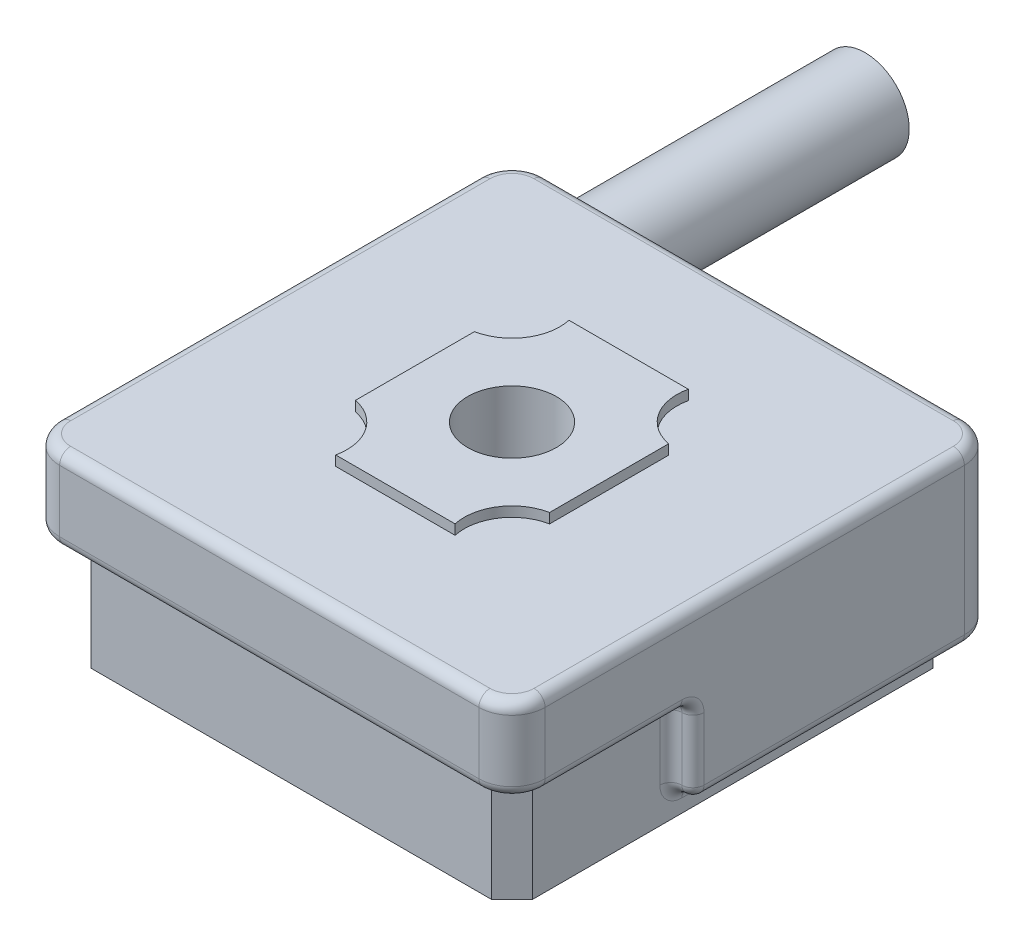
ISO-10303-21;
HEADER;
FILE_DESCRIPTION(('STEP AP214'),'2;1');
FILE_NAME('part.step','',(''),(''),'','','');
FILE_SCHEMA(('AUTOMOTIVE_DESIGN { 1 0 10303 214 1 1 1 1 }'));
ENDSEC;
DATA;
#1=APPLICATION_CONTEXT('core data for automotive mechanical design processes');
#2=APPLICATION_PROTOCOL_DEFINITION('international standard','automotive_design',2000,#1);
#3=PRODUCT_CONTEXT('',#1,'mechanical');
#4=PRODUCT('Part','Part','',(#3));
#5=PRODUCT_RELATED_PRODUCT_CATEGORY('part','',(#4));
#6=PRODUCT_DEFINITION_FORMATION('','',#4);
#7=PRODUCT_DEFINITION_CONTEXT('part definition',#1,'design');
#8=PRODUCT_DEFINITION('design','',#6,#7);
#9=PRODUCT_DEFINITION_SHAPE('','',#8);
#10=(LENGTH_UNIT() NAMED_UNIT(*) SI_UNIT(.MILLI.,.METRE.));
#11=(NAMED_UNIT(*) PLANE_ANGLE_UNIT() SI_UNIT($,.RADIAN.));
#12=(NAMED_UNIT(*) SI_UNIT($,.STERADIAN.) SOLID_ANGLE_UNIT());
#13=UNCERTAINTY_MEASURE_WITH_UNIT(LENGTH_MEASURE(1.E-05),#10,'distance_accuracy_value','');
#14=(GEOMETRIC_REPRESENTATION_CONTEXT(3) GLOBAL_UNCERTAINTY_ASSIGNED_CONTEXT((#13)) GLOBAL_UNIT_ASSIGNED_CONTEXT((#10,
#11,#12)) REPRESENTATION_CONTEXT('',''));
#15=CARTESIAN_POINT('',(0.,0.,0.));
#16=DIRECTION('',(0.,0.,1.));
#17=DIRECTION('',(1.,0.,0.));
#18=AXIS2_PLACEMENT_3D('',#15,#16,#17);
#19=CARTESIAN_POINT('',(-27.94,11.938,-68.58));
#20=DIRECTION('',(0.,0.,1.));
#21=DIRECTION('',(1.,0.,0.));
#22=AXIS2_PLACEMENT_3D('',#19,#20,#21);
#23=PLANE('',#22);
#24=CARTESIAN_POINT('',(-27.94,6.858,-68.58));
#25=DIRECTION('',(0.,0.,-1.));
#26=DIRECTION('',(-1.,0.,0.));
#27=AXIS2_PLACEMENT_3D('',#24,#25,#26);
#28=CIRCLE('',#27,5.08);
#29=CARTESIAN_POINT('',(-33.02,6.858,-68.58));
#30=VERTEX_POINT('',#29);
#31=EDGE_CURVE('E1433',#30,#30,#28,.F.);
#32=ORIENTED_EDGE('',*,*,#31,.F.);
#33=EDGE_LOOP('',(#32));
#34=FACE_BOUND('',#33,.T.);
#35=ADVANCED_FACE('F17',(#34),#23,.F.);
#36=CARTESIAN_POINT('',(-27.94,6.858,-68.58));
#37=DIRECTION('',(0.,0.,-1.));
#38=DIRECTION('',(-1.,0.,0.));
#39=AXIS2_PLACEMENT_3D('',#36,#37,#38);
#40=CYLINDRICAL_SURFACE('',#39,5.08);
#41=ORIENTED_EDGE('',*,*,#31,.T.);
#42=EDGE_LOOP('',(#41));
#43=FACE_BOUND('',#42,.T.);
#44=CARTESIAN_POINT('',(-27.94,6.858,-37.2064788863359));
#45=DIRECTION('',(0.,0.,1.));
#46=DIRECTION('',(1.,0.,0.));
#47=AXIS2_PLACEMENT_3D('',#44,#45,#46);
#48=CIRCLE('',#47,5.08);
#49=CARTESIAN_POINT('',(-22.86,6.858,-37.2064788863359));
#50=VERTEX_POINT('',#49);
#51=EDGE_CURVE('E1432',#50,#50,#48,.T.);
#52=ORIENTED_EDGE('',*,*,#51,.F.);
#53=EDGE_LOOP('',(#52));
#54=FACE_BOUND('',#53,.T.);
#55=ADVANCED_FACE('F228',(#43,#54),#40,.T.);
#56=CARTESIAN_POINT('',(-25.4,9.652,8.3312));
#57=DIRECTION('',(0.,-1.,0.));
#58=DIRECTION('',(0.,0.,-1.));
#59=AXIS2_PLACEMENT_3D('',#56,#57,#58);
#60=PLANE('',#59);
#61=CARTESIAN_POINT('',(17.4625,9.652,17.4625));
#62=DIRECTION('',(0.,-1.,0.));
#63=DIRECTION('',(0.,0.,-1.));
#64=AXIS2_PLACEMENT_3D('',#61,#62,#63);
#65=CIRCLE('',#64,3.4036);
#66=CARTESIAN_POINT('',(17.4625,9.652,14.0589));
#67=VERTEX_POINT('',#66);
#68=EDGE_CURVE('E1430',#67,#67,#65,.T.);
#69=ORIENTED_EDGE('',*,*,#68,.T.);
#70=EDGE_LOOP('',(#69));
#71=FACE_BOUND('',#70,.T.);
#72=ADVANCED_FACE('F225',(#71),#60,.T.);
#73=CARTESIAN_POINT('',(-25.4,9.652,8.3312));
#74=DIRECTION('',(0.,-1.,0.));
#75=DIRECTION('',(0.,0.,-1.));
#76=AXIS2_PLACEMENT_3D('',#73,#74,#75);
#77=PLANE('',#76);
#78=CARTESIAN_POINT('',(-17.4625,9.652,17.4625));
#79=DIRECTION('',(0.,-1.,0.));
#80=DIRECTION('',(0.,0.,-1.));
#81=AXIS2_PLACEMENT_3D('',#78,#79,#80);
#82=CIRCLE('',#81,3.4036);
#83=CARTESIAN_POINT('',(-17.4625,9.652,14.0589));
#84=VERTEX_POINT('',#83);
#85=EDGE_CURVE('E1427',#84,#84,#82,.T.);
#86=ORIENTED_EDGE('',*,*,#85,.T.);
#87=EDGE_LOOP('',(#86));
#88=FACE_BOUND('',#87,.T.);
#89=ADVANCED_FACE('F221',(#88),#77,.T.);
#90=CARTESIAN_POINT('',(-25.4,9.652,8.3312));
#91=DIRECTION('',(0.,-1.,0.));
#92=DIRECTION('',(0.,0.,-1.));
#93=AXIS2_PLACEMENT_3D('',#90,#91,#92);
#94=PLANE('',#93);
#95=CARTESIAN_POINT('',(-17.4625,9.652,-17.4625));
#96=DIRECTION('',(0.,-1.,0.));
#97=DIRECTION('',(0.,0.,-1.));
#98=AXIS2_PLACEMENT_3D('',#95,#96,#97);
#99=CIRCLE('',#98,3.4036);
#100=CARTESIAN_POINT('',(-17.4625,9.652,-20.8661));
#101=VERTEX_POINT('',#100);
#102=EDGE_CURVE('E1424',#101,#101,#99,.T.);
#103=ORIENTED_EDGE('',*,*,#102,.T.);
#104=EDGE_LOOP('',(#103));
#105=FACE_BOUND('',#104,.T.);
#106=ADVANCED_FACE('F217',(#105),#94,.T.);
#107=CARTESIAN_POINT('',(-25.4,9.652,8.3312));
#108=DIRECTION('',(0.,-1.,0.));
#109=DIRECTION('',(0.,0.,-1.));
#110=AXIS2_PLACEMENT_3D('',#107,#108,#109);
#111=PLANE('',#110);
#112=CARTESIAN_POINT('',(17.4625,9.652,-17.4625));
#113=DIRECTION('',(0.,-1.,0.));
#114=DIRECTION('',(0.,0.,-1.));
#115=AXIS2_PLACEMENT_3D('',#112,#113,#114);
#116=CIRCLE('',#115,3.4036);
#117=CARTESIAN_POINT('',(17.4625,9.652,-20.8661));
#118=VERTEX_POINT('',#117);
#119=EDGE_CURVE('E190',#118,#118,#116,.T.);
#120=ORIENTED_EDGE('',*,*,#119,.T.);
#121=EDGE_LOOP('',(#120));
#122=FACE_BOUND('',#121,.T.);
#123=ADVANCED_FACE('F213',(#122),#111,.T.);
#124=CARTESIAN_POINT('',(0.,1.27,0.));
#125=DIRECTION('',(0.,1.,0.));
#126=DIRECTION('',(0.,0.,1.));
#127=AXIS2_PLACEMENT_3D('',#124,#125,#126);
#128=PLANE('',#127);
#129=CARTESIAN_POINT('',(0.,1.27,0.));
#130=DIRECTION('',(0.,-1.,0.));
#131=DIRECTION('',(0.,0.,-1.));
#132=AXIS2_PLACEMENT_3D('',#129,#130,#131);
#133=CIRCLE('',#132,11.90625);
#134=CARTESIAN_POINT('',(0.,1.27,-11.90625));
#135=VERTEX_POINT('',#134);
#136=EDGE_CURVE('E180',#135,#135,#133,.F.);
#137=ORIENTED_EDGE('',*,*,#136,.T.);
#138=EDGE_LOOP('',(#137));
#139=FACE_BOUND('',#138,.T.);
#140=CARTESIAN_POINT('',(0.,1.27,0.));
#141=DIRECTION('',(0.,-1.,0.));
#142=DIRECTION('',(0.,0.,-1.));
#143=AXIS2_PLACEMENT_3D('',#140,#141,#142);
#144=CIRCLE('',#143,14.224);
#145=CARTESIAN_POINT('',(0.,1.27,-14.224));
#146=VERTEX_POINT('',#145);
#147=EDGE_CURVE('E187',#146,#146,#144,.T.);
#148=ORIENTED_EDGE('',*,*,#147,.T.);
#149=EDGE_LOOP('',(#148));
#150=FACE_BOUND('',#149,.T.);
#151=ADVANCED_FACE('F210',(#139,#150),#128,.F.);
#152=CARTESIAN_POINT('',(-25.4,9.652,8.3312));
#153=DIRECTION('',(0.,-1.,0.));
#154=DIRECTION('',(0.,0.,-1.));
#155=AXIS2_PLACEMENT_3D('',#152,#153,#154);
#156=PLANE('',#155);
#157=DIRECTION('',(1.,0.,0.));
#158=VECTOR('',#157,1.);
#159=CARTESIAN_POINT('',(27.94,9.65199999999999,7.11199999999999));
#160=LINE('',#159,#158);
#161=CARTESIAN_POINT('',(9.5487300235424,9.652,7.112));
#162=VERTEX_POINT('',#161);
#163=CARTESIAN_POINT('',(-9.5487300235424,9.652,7.112));
#164=VERTEX_POINT('',#163);
#165=EDGE_CURVE('E166',#162,#164,#160,.F.);
#166=ORIENTED_EDGE('',*,*,#165,.F.);
#167=CARTESIAN_POINT('',(0.,9.652,0.));
#168=DIRECTION('',(0.,-1.,0.));
#169=DIRECTION('',(0.,0.,-1.));
#170=AXIS2_PLACEMENT_3D('',#167,#168,#169);
#171=CIRCLE('',#170,11.90625);
#172=EDGE_CURVE('E172',#162,#164,#171,.T.);
#173=ORIENTED_EDGE('',*,*,#172,.T.);
#174=EDGE_LOOP('',(#166,#173));
#175=FACE_BOUND('',#174,.T.);
#176=ADVANCED_FACE('F182',(#175),#156,.T.);
#177=CARTESIAN_POINT('',(-27.94,6.858,-37.2064788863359));
#178=DIRECTION('',(0.,0.,1.));
#179=DIRECTION('',(1.,0.,0.));
#180=AXIS2_PLACEMENT_3D('',#177,#178,#179);
#181=TOROIDAL_SURFACE('',#180,3.81,1.27);
#182=CARTESIAN_POINT('',(-27.94,6.858,-36.5143436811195));
#183=DIRECTION('',(0.,0.,-1.));
#184=DIRECTION('',(-1.,0.,0.));
#185=AXIS2_PLACEMENT_3D('',#182,#183,#184);
#186=CIRCLE('',#185,4.87482339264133);
#187=CARTESIAN_POINT('',(-32.8148233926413,6.858,-36.5143436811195));
#188=VERTEX_POINT('',#187);
#189=EDGE_CURVE('E179',#188,#188,#186,.F.);
#190=ORIENTED_EDGE('',*,*,#189,.F.);
#191=EDGE_LOOP('',(#190));
#192=FACE_BOUND('',#191,.T.);
#193=ORIENTED_EDGE('',*,*,#51,.T.);
#194=EDGE_LOOP('',(#193));
#195=FACE_BOUND('',#194,.T.);
#196=ADVANCED_FACE('F201',(#192,#195),#181,.T.);
#197=CARTESIAN_POINT('',(17.4625,0.,17.4625));
#198=DIRECTION('',(0.,-1.,0.));
#199=DIRECTION('',(0.,0.,-1.));
#200=AXIS2_PLACEMENT_3D('',#197,#198,#199);
#201=CYLINDRICAL_SURFACE('',#200,3.4036);
#202=CARTESIAN_POINT('',(17.4625,0.,17.4625));
#203=DIRECTION('',(0.,-1.,0.));
#204=DIRECTION('',(0.,0.,-1.));
#205=AXIS2_PLACEMENT_3D('',#202,#203,#204);
#206=CIRCLE('',#205,3.4036);
#207=CARTESIAN_POINT('',(17.4625,0.,14.0589));
#208=VERTEX_POINT('',#207);
#209=EDGE_CURVE('E1416',#208,#208,#206,.F.);
#210=ORIENTED_EDGE('',*,*,#209,.F.);
#211=EDGE_LOOP('',(#210));
#212=FACE_BOUND('',#211,.T.);
#213=ORIENTED_EDGE('',*,*,#68,.F.);
#214=EDGE_LOOP('',(#213));
#215=FACE_BOUND('',#214,.T.);
#216=ADVANCED_FACE('F205',(#212,#215),#201,.F.);
#217=CARTESIAN_POINT('',(-17.4625,0.,17.4625));
#218=DIRECTION('',(0.,-1.,0.));
#219=DIRECTION('',(0.,0.,-1.));
#220=AXIS2_PLACEMENT_3D('',#217,#218,#219);
#221=CYLINDRICAL_SURFACE('',#220,3.4036);
#222=CARTESIAN_POINT('',(-17.4625,0.,17.4625));
#223=DIRECTION('',(0.,-1.,0.));
#224=DIRECTION('',(0.,0.,-1.));
#225=AXIS2_PLACEMENT_3D('',#222,#223,#224);
#226=CIRCLE('',#225,3.4036);
#227=CARTESIAN_POINT('',(-17.4625,0.,14.0589));
#228=VERTEX_POINT('',#227);
#229=EDGE_CURVE('E1413',#228,#228,#226,.F.);
#230=ORIENTED_EDGE('',*,*,#229,.F.);
#231=EDGE_LOOP('',(#230));
#232=FACE_BOUND('',#231,.T.);
#233=ORIENTED_EDGE('',*,*,#85,.F.);
#234=EDGE_LOOP('',(#233));
#235=FACE_BOUND('',#234,.T.);
#236=ADVANCED_FACE('F2173',(#232,#235),#221,.F.);
#237=CARTESIAN_POINT('',(-17.4625,0.,-17.4625));
#238=DIRECTION('',(0.,-1.,0.));
#239=DIRECTION('',(0.,0.,-1.));
#240=AXIS2_PLACEMENT_3D('',#237,#238,#239);
#241=CYLINDRICAL_SURFACE('',#240,3.4036);
#242=CARTESIAN_POINT('',(-17.4625,0.,-17.4625));
#243=DIRECTION('',(0.,-1.,0.));
#244=DIRECTION('',(0.,0.,-1.));
#245=AXIS2_PLACEMENT_3D('',#242,#243,#244);
#246=CIRCLE('',#245,3.4036);
#247=CARTESIAN_POINT('',(-17.4625,0.,-20.8661));
#248=VERTEX_POINT('',#247);
#249=EDGE_CURVE('E1410',#248,#248,#246,.F.);
#250=ORIENTED_EDGE('',*,*,#249,.F.);
#251=EDGE_LOOP('',(#250));
#252=FACE_BOUND('',#251,.T.);
#253=ORIENTED_EDGE('',*,*,#102,.F.);
#254=EDGE_LOOP('',(#253));
#255=FACE_BOUND('',#254,.T.);
#256=ADVANCED_FACE('F2164',(#252,#255),#241,.F.);
#257=CARTESIAN_POINT('',(17.4625,0.,-17.4625));
#258=DIRECTION('',(0.,-1.,0.));
#259=DIRECTION('',(0.,0.,-1.));
#260=AXIS2_PLACEMENT_3D('',#257,#258,#259);
#261=CYLINDRICAL_SURFACE('',#260,3.4036);
#262=CARTESIAN_POINT('',(17.4625,0.,-17.4625));
#263=DIRECTION('',(0.,-1.,0.));
#264=DIRECTION('',(0.,0.,-1.));
#265=AXIS2_PLACEMENT_3D('',#262,#263,#264);
#266=CIRCLE('',#265,3.4036);
#267=CARTESIAN_POINT('',(17.4625,0.,-20.8661));
#268=VERTEX_POINT('',#267);
#269=EDGE_CURVE('E1407',#268,#268,#266,.F.);
#270=ORIENTED_EDGE('',*,*,#269,.F.);
#271=EDGE_LOOP('',(#270));
#272=FACE_BOUND('',#271,.T.);
#273=ORIENTED_EDGE('',*,*,#119,.F.);
#274=EDGE_LOOP('',(#273));
#275=FACE_BOUND('',#274,.T.);
#276=ADVANCED_FACE('F2155',(#272,#275),#261,.F.);
#277=CARTESIAN_POINT('',(0.,1.27,0.));
#278=DIRECTION('',(0.,-1.,0.));
#279=DIRECTION('',(0.,0.,-1.));
#280=AXIS2_PLACEMENT_3D('',#277,#278,#279);
#281=CYLINDRICAL_SURFACE('',#280,14.224);
#282=ORIENTED_EDGE('',*,*,#147,.F.);
#283=EDGE_LOOP('',(#282));
#284=FACE_BOUND('',#283,.T.);
#285=CARTESIAN_POINT('',(0.,0.,0.));
#286=DIRECTION('',(0.,-1.,0.));
#287=DIRECTION('',(0.,0.,-1.));
#288=AXIS2_PLACEMENT_3D('',#285,#286,#287);
#289=CIRCLE('',#288,14.224);
#290=CARTESIAN_POINT('',(0.,0.,-14.224));
#291=VERTEX_POINT('',#290);
#292=EDGE_CURVE('E1404',#291,#291,#289,.F.);
#293=ORIENTED_EDGE('',*,*,#292,.F.);
#294=EDGE_LOOP('',(#293));
#295=FACE_BOUND('',#294,.T.);
#296=ADVANCED_FACE('F2147',(#284,#295),#281,.F.);
#297=CARTESIAN_POINT('',(27.94,-65.9637559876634,7.11199999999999));
#298=DIRECTION('',(0.,0.,1.));
#299=DIRECTION('',(1.,0.,0.));
#300=AXIS2_PLACEMENT_3D('',#297,#298,#299);
#301=PLANE('',#300);
#302=DIRECTION('',(0.,1.,0.));
#303=VECTOR('',#302,1.);
#304=CARTESIAN_POINT('',(9.5487300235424,-65.9637559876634,7.112));
#305=LINE('',#304,#303);
#306=CARTESIAN_POINT('',(9.5487300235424,2.794,7.112));
#307=VERTEX_POINT('',#306);
#308=EDGE_CURVE('E175',#307,#162,#305,.T.);
#309=ORIENTED_EDGE('',*,*,#308,.T.);
#310=ORIENTED_EDGE('',*,*,#165,.T.);
#311=DIRECTION('',(0.,-1.,0.));
#312=VECTOR('',#311,1.);
#313=CARTESIAN_POINT('',(-9.5487300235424,0.,7.11199999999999));
#314=LINE('',#313,#312);
#315=CARTESIAN_POINT('',(-9.5487300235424,2.794,7.11199999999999));
#316=VERTEX_POINT('',#315);
#317=EDGE_CURVE('E177',#164,#316,#314,.T.);
#318=ORIENTED_EDGE('',*,*,#317,.T.);
#319=DIRECTION('',(1.,0.,0.));
#320=VECTOR('',#319,1.);
#321=CARTESIAN_POINT('',(0.,2.794,7.112));
#322=LINE('',#321,#320);
#323=EDGE_CURVE('E186',#307,#316,#322,.F.);
#324=ORIENTED_EDGE('',*,*,#323,.F.);
#325=EDGE_LOOP('',(#309,#310,#318,#324));
#326=FACE_BOUND('',#325,.T.);
#327=ADVANCED_FACE('F184',(#326),#301,.T.);
#328=CARTESIAN_POINT('',(0.,0.,0.));
#329=DIRECTION('',(0.,-1.,0.));
#330=DIRECTION('',(0.,0.,-1.));
#331=AXIS2_PLACEMENT_3D('',#328,#329,#330);
#332=CYLINDRICAL_SURFACE('',#331,11.90625);
#333=ORIENTED_EDGE('',*,*,#136,.F.);
#334=EDGE_LOOP('',(#333));
#335=FACE_BOUND('',#334,.T.);
#336=ORIENTED_EDGE('',*,*,#172,.F.);
#337=ORIENTED_EDGE('',*,*,#308,.F.);
#338=CARTESIAN_POINT('',(0.,2.794,0.));
#339=DIRECTION('',(0.,-1.,0.));
#340=DIRECTION('',(0.,0.,-1.));
#341=AXIS2_PLACEMENT_3D('',#338,#339,#340);
#342=CIRCLE('',#341,11.90625);
#343=EDGE_CURVE('E1401',#316,#307,#342,.T.);
#344=ORIENTED_EDGE('',*,*,#343,.F.);
#345=ORIENTED_EDGE('',*,*,#317,.F.);
#346=EDGE_LOOP('',(#336,#337,#344,#345));
#347=FACE_BOUND('',#346,.T.);
#348=ADVANCED_FACE('F173',(#335,#347),#332,.F.);
#349=CARTESIAN_POINT('',(23.0378,23.368,25.4));
#350=DIRECTION('',(-0.707106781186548,0.,-0.707106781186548));
#351=DIRECTION('',(-0.707106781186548,0.,0.707106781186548));
#352=AXIS2_PLACEMENT_3D('',#349,#350,#351);
#353=PLANE('',#352);
#354=DIRECTION('',(0.707106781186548,0.,-0.707106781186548));
#355=VECTOR('',#354,1.);
#356=CARTESIAN_POINT('',(23.0378,11.303,25.4));
#357=LINE('',#356,#355);
#358=CARTESIAN_POINT('',(25.4,11.303,23.0378));
#359=VERTEX_POINT('',#358);
#360=CARTESIAN_POINT('',(23.0378,11.303,25.4));
#361=VERTEX_POINT('',#360);
#362=EDGE_CURVE('E2592',#359,#361,#357,.F.);
#363=ORIENTED_EDGE('',*,*,#362,.T.);
#364=DIRECTION('',(0.,1.,0.));
#365=VECTOR('',#364,1.);
#366=CARTESIAN_POINT('',(23.0378,23.368,25.4));
#367=LINE('',#366,#365);
#368=CARTESIAN_POINT('',(23.0378,0.,25.4));
#369=VERTEX_POINT('',#368);
#370=EDGE_CURVE('E2922',#361,#369,#367,.F.);
#371=ORIENTED_EDGE('',*,*,#370,.T.);
#372=DIRECTION('',(-0.707106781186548,0.,0.707106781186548));
#373=VECTOR('',#372,1.);
#374=CARTESIAN_POINT('',(25.4,0.,23.0378));
#375=LINE('',#374,#373);
#376=CARTESIAN_POINT('',(25.4,0.,23.0378));
#377=VERTEX_POINT('',#376);
#378=EDGE_CURVE('E2380',#377,#369,#375,.T.);
#379=ORIENTED_EDGE('',*,*,#378,.F.);
#380=DIRECTION('',(0.,1.,0.));
#381=VECTOR('',#380,1.);
#382=CARTESIAN_POINT('',(25.4,23.368,23.0378));
#383=LINE('',#382,#381);
#384=EDGE_CURVE('E2873',#377,#359,#383,.T.);
#385=ORIENTED_EDGE('',*,*,#384,.T.);
#386=EDGE_LOOP('',(#363,#371,#379,#385));
#387=FACE_BOUND('',#386,.T.);
#388=ADVANCED_FACE('F2122',(#387),#353,.F.);
#389=CARTESIAN_POINT('',(23.0378,23.368,-25.4));
#390=DIRECTION('',(-0.707106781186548,0.,0.707106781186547));
#391=DIRECTION('',(0.707106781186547,0.,0.707106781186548));
#392=AXIS2_PLACEMENT_3D('',#389,#390,#391);
#393=PLANE('',#392);
#394=DIRECTION('',(0.707106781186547,0.,0.707106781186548));
#395=VECTOR('',#394,1.);
#396=CARTESIAN_POINT('',(23.0378,1.524,-25.4));
#397=LINE('',#396,#395);
#398=CARTESIAN_POINT('',(23.0378,1.524,-25.4));
#399=VERTEX_POINT('',#398);
#400=CARTESIAN_POINT('',(25.4,1.524,-23.0378));
#401=VERTEX_POINT('',#400);
#402=EDGE_CURVE('E2388',#399,#401,#397,.T.);
#403=ORIENTED_EDGE('',*,*,#402,.T.);
#404=DIRECTION('',(0.,1.,0.));
#405=VECTOR('',#404,1.);
#406=CARTESIAN_POINT('',(25.4,23.368,-23.0378));
#407=LINE('',#406,#405);
#408=CARTESIAN_POINT('',(25.4,0.,-23.0378));
#409=VERTEX_POINT('',#408);
#410=EDGE_CURVE('E2377',#401,#409,#407,.F.);
#411=ORIENTED_EDGE('',*,*,#410,.T.);
#412=DIRECTION('',(0.707106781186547,0.,0.707106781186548));
#413=VECTOR('',#412,1.);
#414=CARTESIAN_POINT('',(23.0378,0.,-25.4));
#415=LINE('',#414,#413);
#416=CARTESIAN_POINT('',(23.0378,0.,-25.4));
#417=VERTEX_POINT('',#416);
#418=EDGE_CURVE('E197',#417,#409,#415,.T.);
#419=ORIENTED_EDGE('',*,*,#418,.F.);
#420=DIRECTION('',(0.,1.,0.));
#421=VECTOR('',#420,1.);
#422=CARTESIAN_POINT('',(23.0378,23.368,-25.4));
#423=LINE('',#422,#421);
#424=EDGE_CURVE('E2374',#417,#399,#423,.T.);
#425=ORIENTED_EDGE('',*,*,#424,.T.);
#426=EDGE_LOOP('',(#403,#411,#419,#425));
#427=FACE_BOUND('',#426,.T.);
#428=ADVANCED_FACE('F2113',(#427),#393,.F.);
#429=CARTESIAN_POINT('',(-27.94,6.858,-36.5143436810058));
#430=DIRECTION('',(0.,0.,-1.));
#431=DIRECTION('',(-1.,0.,0.));
#432=AXIS2_PLACEMENT_3D('',#429,#430,#431);
#433=CONICAL_SURFACE('',#432,4.87482339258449,0.57637522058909);
#434=ORIENTED_EDGE('',*,*,#189,.T.);
#435=EDGE_LOOP('',(#434));
#436=FACE_BOUND('',#435,.T.);
#437=CARTESIAN_POINT('',(-27.94,6.858,-34.6056563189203));
#438=DIRECTION('',(0.,0.,-1.));
#439=DIRECTION('',(-1.,0.,0.));
#440=AXIS2_PLACEMENT_3D('',#437,#438,#439);
#441=CIRCLE('',#440,3.63417660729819);
#442=CARTESIAN_POINT('',(-31.5741766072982,6.858,-34.6056563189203));
#443=VERTEX_POINT('',#442);
#444=EDGE_CURVE('E2401',#443,#443,#441,.T.);
#445=ORIENTED_EDGE('',*,*,#444,.T.);
#446=EDGE_LOOP('',(#445));
#447=FACE_BOUND('',#446,.T.);
#448=ADVANCED_FACE('F2104',(#436,#447),#433,.T.);
#449=CARTESIAN_POINT('',(-25.4,23.368,23.0378));
#450=DIRECTION('',(0.707106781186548,0.,-0.707106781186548));
#451=DIRECTION('',(-0.707106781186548,0.,-0.707106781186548));
#452=AXIS2_PLACEMENT_3D('',#449,#450,#451);
#453=PLANE('',#452);
#454=DIRECTION('',(0.707106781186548,0.,0.707106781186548));
#455=VECTOR('',#454,1.);
#456=CARTESIAN_POINT('',(-25.4,11.303,23.0378));
#457=LINE('',#456,#455);
#458=CARTESIAN_POINT('',(-23.0378,11.303,25.4));
#459=VERTEX_POINT('',#458);
#460=CARTESIAN_POINT('',(-25.4,11.303,23.0378));
#461=VERTEX_POINT('',#460);
#462=EDGE_CURVE('E2605',#459,#461,#457,.F.);
#463=ORIENTED_EDGE('',*,*,#462,.T.);
#464=DIRECTION('',(0.,1.,0.));
#465=VECTOR('',#464,1.);
#466=CARTESIAN_POINT('',(-25.4,23.368,23.0378));
#467=LINE('',#466,#465);
#468=CARTESIAN_POINT('',(-25.4,0.,23.0378));
#469=VERTEX_POINT('',#468);
#470=EDGE_CURVE('E2310',#461,#469,#467,.F.);
#471=ORIENTED_EDGE('',*,*,#470,.T.);
#472=DIRECTION('',(-0.707106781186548,0.,-0.707106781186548));
#473=VECTOR('',#472,1.);
#474=CARTESIAN_POINT('',(-23.0378,0.,25.4));
#475=LINE('',#474,#473);
#476=CARTESIAN_POINT('',(-23.0378,0.,25.4));
#477=VERTEX_POINT('',#476);
#478=EDGE_CURVE('E1418',#477,#469,#475,.T.);
#479=ORIENTED_EDGE('',*,*,#478,.F.);
#480=DIRECTION('',(0.,1.,0.));
#481=VECTOR('',#480,1.);
#482=CARTESIAN_POINT('',(-23.0378,23.368,25.4));
#483=LINE('',#482,#481);
#484=EDGE_CURVE('E2925',#477,#459,#483,.T.);
#485=ORIENTED_EDGE('',*,*,#484,.T.);
#486=EDGE_LOOP('',(#463,#471,#479,#485));
#487=FACE_BOUND('',#486,.T.);
#488=ADVANCED_FACE('F2095',(#487),#453,.F.);
#489=CARTESIAN_POINT('',(0.,0.,0.));
#490=DIRECTION('',(0.,-1.,0.));
#491=DIRECTION('',(0.,0.,-1.));
#492=AXIS2_PLACEMENT_3D('',#489,#490,#491);
#493=PLANE('',#492);
#494=ORIENTED_EDGE('',*,*,#292,.T.);
#495=EDGE_LOOP('',(#494));
#496=FACE_BOUND('',#495,.T.);
#497=ORIENTED_EDGE('',*,*,#269,.T.);
#498=EDGE_LOOP('',(#497));
#499=FACE_BOUND('',#498,.T.);
#500=ORIENTED_EDGE('',*,*,#249,.T.);
#501=EDGE_LOOP('',(#500));
#502=FACE_BOUND('',#501,.T.);
#503=ORIENTED_EDGE('',*,*,#229,.T.);
#504=EDGE_LOOP('',(#503));
#505=FACE_BOUND('',#504,.T.);
#506=ORIENTED_EDGE('',*,*,#209,.T.);
#507=EDGE_LOOP('',(#506));
#508=FACE_BOUND('',#507,.T.);
#509=DIRECTION('',(0.,0.,-1.));
#510=VECTOR('',#509,1.);
#511=CARTESIAN_POINT('',(-25.4,0.,-23.0378));
#512=LINE('',#511,#510);
#513=CARTESIAN_POINT('',(-25.4,0.,-23.0378));
#514=VERTEX_POINT('',#513);
#515=EDGE_CURVE('E1166',#469,#514,#512,.T.);
#516=ORIENTED_EDGE('',*,*,#515,.T.);
#517=DIRECTION('',(0.707106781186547,0.,-0.707106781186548));
#518=VECTOR('',#517,1.);
#519=CARTESIAN_POINT('',(-25.4,0.,-23.0378));
#520=LINE('',#519,#518);
#521=CARTESIAN_POINT('',(-23.0378,0.,-25.4));
#522=VERTEX_POINT('',#521);
#523=EDGE_CURVE('E1124',#514,#522,#520,.T.);
#524=ORIENTED_EDGE('',*,*,#523,.T.);
#525=DIRECTION('',(1.,0.,0.));
#526=VECTOR('',#525,1.);
#527=CARTESIAN_POINT('',(-23.0378,0.,-25.4));
#528=LINE('',#527,#526);
#529=EDGE_CURVE('E2382',#522,#417,#528,.T.);
#530=ORIENTED_EDGE('',*,*,#529,.T.);
#531=ORIENTED_EDGE('',*,*,#418,.T.);
#532=DIRECTION('',(0.,0.,1.));
#533=VECTOR('',#532,1.);
#534=CARTESIAN_POINT('',(25.4,0.,-23.0378));
#535=LINE('',#534,#533);
#536=EDGE_CURVE('E2908',#409,#377,#535,.T.);
#537=ORIENTED_EDGE('',*,*,#536,.T.);
#538=ORIENTED_EDGE('',*,*,#378,.T.);
#539=DIRECTION('',(-1.,0.,0.));
#540=VECTOR('',#539,1.);
#541=CARTESIAN_POINT('',(-23.0378,0.,25.4));
#542=LINE('',#541,#540);
#543=EDGE_CURVE('E1403',#369,#477,#542,.T.);
#544=ORIENTED_EDGE('',*,*,#543,.T.);
#545=ORIENTED_EDGE('',*,*,#478,.T.);
#546=EDGE_LOOP('',(#516,#524,#530,#531,#537,#538,#544,#545));
#547=FACE_BOUND('',#546,.T.);
#548=ADVANCED_FACE('F2086',(#496,#499,#502,#505,#508,#547),#493,.T.);
#549=CARTESIAN_POINT('',(-25.4,23.368,-23.0378));
#550=DIRECTION('',(0.707106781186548,0.,0.707106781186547));
#551=DIRECTION('',(0.707106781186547,0.,-0.707106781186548));
#552=AXIS2_PLACEMENT_3D('',#549,#550,#551);
#553=PLANE('',#552);
#554=DIRECTION('',(0.707106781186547,0.,-0.707106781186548));
#555=VECTOR('',#554,1.);
#556=CARTESIAN_POINT('',(-25.4,1.524,-23.0378));
#557=LINE('',#556,#555);
#558=CARTESIAN_POINT('',(-25.4,1.524,-23.0378));
#559=VERTEX_POINT('',#558);
#560=CARTESIAN_POINT('',(-23.0378,1.524,-25.4));
#561=VERTEX_POINT('',#560);
#562=EDGE_CURVE('E1148',#559,#561,#557,.T.);
#563=ORIENTED_EDGE('',*,*,#562,.T.);
#564=DIRECTION('',(0.,1.,0.));
#565=VECTOR('',#564,1.);
#566=CARTESIAN_POINT('',(-23.0378,23.368,-25.4));
#567=LINE('',#566,#565);
#568=EDGE_CURVE('E2313',#561,#522,#567,.F.);
#569=ORIENTED_EDGE('',*,*,#568,.T.);
#570=ORIENTED_EDGE('',*,*,#523,.F.);
#571=DIRECTION('',(0.,1.,0.));
#572=VECTOR('',#571,1.);
#573=CARTESIAN_POINT('',(-25.4,23.368,-23.0378));
#574=LINE('',#573,#572);
#575=EDGE_CURVE('E1153',#514,#559,#574,.T.);
#576=ORIENTED_EDGE('',*,*,#575,.T.);
#577=EDGE_LOOP('',(#563,#569,#570,#576));
#578=FACE_BOUND('',#577,.T.);
#579=ADVANCED_FACE('F2077',(#578),#553,.F.);
#580=CARTESIAN_POINT('',(0.,2.794,0.));
#581=DIRECTION('',(0.,-1.,0.));
#582=DIRECTION('',(0.,0.,-1.));
#583=AXIS2_PLACEMENT_3D('',#580,#581,#582);
#584=PLANE('',#583);
#585=ORIENTED_EDGE('',*,*,#323,.T.);
#586=ORIENTED_EDGE('',*,*,#343,.T.);
#587=EDGE_LOOP('',(#585,#586));
#588=FACE_BOUND('',#587,.T.);
#589=CARTESIAN_POINT('',(0.,2.794,0.));
#590=DIRECTION('',(0.,1.,0.));
#591=DIRECTION('',(0.,0.,1.));
#592=AXIS2_PLACEMENT_3D('',#589,#590,#591);
#593=CIRCLE('',#592,6.985);
#594=CARTESIAN_POINT('',(0.,2.794,6.985));
#595=VERTEX_POINT('',#594);
#596=EDGE_CURVE('E1396',#595,#595,#593,.T.);
#597=ORIENTED_EDGE('',*,*,#596,.T.);
#598=EDGE_LOOP('',(#597));
#599=FACE_BOUND('',#598,.T.);
#600=ADVANCED_FACE('F2068',(#588,#599),#584,.T.);
#601=CARTESIAN_POINT('',(-23.0378,23.368,25.4));
#602=DIRECTION('',(0.,0.,-1.));
#603=DIRECTION('',(-1.,0.,0.));
#604=AXIS2_PLACEMENT_3D('',#601,#602,#603);
#605=PLANE('',#604);
#606=DIRECTION('',(1.,0.,0.));
#607=VECTOR('',#606,1.);
#608=CARTESIAN_POINT('',(-23.0378,11.303,25.4));
#609=LINE('',#608,#607);
#610=EDGE_CURVE('E1391',#361,#459,#609,.F.);
#611=ORIENTED_EDGE('',*,*,#610,.T.);
#612=ORIENTED_EDGE('',*,*,#484,.F.);
#613=ORIENTED_EDGE('',*,*,#543,.F.);
#614=ORIENTED_EDGE('',*,*,#370,.F.);
#615=EDGE_LOOP('',(#611,#612,#613,#614));
#616=FACE_BOUND('',#615,.T.);
#617=ADVANCED_FACE('F2059',(#616),#605,.F.);
#618=CARTESIAN_POINT('',(23.9358256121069,11.303,26.2980256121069));
#619=DIRECTION('',(0.707106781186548,0.,-0.707106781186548));
#620=DIRECTION('',(-0.707106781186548,0.,-0.707106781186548));
#621=AXIS2_PLACEMENT_3D('',#618,#619,#620);
#622=CYLINDRICAL_SURFACE('',#621,1.27);
#623=DIRECTION('',(-0.707106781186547,0.,0.707106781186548));
#624=VECTOR('',#623,1.);
#625=CARTESIAN_POINT('',(26.67,12.573,23.5638512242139));
#626=LINE('',#625,#624);
#627=CARTESIAN_POINT('',(26.67,12.573,23.5638512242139));
#628=VERTEX_POINT('',#627);
#629=CARTESIAN_POINT('',(23.5638512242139,12.573,26.67));
#630=VERTEX_POINT('',#629);
#631=EDGE_CURVE('E1387',#628,#630,#626,.T.);
#632=ORIENTED_EDGE('',*,*,#631,.T.);
#633=CARTESIAN_POINT('',(23.5638512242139,11.303,26.67));
#634=DIRECTION('',(0.923879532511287,0.,-0.38268343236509));
#635=DIRECTION('',(-0.38268343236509,0.,-0.923879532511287));
#636=AXIS2_PLACEMENT_3D('',#633,#634,#635);
#637=ELLIPSE('',#636,1.37463809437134,1.27);
#638=EDGE_CURVE('E1388',#630,#361,#637,.F.);
#639=ORIENTED_EDGE('',*,*,#638,.T.);
#640=ORIENTED_EDGE('',*,*,#362,.F.);
#641=CARTESIAN_POINT('',(26.67,11.303,23.5638512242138));
#642=DIRECTION('',(0.38268343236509,0.,-0.923879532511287));
#643=DIRECTION('',(0.923879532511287,0.,0.38268343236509));
#644=AXIS2_PLACEMENT_3D('',#641,#642,#643);
#645=ELLIPSE('',#644,1.37463809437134,1.27);
#646=EDGE_CURVE('E1383',#359,#628,#645,.T.);
#647=ORIENTED_EDGE('',*,*,#646,.T.);
#648=EDGE_LOOP('',(#632,#639,#640,#647));
#649=FACE_BOUND('',#648,.T.);
#650=ADVANCED_FACE('F2050',(#649),#622,.F.);
#651=CARTESIAN_POINT('',(25.4,23.368,-23.0378));
#652=DIRECTION('',(-1.,0.,0.));
#653=DIRECTION('',(0.,0.,1.));
#654=AXIS2_PLACEMENT_3D('',#651,#652,#653);
#655=PLANE('',#654);
#656=DIRECTION('',(0.,0.,1.));
#657=VECTOR('',#656,1.);
#658=CARTESIAN_POINT('',(25.4,1.524,-23.0378));
#659=LINE('',#658,#657);
#660=CARTESIAN_POINT('',(25.4,1.524,5.84199999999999));
#661=VERTEX_POINT('',#660);
#662=EDGE_CURVE('E1381',#401,#661,#659,.T.);
#663=ORIENTED_EDGE('',*,*,#662,.T.);
#664=CARTESIAN_POINT('',(25.4,4.064,5.84199999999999));
#665=DIRECTION('',(1.,0.,0.));
#666=DIRECTION('',(0.,0.,1.));
#667=AXIS2_PLACEMENT_3D('',#664,#665,#666);
#668=CIRCLE('',#667,2.54);
#669=CARTESIAN_POINT('',(25.4,4.064,8.38199999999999));
#670=VERTEX_POINT('',#669);
#671=EDGE_CURVE('E2383',#661,#670,#668,.F.);
#672=ORIENTED_EDGE('',*,*,#671,.T.);
#673=DIRECTION('',(0.,1.,0.));
#674=VECTOR('',#673,1.);
#675=CARTESIAN_POINT('',(25.4,23.368,8.38199999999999));
#676=LINE('',#675,#674);
#677=CARTESIAN_POINT('',(25.4,11.303,8.38199999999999));
#678=VERTEX_POINT('',#677);
#679=EDGE_CURVE('E2875',#670,#678,#676,.T.);
#680=ORIENTED_EDGE('',*,*,#679,.T.);
#681=DIRECTION('',(0.,0.,1.));
#682=VECTOR('',#681,1.);
#683=CARTESIAN_POINT('',(25.4,11.303,-24.13));
#684=LINE('',#683,#682);
#685=EDGE_CURVE('E1386',#678,#359,#684,.T.);
#686=ORIENTED_EDGE('',*,*,#685,.T.);
#687=ORIENTED_EDGE('',*,*,#384,.F.);
#688=ORIENTED_EDGE('',*,*,#536,.F.);
#689=ORIENTED_EDGE('',*,*,#410,.F.);
#690=EDGE_LOOP('',(#663,#672,#680,#686,#687,#688,#689));
#691=FACE_BOUND('',#690,.T.);
#692=ADVANCED_FACE('F2041',(#691),#655,.F.);
#693=CARTESIAN_POINT('',(26.67,4.064,5.84199999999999));
#694=DIRECTION('',(-1.,0.,0.));
#695=DIRECTION('',(0.,0.,1.));
#696=AXIS2_PLACEMENT_3D('',#693,#694,#695);
#697=TOROIDAL_SURFACE('',#696,2.54,1.27);
#698=CARTESIAN_POINT('',(26.67,4.064,8.38199999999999));
#699=DIRECTION('',(0.,1.,0.));
#700=DIRECTION('',(0.,0.,1.));
#701=AXIS2_PLACEMENT_3D('',#698,#699,#700);
#702=CIRCLE('',#701,1.27);
#703=CARTESIAN_POINT('',(26.67,4.06399999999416,7.11199999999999));
#704=VERTEX_POINT('',#703);
#705=EDGE_CURVE('E2865',#704,#670,#702,.T.);
#706=ORIENTED_EDGE('',*,*,#705,.T.);
#707=ORIENTED_EDGE('',*,*,#671,.F.);
#708=CARTESIAN_POINT('',(26.67,1.524,5.84199999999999));
#709=DIRECTION('',(0.,0.,1.));
#710=DIRECTION('',(1.,0.,0.));
#711=AXIS2_PLACEMENT_3D('',#708,#709,#710);
#712=CIRCLE('',#711,1.27);
#713=CARTESIAN_POINT('',(26.67,2.794,5.84199999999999));
#714=VERTEX_POINT('',#713);
#715=EDGE_CURVE('E2893',#661,#714,#712,.F.);
#716=ORIENTED_EDGE('',*,*,#715,.T.);
#717=CARTESIAN_POINT('',(26.67,4.064,5.84199999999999));
#718=DIRECTION('',(1.,0.,0.));
#719=DIRECTION('',(0.,0.,-1.));
#720=AXIS2_PLACEMENT_3D('',#717,#718,#719);
#721=CIRCLE('',#720,1.27);
#722=EDGE_CURVE('E2856',#704,#714,#721,.T.);
#723=ORIENTED_EDGE('',*,*,#722,.F.);
#724=EDGE_LOOP('',(#706,#707,#716,#723));
#725=FACE_BOUND('',#724,.T.);
#726=ADVANCED_FACE('F2033',(#725),#697,.F.);
#727=CARTESIAN_POINT('',(-23.0378,23.368,-25.4));
#728=DIRECTION('',(0.,0.,1.));
#729=DIRECTION('',(1.,0.,0.));
#730=AXIS2_PLACEMENT_3D('',#727,#728,#729);
#731=PLANE('',#730);
#732=DIRECTION('',(1.,0.,0.));
#733=VECTOR('',#732,1.);
#734=CARTESIAN_POINT('',(-23.0378,1.524,-25.4));
#735=LINE('',#734,#733);
#736=EDGE_CURVE('E1374',#561,#399,#735,.T.);
#737=ORIENTED_EDGE('',*,*,#736,.T.);
#738=ORIENTED_EDGE('',*,*,#424,.F.);
#739=ORIENTED_EDGE('',*,*,#529,.F.);
#740=ORIENTED_EDGE('',*,*,#568,.F.);
#741=EDGE_LOOP('',(#737,#738,#739,#740));
#742=FACE_BOUND('',#741,.T.);
#743=ADVANCED_FACE('F2025',(#742),#731,.F.);
#744=CARTESIAN_POINT('',(23.9358256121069,1.524,-26.2980256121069));
#745=DIRECTION('',(0.707106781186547,0.,0.707106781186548));
#746=DIRECTION('',(0.707106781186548,0.,-0.707106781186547));
#747=AXIS2_PLACEMENT_3D('',#744,#745,#746);
#748=CYLINDRICAL_SURFACE('',#747,1.27);
#749=ORIENTED_EDGE('',*,*,#402,.F.);
#750=CARTESIAN_POINT('',(23.5638512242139,1.524,-26.67));
#751=DIRECTION('',(0.923879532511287,0.,0.38268343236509));
#752=DIRECTION('',(-0.38268343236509,0.,0.923879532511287));
#753=AXIS2_PLACEMENT_3D('',#750,#751,#752);
#754=ELLIPSE('',#753,1.37463809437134,1.27);
#755=CARTESIAN_POINT('',(23.5638512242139,2.794,-26.67));
#756=VERTEX_POINT('',#755);
#757=EDGE_CURVE('E1370',#399,#756,#754,.F.);
#758=ORIENTED_EDGE('',*,*,#757,.T.);
#759=DIRECTION('',(-0.707106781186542,0.,-0.707106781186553));
#760=VECTOR('',#759,1.);
#761=CARTESIAN_POINT('',(26.67,2.794,-23.5638512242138));
#762=LINE('',#761,#760);
#763=CARTESIAN_POINT('',(26.67,2.794,-23.5638512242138));
#764=VERTEX_POINT('',#763);
#765=EDGE_CURVE('E2840',#764,#756,#762,.T.);
#766=ORIENTED_EDGE('',*,*,#765,.F.);
#767=CARTESIAN_POINT('',(26.67,1.524,-23.5638512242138));
#768=DIRECTION('',(0.38268343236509,0.,0.923879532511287));
#769=DIRECTION('',(0.923879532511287,0.,-0.382683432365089));
#770=AXIS2_PLACEMENT_3D('',#767,#768,#769);
#771=ELLIPSE('',#770,1.37463809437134,1.27);
#772=EDGE_CURVE('E1378',#764,#401,#771,.T.);
#773=ORIENTED_EDGE('',*,*,#772,.T.);
#774=EDGE_LOOP('',(#749,#758,#766,#773));
#775=FACE_BOUND('',#774,.T.);
#776=ADVANCED_FACE('F1041',(#775),#748,.F.);
#777=CARTESIAN_POINT('',(-27.5155507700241,3.12113179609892,-24.319012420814));
#778=CARTESIAN_POINT('',(-27.8292485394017,3.40482559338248,-24.3400892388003));
#779=CARTESIAN_POINT('',(-28.2501721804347,3.44305721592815,-24.3664392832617));
#780=CARTESIAN_POINT('',(-27.5007607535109,3.12025872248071,-24.5665709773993));
#781=CARTESIAN_POINT('',(-27.8147421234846,3.40525261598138,-24.6153870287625));
#782=CARTESIAN_POINT('',(-28.2361410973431,3.44178280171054,-24.6761235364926));
#783=CARTESIAN_POINT('',(-27.4574503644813,3.11758776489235,-24.8079303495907));
#784=CARTESIAN_POINT('',(-27.7720591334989,3.40633976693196,-24.8838303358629));
#785=CARTESIAN_POINT('',(-28.1949928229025,3.43788484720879,-24.9775910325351));
#786=CARTESIAN_POINT('',(-27.3192476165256,3.11267186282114,-25.2801366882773));
#787=CARTESIAN_POINT('',(-27.6381282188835,3.41494894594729,-25.4057614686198));
#788=CARTESIAN_POINT('',(-28.0660722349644,3.43071028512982,-25.5664626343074));
#789=CARTESIAN_POINT('',(-27.2236991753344,3.11057463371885,-25.5107389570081));
#790=CARTESIAN_POINT('',(-27.5457685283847,3.42281191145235,-25.6600453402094));
#791=CARTESIAN_POINT('',(-27.9778611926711,3.42764946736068,-25.853493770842));
#792=CARTESIAN_POINT('',(-26.9950907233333,3.11328396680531,-25.9436755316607));
#793=CARTESIAN_POINT('',(-27.3290813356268,3.45329381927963,-26.1342710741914));
#794=CARTESIAN_POINT('',(-27.7710439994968,3.4316036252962,-26.3951628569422));
#795=CARTESIAN_POINT('',(-26.8613314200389,3.11804909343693,-26.1486036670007));
#796=CARTESIAN_POINT('',(-27.2030705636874,3.47625091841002,-26.3582117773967));
#797=CARTESIAN_POINT('',(-27.6518467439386,3.43855813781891,-26.653157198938));
#798=CARTESIAN_POINT('',(-26.5625594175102,3.14028568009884,-26.5345797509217));
#799=CARTESIAN_POINT('',(-26.9276226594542,3.54584191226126,-26.7763679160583));
#800=CARTESIAN_POINT('',(-27.3887069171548,3.47101153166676,-27.1484855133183));
#801=CARTESIAN_POINT('',(-26.3975557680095,3.15786699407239,-26.7149641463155));
#802=CARTESIAN_POINT('',(-26.7768636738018,3.5934654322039,-26.9707184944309));
#803=CARTESIAN_POINT('',(-27.2447255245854,3.49667074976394,-27.3852577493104));
#804=CARTESIAN_POINT('',(-26.0552462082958,3.21007988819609,-27.0393108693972));
#805=CARTESIAN_POINT('',(-26.4728889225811,3.7157095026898,-27.3128005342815));
#806=CARTESIAN_POINT('',(-26.9450709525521,3.57287334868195,-27.8248699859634));
#807=CARTESIAN_POINT('',(-25.8768017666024,3.24468497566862,-27.184931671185));
#808=CARTESIAN_POINT('',(-26.3171957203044,3.79184452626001,-27.4625205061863));
#809=CARTESIAN_POINT('',(-26.7882979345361,3.62337807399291,-28.0298066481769));
#810=CARTESIAN_POINT('',(-25.5113544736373,3.33742622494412,-27.4436872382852));
#811=CARTESIAN_POINT('',(-26.0139339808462,3.97292073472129,-27.7126503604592));
#812=CARTESIAN_POINT('',(-26.462257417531,3.75873016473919,-28.4077735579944));
#813=CARTESIAN_POINT('',(-25.3241914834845,3.39595258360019,-27.5564749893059));
#814=CARTESIAN_POINT('',(-25.8660815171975,4.07995264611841,-27.8111576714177));
#815=CARTESIAN_POINT('',(-26.2926999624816,3.84414701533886,-28.580412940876));
#816=CARTESIAN_POINT('',(-24.9620260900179,3.53891850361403,-27.7399273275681));
#817=CARTESIAN_POINT('',(-25.6051986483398,4.30449540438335,-27.9452565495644));
#818=CARTESIAN_POINT('',(-25.9581422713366,4.05279997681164,-28.8707591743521));
#819=CARTESIAN_POINT('',(-24.7823253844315,3.62541554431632,-27.8129498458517));
#820=CARTESIAN_POINT('',(-25.4905717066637,4.42516361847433,-27.979769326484));
#821=CARTESIAN_POINT('',(-25.7887865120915,4.17903890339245,-28.9920815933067));
#822=CARTESIAN_POINT('',(-24.4491275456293,3.82455924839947,-27.9119369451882));
#823=CARTESIAN_POINT('',(-25.3062880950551,4.64601664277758,-27.9926919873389));
#824=CARTESIAN_POINT('',(-25.4700840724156,4.46968106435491,-29.160169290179));
#825=CARTESIAN_POINT('',(-24.2935328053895,3.93813467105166,-27.9390486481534));
#826=CARTESIAN_POINT('',(-25.237340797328,4.74512617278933,-27.9699435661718));
#827=CARTESIAN_POINT('',(-25.318874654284,4.63539662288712,-29.2087312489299));
#828=CARTESIAN_POINT('',(-24.1539125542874,4.064,-27.9399249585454));
#829=CARTESIAN_POINT('',(-25.1801636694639,4.82296508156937,-27.9334838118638));
#830=CARTESIAN_POINT('',(-25.1829959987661,4.81913513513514,-29.2098999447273));
#831=(BOUNDED_SURFACE() B_SPLINE_SURFACE(3,2,((#777,#778,#779),(#780,#781,#782),(#783,#784,
#785),(#786,#787,#788),(#789,#790,#791),(#792,#793,#794),(#795,#796,#797),(#798,#799,#800),
(#801,#802,#803),(#804,#805,#806),(#807,#808,#809),(#810,#811,#812),(#813,#814,#815),(#816,#817,
#818),(#819,#820,#821),(#822,#823,#824),(#825,#826,#827),(#828,#829,#830)),.UNSPECIFIED.,.F.,
.F.,.F.) B_SPLINE_SURFACE_WITH_KNOTS((4,2,2,2,2,2,2,2,4),(3,3),(0.,0.000919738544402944,
0.00183947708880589,0.00275921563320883,0.00367895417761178,0.00459869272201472,
0.00551843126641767,0.00643816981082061,0.00735790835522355),(0.,1.),
.UNSPECIFIED.) GEOMETRIC_REPRESENTATION_ITEM() RATIONAL_B_SPLINE_SURFACE(((1.,0.948651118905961,
1.),(1.,0.948090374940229,1.),(1.,0.946498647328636,1.),(1.,0.941117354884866,1.),(1.,
0.937310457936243,1.),(1.,0.927294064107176,1.),(1.,0.921051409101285,1.),(1.,0.905217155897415,
1.),(1.,0.895578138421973,1.),(1.,0.87290127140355,1.),(1.,0.859798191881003,1.),(1.,
0.830161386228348,1.),(1.,0.813564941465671,1.),(1.,0.779733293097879,1.),(1.,0.762069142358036,
1.),(1.,0.730201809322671,1.),(1.,0.715847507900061,1.),(1.,0.705320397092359,1.))) REPRESENTATION_ITEM('') SURFACE());
#832=CARTESIAN_POINT('',(-27.5155507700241,3.12113179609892,-24.319012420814));
#833=CARTESIAN_POINT('',(-27.5130075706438,3.12097206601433,-24.3614037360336));
#834=CARTESIAN_POINT('',(-27.5095997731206,3.12075203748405,-24.403744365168));
#835=CARTESIAN_POINT('',(-27.5001027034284,3.12016505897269,-24.4981914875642));
#836=CARTESIAN_POINT('',(-27.4935713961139,3.11977573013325,-24.5502539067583));
#837=CARTESIAN_POINT('',(-27.4813609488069,3.11911428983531,-24.6317619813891));
#838=CARTESIAN_POINT('',(-27.4765166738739,3.11886347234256,-24.6613359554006));
#839=CARTESIAN_POINT('',(-27.4655887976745,3.1183219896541,-24.7227931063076));
#840=CARTESIAN_POINT('',(-27.459435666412,3.11802974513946,-24.7546639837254));
#841=CARTESIAN_POINT('',(-27.4456919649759,3.11740751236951,-24.8206465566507));
#842=CARTESIAN_POINT('',(-27.4380273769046,3.11707634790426,-24.8547428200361));
#843=CARTESIAN_POINT('',(-27.4210403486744,3.11636928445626,-24.9250903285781));
#844=CARTESIAN_POINT('',(-27.4116387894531,3.1159918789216,-24.9613224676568));
#845=CARTESIAN_POINT('',(-27.391935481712,3.11525597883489,-25.0324157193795));
#846=CARTESIAN_POINT('',(-27.3816675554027,3.11489725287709,-25.0672862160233));
#847=CARTESIAN_POINT('',(-27.3607037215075,3.11424062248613,-25.1346124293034));
#848=CARTESIAN_POINT('',(-27.3500703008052,3.11394036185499,-25.1670876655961));
#849=CARTESIAN_POINT('',(-27.3188756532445,3.11314689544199,-25.2578619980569));
#850=CARTESIAN_POINT('',(-27.2972424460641,3.11269412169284,-25.315797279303));
#851=CARTESIAN_POINT('',(-27.254261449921,3.11201771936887,-25.422423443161));
#852=CARTESIAN_POINT('',(-27.2332995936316,3.11177085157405,-25.4712707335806));
#853=CARTESIAN_POINT('',(-27.1929025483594,3.11151707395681,-25.5601447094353));
#854=CARTESIAN_POINT('',(-27.1737751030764,3.11147762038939,-25.6003117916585));
#855=CARTESIAN_POINT('',(-27.1254140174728,3.11168639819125,-25.6976814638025));
#856=CARTESIAN_POINT('',(-27.095463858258,3.11207013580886,-25.7545296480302));
#857=CARTESIAN_POINT('',(-27.0339195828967,3.11336046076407,-25.8649140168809));
#858=CARTESIAN_POINT('',(-27.0024103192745,3.11424968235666,-25.9184978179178));
#859=CARTESIAN_POINT('',(-26.9381050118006,3.11656559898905,-26.0224509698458));
#860=CARTESIAN_POINT('',(-26.9053854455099,3.11797364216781,-26.0728680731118));
#861=CARTESIAN_POINT('',(-26.8389798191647,3.12133495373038,-26.1705950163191));
#862=CARTESIAN_POINT('',(-26.805362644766,3.12326841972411,-26.2179523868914));
#863=CARTESIAN_POINT('',(-26.7374573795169,3.12769374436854,-26.3096821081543));
#864=CARTESIAN_POINT('',(-26.7032309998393,3.13016437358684,-26.3541012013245));
#865=CARTESIAN_POINT('',(-26.6343782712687,3.13568115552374,-26.4400865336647));
#866=CARTESIAN_POINT('',(-26.5998068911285,3.13870439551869,-26.4816982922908));
#867=CARTESIAN_POINT('',(-26.5305070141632,3.14534146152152,-26.5622043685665));
#868=CARTESIAN_POINT('',(-26.4958273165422,3.14893061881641,-26.6011427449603));
#869=CARTESIAN_POINT('',(-26.4265475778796,3.15673609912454,-26.6764517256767));
#870=CARTESIAN_POINT('',(-26.3919899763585,3.1609250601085,-26.7128642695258));
#871=CARTESIAN_POINT('',(-26.3102776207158,3.17157696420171,-26.7963482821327));
#872=CARTESIAN_POINT('',(-26.2627174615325,3.17833470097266,-26.8429871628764));
#873=CARTESIAN_POINT('',(-26.1669095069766,3.19312736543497,-26.9331237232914));
#874=CARTESIAN_POINT('',(-26.1187009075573,3.20113033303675,-26.9766683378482));
#875=CARTESIAN_POINT('',(-26.0218175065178,3.21850856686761,-27.0607337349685));
#876=CARTESIAN_POINT('',(-25.9731759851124,3.22784997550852,-27.1012998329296));
#877=CARTESIAN_POINT('',(-25.8756151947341,3.24798208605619,-27.1794917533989));
#878=CARTESIAN_POINT('',(-25.8267242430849,3.25873741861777,-27.2171619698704));
#879=CARTESIAN_POINT('',(-25.728846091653,3.28178416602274,-27.289630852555));
#880=CARTESIAN_POINT('',(-25.6798826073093,3.29403845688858,-27.3244732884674));
#881=CARTESIAN_POINT('',(-25.5820331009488,3.32016947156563,-27.3913331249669));
#882=CARTESIAN_POINT('',(-25.5331665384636,3.33400726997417,-27.4233941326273));
#883=CARTESIAN_POINT('',(-25.4356819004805,3.36339065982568,-27.4847159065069));
#884=CARTESIAN_POINT('',(-25.3870792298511,3.37889547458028,-27.5140205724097));
#885=CARTESIAN_POINT('',(-25.290296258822,3.41169265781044,-27.5698306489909));
#886=CARTESIAN_POINT('',(-25.2421273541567,3.42894244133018,-27.596380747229));
#887=CARTESIAN_POINT('',(-25.1463847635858,3.46530333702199,-27.6466624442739));
#888=CARTESIAN_POINT('',(-25.0988185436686,3.48437012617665,-27.6704399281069));
#889=CARTESIAN_POINT('',(-25.0277103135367,3.51455682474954,-27.7041217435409));
#890=CARTESIAN_POINT('',(-25.0042256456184,3.52479963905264,-27.7149432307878));
#891=CARTESIAN_POINT('',(-24.9574763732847,3.5457651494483,-27.7358682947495));
#892=CARTESIAN_POINT('',(-24.9342119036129,3.5564820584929,-27.7459779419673));
#893=CARTESIAN_POINT('',(-24.887928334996,3.57839989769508,-27.7654701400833));
#894=CARTESIAN_POINT('',(-24.8649090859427,3.58959498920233,-27.7748588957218));
#895=CARTESIAN_POINT('',(-24.8191409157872,3.61247242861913,-27.7928992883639));
#896=CARTESIAN_POINT('',(-24.7963915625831,3.62414890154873,-27.8015572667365));
#897=CARTESIAN_POINT('',(-24.751189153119,3.64799067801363,-27.8181247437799));
#898=CARTESIAN_POINT('',(-24.7287353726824,3.66015009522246,-27.8260407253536));
#899=CARTESIAN_POINT('',(-24.6841507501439,3.68495766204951,-27.8411117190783));
#900=CARTESIAN_POINT('',(-24.6620188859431,3.69759994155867,-27.8482733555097));
#901=CARTESIAN_POINT('',(-24.6181055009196,3.72337124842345,-27.861822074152));
#902=CARTESIAN_POINT('',(-24.5963226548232,3.73649445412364,-27.8682159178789));
#903=CARTESIAN_POINT('',(-24.553135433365,3.76322357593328,-27.8802144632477));
#904=CARTESIAN_POINT('',(-24.5317294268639,3.77682375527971,-27.8858260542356));
#905=CARTESIAN_POINT('',(-24.4893247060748,3.80450055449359,-27.8962445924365));
#906=CARTESIAN_POINT('',(-24.4683240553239,3.81857156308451,-27.9010585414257));
#907=CARTESIAN_POINT('',(-24.4267595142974,3.84718132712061,-27.909865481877));
#908=CARTESIAN_POINT('',(-24.4061933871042,3.86171464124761,-27.9138655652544));
#909=CARTESIAN_POINT('',(-24.3655279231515,3.89123775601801,-27.9210277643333));
#910=CARTESIAN_POINT('',(-24.3454260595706,3.90622233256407,-27.9241970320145));
#911=CARTESIAN_POINT('',(-24.3057196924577,3.93663381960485,-27.9296800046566));
#912=CARTESIAN_POINT('',(-24.2861123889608,3.95205577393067,-27.9320008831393));
#913=CARTESIAN_POINT('',(-24.2474259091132,3.98332532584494,-27.9357690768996));
#914=CARTESIAN_POINT('',(-24.2283436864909,3.99916828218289,-27.9372235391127));
#915=CARTESIAN_POINT('',(-24.190739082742,4.0312584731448,-27.9392404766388));
#916=CARTESIAN_POINT('',(-24.1722134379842,4.04750144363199,-27.9398100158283));
#917=CARTESIAN_POINT('',(-24.1539125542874,4.064,-27.9399249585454));
#918=B_SPLINE_CURVE_WITH_KNOTS('',3,(#832,#833,#834,#835,#836,#837,#838,#839,#840,#841,#842,
#843,#844,#845,#846,#847,#848,#849,#850,#851,#852,#853,#854,#855,#856,#857,#858,#859,#860,#861,
#862,#863,#864,#865,#866,#867,#868,#869,#870,#871,#872,#873,#874,#875,#876,#877,#878,#879,#880,
#881,#882,#883,#884,#885,#886,#887,#888,#889,#890,#891,#892,#893,#894,#895,#896,#897,#898,#899,
#900,#901,#902,#903,#904,#905,#906,#907,#908,#909,#910,#911,#912,#913,#914,#915,#916,#917),
.UNSPECIFIED.,.F.,.F.,(4,2,2,2,2,2,2,2,2,2,2,2,2,2,2,2,2,2,2,2,2,2,2,2,2,2,2,2,2,2,2,2,2,2,2,2,
2,2,2,2,2,2,4),(0.,0.127399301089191,0.284747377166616,0.374645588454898,0.472013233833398,
0.576841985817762,0.689122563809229,0.798161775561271,0.900668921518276,1.08610777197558,
1.2455248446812,1.37896730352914,1.57165673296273,1.75809508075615,1.9383975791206,
2.11267202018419,2.2810188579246,2.44353145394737,2.60029648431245,2.7513945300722,
2.9521816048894,3.14847610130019,3.34047562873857,3.52835842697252,3.71228405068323,
3.8923946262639,4.06881676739,4.24166423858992,4.41104145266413,4.49446914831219,
4.57706696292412,4.65884747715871,4.73982368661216,4.8200092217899,4.89941858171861,
4.97806737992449,5.05597260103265,5.13315286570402,5.20962870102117,5.28542281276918,
5.36056035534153,5.43506919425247,5.50898015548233),.UNSPECIFIED.);
#919=CARTESIAN_POINT('',(-27.5155507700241,3.12113179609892,-24.319012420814));
#920=VERTEX_POINT('',#919);
#921=CARTESIAN_POINT('',(-24.1539125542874,4.064,-27.9399249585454));
#922=VERTEX_POINT('',#921);
#923=EDGE_CURVE('E2436',#920,#922,#918,.T.);
#924=CARTESIAN_POINT('',(-28.3650507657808,2.17826359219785,-24.3664392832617));
#925=DIRECTION('',(-0.0619680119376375,0.00562842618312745,0.998062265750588));
#926=DIRECTION('',(0.99807807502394,0.,0.0619689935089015));
#927=AXIS2_PLACEMENT_3D('',#924,#925,#926);
#928=CIRCLE('',#927,1.26999999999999);
#929=CARTESIAN_POINT('',(-28.2501721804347,3.44305721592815,-24.3664392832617));
#930=VERTEX_POINT('',#929);
#931=EDGE_CURVE('E1076',#920,#930,#928,.T.);
#932=CARTESIAN_POINT('',(-28.2501721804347,3.44305721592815,-24.3664392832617));
#933=CARTESIAN_POINT('',(-28.2361410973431,3.44178280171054,-24.6761235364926));
#934=CARTESIAN_POINT('',(-28.1949928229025,3.43788484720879,-24.9775910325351));
#935=CARTESIAN_POINT('',(-28.0660722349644,3.43071028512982,-25.5664626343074));
#936=CARTESIAN_POINT('',(-27.9778611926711,3.42764946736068,-25.853493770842));
#937=CARTESIAN_POINT('',(-27.7710439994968,3.4316036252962,-26.3951628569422));
#938=CARTESIAN_POINT('',(-27.6518467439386,3.43855813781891,-26.653157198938));
#939=CARTESIAN_POINT('',(-27.3887069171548,3.47101153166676,-27.1484855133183));
#940=CARTESIAN_POINT('',(-27.2447255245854,3.49667074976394,-27.3852577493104));
#941=CARTESIAN_POINT('',(-26.9450709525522,3.57287334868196,-27.8248699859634));
#942=CARTESIAN_POINT('',(-26.7882979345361,3.62337807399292,-28.0298066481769));
#943=CARTESIAN_POINT('',(-26.462257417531,3.75873016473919,-28.4077735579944));
#944=CARTESIAN_POINT('',(-26.2926999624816,3.84414701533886,-28.5804129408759));
#945=CARTESIAN_POINT('',(-25.9581422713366,4.05279997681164,-28.8707591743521));
#946=CARTESIAN_POINT('',(-25.7887865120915,4.17903890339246,-28.9920815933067));
#947=CARTESIAN_POINT('',(-25.4700840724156,4.46968106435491,-29.160169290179));
#948=CARTESIAN_POINT('',(-25.318874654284,4.63539662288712,-29.2087312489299));
#949=CARTESIAN_POINT('',(-25.1829959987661,4.81913513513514,-29.2098999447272));
#950=(BOUNDED_CURVE() B_SPLINE_CURVE(3,(#932,#933,#934,#935,#936,#937,#938,#939,#940,#941,#942,
#943,#944,#945,#946,#947,#948,#949),.UNSPECIFIED.,.F.,.F.) B_SPLINE_CURVE_WITH_KNOTS((4,2,2,2,2,
2,2,2,4),(0.,0.000919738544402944,0.00183947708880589,0.00275921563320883,0.00367895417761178,
0.00459869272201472,0.00551843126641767,0.00643816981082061,0.00735790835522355),
.UNSPECIFIED.) CURVE() GEOMETRIC_REPRESENTATION_ITEM() RATIONAL_B_SPLINE_CURVE((1.,1.,1.,1.,1.,
1.,1.,0.999999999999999,0.999999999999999,0.999999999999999,0.999999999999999,0.999999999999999,
0.999999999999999,0.999999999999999,0.999999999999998,0.999999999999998,0.999999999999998,0.999999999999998)) REPRESENTATION_ITEM(''));
#951=CARTESIAN_POINT('',(-25.1829959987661,4.81913513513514,-29.2098999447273));
#952=VERTEX_POINT('',#951);
#953=EDGE_CURVE('E1021',#952,#930,#950,.F.);
#954=CARTESIAN_POINT('',(-24.1618834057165,4.064,-29.2098999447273));
#955=DIRECTION('',(0.594590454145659,0.804020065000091,-0.0037318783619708));
#956=DIRECTION('',(-0.804025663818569,0.594594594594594,0.));
#957=AXIS2_PLACEMENT_3D('',#954,#955,#956);
#958=CIRCLE('',#957,1.27000000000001);
#959=EDGE_CURVE('E981',#952,#922,#958,.T.);
#960=ORIENTED_EDGE('',*,*,#923,.F.);
#961=ORIENTED_EDGE('',*,*,#931,.T.);
#962=ORIENTED_EDGE('',*,*,#953,.F.);
#963=ORIENTED_EDGE('',*,*,#959,.T.);
#964=EDGE_LOOP('',(#960,#961,#962,#963));
#965=FACE_BOUND('',#964,.T.);
#966=ADVANCED_FACE('F1028',(#965),#831,.F.);
#967=CARTESIAN_POINT('',(0.,2.794,0.));
#968=DIRECTION('',(0.,-1.,0.));
#969=DIRECTION('',(0.,0.,-1.));
#970=AXIS2_PLACEMENT_3D('',#967,#968,#969);
#971=PLANE('',#970);
#972=CARTESIAN_POINT('',(-24.13,2.794,-24.13));
#973=DIRECTION('',(0.,1.,0.));
#974=DIRECTION('',(0.,0.,-1.));
#975=AXIS2_PLACEMENT_3D('',#972,#973,#974);
#976=CIRCLE('',#975,2.54);
#977=CARTESIAN_POINT('',(-24.13,2.794,-26.67));
#978=VERTEX_POINT('',#977);
#979=CARTESIAN_POINT('',(-26.67,2.794,-24.13));
#980=VERTEX_POINT('',#979);
#981=EDGE_CURVE('E2410',#978,#980,#976,.T.);
#982=ORIENTED_EDGE('',*,*,#981,.F.);
#983=DIRECTION('',(1.,0.,0.));
#984=VECTOR('',#983,1.);
#985=CARTESIAN_POINT('',(0.,2.794,-26.67));
#986=LINE('',#985,#984);
#987=CARTESIAN_POINT('',(-23.5638512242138,2.794,-26.67));
#988=VERTEX_POINT('',#987);
#989=EDGE_CURVE('E2397',#978,#988,#986,.T.);
#990=ORIENTED_EDGE('',*,*,#989,.T.);
#991=DIRECTION('',(0.707106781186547,0.,-0.707106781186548));
#992=VECTOR('',#991,1.);
#993=CARTESIAN_POINT('',(-26.2980256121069,2.794,-23.9358256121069));
#994=LINE('',#993,#992);
#995=CARTESIAN_POINT('',(-26.67,2.794,-23.5638512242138));
#996=VERTEX_POINT('',#995);
#997=EDGE_CURVE('E1150',#988,#996,#994,.F.);
#998=ORIENTED_EDGE('',*,*,#997,.T.);
#999=DIRECTION('',(0.,0.,-1.));
#1000=VECTOR('',#999,1.);
#1001=CARTESIAN_POINT('',(-26.67,2.794,0.));
#1002=LINE('',#1001,#1000);
#1003=EDGE_CURVE('E2394',#996,#980,#1002,.T.);
#1004=ORIENTED_EDGE('',*,*,#1003,.T.);
#1005=EDGE_LOOP('',(#982,#990,#998,#1004));
#1006=FACE_BOUND('',#1005,.T.);
#1007=ADVANCED_FACE('F1040',(#1006),#971,.T.);
#1008=CARTESIAN_POINT('',(-27.94,6.858,-33.9135211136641));
#1009=DIRECTION('',(0.,0.,-1.));
#1010=DIRECTION('',(-1.,0.,0.));
#1011=AXIS2_PLACEMENT_3D('',#1008,#1009,#1010);
#1012=TOROIDAL_SURFACE('',#1011,4.699,1.27);
#1013=ORIENTED_EDGE('',*,*,#444,.F.);
#1014=EDGE_LOOP('',(#1013));
#1015=FACE_BOUND('',#1014,.T.);
#1016=CARTESIAN_POINT('',(-27.94,6.858,-33.9135211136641));
#1017=DIRECTION('',(0.,0.,-1.));
#1018=DIRECTION('',(-1.,0.,0.));
#1019=AXIS2_PLACEMENT_3D('',#1016,#1017,#1018);
#1020=CIRCLE('',#1019,3.429);
#1021=CARTESIAN_POINT('',(-31.369,6.858,-33.9135211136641));
#1022=VERTEX_POINT('',#1021);
#1023=EDGE_CURVE('E849',#1022,#1022,#1020,.F.);
#1024=ORIENTED_EDGE('',*,*,#1023,.F.);
#1025=EDGE_LOOP('',(#1024));
#1026=FACE_BOUND('',#1025,.T.);
#1027=ADVANCED_FACE('F1998',(#1015,#1026),#1012,.F.);
#1028=CARTESIAN_POINT('',(-26.2980256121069,11.303,23.9358256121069));
#1029=DIRECTION('',(0.707106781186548,0.,0.707106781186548));
#1030=DIRECTION('',(0.707106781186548,0.,-0.707106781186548));
#1031=AXIS2_PLACEMENT_3D('',#1028,#1029,#1030);
#1032=CYLINDRICAL_SURFACE('',#1031,1.27);
#1033=DIRECTION('',(-0.707106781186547,0.,-0.707106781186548));
#1034=VECTOR('',#1033,1.);
#1035=CARTESIAN_POINT('',(-23.5638512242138,12.573,26.67));
#1036=LINE('',#1035,#1034);
#1037=CARTESIAN_POINT('',(-23.5638512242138,12.573,26.67));
#1038=VERTEX_POINT('',#1037);
#1039=CARTESIAN_POINT('',(-26.67,12.573,23.5638512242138));
#1040=VERTEX_POINT('',#1039);
#1041=EDGE_CURVE('E2603',#1038,#1040,#1036,.T.);
#1042=ORIENTED_EDGE('',*,*,#1041,.T.);
#1043=CARTESIAN_POINT('',(-26.67,11.303,23.5638512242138));
#1044=DIRECTION('',(0.38268343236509,0.,0.923879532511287));
#1045=DIRECTION('',(0.923879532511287,0.,-0.38268343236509));
#1046=AXIS2_PLACEMENT_3D('',#1043,#1044,#1045);
#1047=ELLIPSE('',#1046,1.37463809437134,1.27);
#1048=EDGE_CURVE('E848',#1040,#461,#1047,.F.);
#1049=ORIENTED_EDGE('',*,*,#1048,.T.);
#1050=ORIENTED_EDGE('',*,*,#462,.F.);
#1051=CARTESIAN_POINT('',(-23.5638512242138,11.303,26.67));
#1052=DIRECTION('',(0.923879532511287,0.,0.38268343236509));
#1053=DIRECTION('',(-0.38268343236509,0.,0.923879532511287));
#1054=AXIS2_PLACEMENT_3D('',#1051,#1052,#1053);
#1055=ELLIPSE('',#1054,1.37463809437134,1.27);
#1056=EDGE_CURVE('E1392',#459,#1038,#1055,.T.);
#1057=ORIENTED_EDGE('',*,*,#1056,.T.);
#1058=EDGE_LOOP('',(#1042,#1049,#1050,#1057));
#1059=FACE_BOUND('',#1058,.T.);
#1060=ADVANCED_FACE('F1091',(#1059),#1032,.F.);
#1061=CARTESIAN_POINT('',(-28.2501721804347,3.44305721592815,-24.3664392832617));
#1062=CARTESIAN_POINT('',(-27.8292485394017,3.40482559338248,-24.3400892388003));
#1063=CARTESIAN_POINT('',(-27.5155507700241,3.12113179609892,-24.319012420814));
#1064=CARTESIAN_POINT('',(-28.2537609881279,3.4433831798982,-24.3268344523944));
#1065=CARTESIAN_POINT('',(-27.8326109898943,3.40551017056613,-24.2916886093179));
#1066=CARTESIAN_POINT('',(-27.5193343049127,3.12135514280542,-24.255682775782));
#1067=CARTESIAN_POINT('',(-28.2589650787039,3.44571627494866,-24.2874310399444));
#1068=CARTESIAN_POINT('',(-27.8365245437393,3.40871529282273,-24.2434966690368));
#1069=CARTESIAN_POINT('',(-27.5234984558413,3.12353340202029,-24.1926119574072));
#1070=CARTESIAN_POINT('',(-28.2656791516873,3.45004056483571,-24.2482196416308));
#1071=CARTESIAN_POINT('',(-27.8408926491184,3.414362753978,-24.1958698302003));
#1072=CARTESIAN_POINT('',(-27.5279853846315,3.12764478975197,-24.13));
#1073=(BOUNDED_SURFACE() B_SPLINE_SURFACE(3,2,((#1061,#1062,#1063),(#1064,#1065,#1066),(#1067,
#1068,#1069),(#1070,#1071,#1072)),.UNSPECIFIED.,.F.,.F.,.F.) B_SPLINE_SURFACE_WITH_KNOTS((4,4),
(3,3),(0.,0.000237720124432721),(0.,1.),
.UNSPECIFIED.) GEOMETRIC_REPRESENTATION_ITEM() RATIONAL_B_SPLINE_SURFACE(((1.,0.948651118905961,
1.),(1.,0.948485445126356,1.),(1.,0.948030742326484,1.),(1.,0.947297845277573,1.))) REPRESENTATION_ITEM('') SURFACE());
#1074=CARTESIAN_POINT('',(-27.5279853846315,3.12764478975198,-24.13));
#1075=CARTESIAN_POINT('',(-27.5274214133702,3.12712803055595,-24.1378696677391));
#1076=CARTESIAN_POINT('',(-27.5268627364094,3.1266420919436,-24.1457417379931));
#1077=CARTESIAN_POINT('',(-27.5257566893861,3.12573205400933,-24.1614848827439));
#1078=CARTESIAN_POINT('',(-27.5252093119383,3.12530791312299,-24.1693559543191));
#1079=CARTESIAN_POINT('',(-27.5241260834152,3.12452116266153,-24.1850980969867));
#1080=CARTESIAN_POINT('',(-27.5235902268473,3.12415852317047,-24.1929691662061));
#1081=CARTESIAN_POINT('',(-27.5225301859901,3.12349450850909,-24.2087123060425));
#1082=CARTESIAN_POINT('',(-27.5220059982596,3.12319311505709,-24.2165843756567));
#1083=CARTESIAN_POINT('',(-27.5209693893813,3.12265136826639,-24.2323305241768));
#1084=CARTESIAN_POINT('',(-27.520456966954,3.12241100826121,-24.2402046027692));
#1085=CARTESIAN_POINT('',(-27.5194439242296,3.12199114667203,-24.2559557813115));
#1086=CARTESIAN_POINT('',(-27.5189433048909,3.12181165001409,-24.2638328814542));
#1087=CARTESIAN_POINT('',(-27.5179538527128,3.12151337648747,-24.2795911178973));
#1088=CARTESIAN_POINT('',(-27.5174650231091,3.12139461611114,-24.2874722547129));
#1089=CARTESIAN_POINT('',(-27.516499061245,3.12121771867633,-24.3032395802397));
#1090=CARTESIAN_POINT('',(-27.5160219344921,3.12115960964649,-24.311125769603));
#1091=CARTESIAN_POINT('',(-27.5155507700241,3.12113179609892,-24.319012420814));
#1092=B_SPLINE_CURVE_WITH_KNOTS('',3,(#1074,#1075,#1076,#1077,#1078,#1079,#1080,#1081,#1082,
#1083,#1084,#1085,#1086,#1087,#1088,#1089,#1090,#1091),.UNSPECIFIED.,.F.,.F.,(4,2,2,2,2,2,2,2,
4),(0.,0.0237202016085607,0.0474243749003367,0.0711169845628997,0.0948025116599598,
0.118485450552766,0.142170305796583,0.165861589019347,0.189563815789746),.UNSPECIFIED.);
#1093=CARTESIAN_POINT('',(-27.5279853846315,3.12764478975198,-24.13));
#1094=VERTEX_POINT('',#1093);
#1095=EDGE_CURVE('E1070',#1094,#920,#1092,.T.);
#1096=CARTESIAN_POINT('',(-28.3859707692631,2.19128957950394,-24.13));
#1097=DIRECTION('',(-0.113077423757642,0.103613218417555,0.988168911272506));
#1098=DIRECTION('',(0.993516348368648,0.,0.113689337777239));
#1099=AXIS2_PLACEMENT_3D('',#1096,#1097,#1098);
#1100=CIRCLE('',#1099,1.27);
#1101=CARTESIAN_POINT('',(-28.2656791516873,3.45004056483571,-24.2482196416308));
#1102=VERTEX_POINT('',#1101);
#1103=EDGE_CURVE('E1220',#1094,#1102,#1100,.T.);
#1104=CARTESIAN_POINT('',(-28.2501721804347,3.44305721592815,-24.3664392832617));
#1105=CARTESIAN_POINT('',(-28.2506169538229,3.4430976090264,-24.3615308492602));
#1106=CARTESIAN_POINT('',(-28.2510866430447,3.44316893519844,-24.3566249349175));
#1107=CARTESIAN_POINT('',(-28.2520766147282,3.44337353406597,-24.3468059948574));
#1108=CARTESIAN_POINT('',(-28.2525970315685,3.44350697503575,-24.3418929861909));
#1109=CARTESIAN_POINT('',(-28.2536883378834,3.44383612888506,-24.3320605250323));
#1110=CARTESIAN_POINT('',(-28.2542593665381,3.44403201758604,-24.3271410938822));
#1111=CARTESIAN_POINT('',(-28.2554517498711,3.4444863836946,-24.3172964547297));
#1112=CARTESIAN_POINT('',(-28.2560732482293,3.44474504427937,-24.31237127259));
#1113=CARTESIAN_POINT('',(-28.2573664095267,3.44532527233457,-24.3025158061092));
#1114=CARTESIAN_POINT('',(-28.2580382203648,3.44564703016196,-24.2975855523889));
#1115=CARTESIAN_POINT('',(-28.2594318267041,3.44635376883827,-24.287720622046));
#1116=CARTESIAN_POINT('',(-28.2601537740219,3.44673894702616,-24.2827859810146));
#1117=CARTESIAN_POINT('',(-28.2616474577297,3.44757284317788,-24.2729129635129));
#1118=CARTESIAN_POINT('',(-28.2624193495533,3.44802176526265,-24.267974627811));
#1119=CARTESIAN_POINT('',(-28.2640127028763,3.44898345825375,-24.2580949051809));
#1120=CARTESIAN_POINT('',(-28.2648343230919,3.44949643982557,-24.2531535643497));
#1121=CARTESIAN_POINT('',(-28.2656791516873,3.45004056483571,-24.2482196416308));
#1122=B_SPLINE_CURVE_WITH_KNOTS('',3,(#1104,#1105,#1106,#1107,#1108,#1109,#1110,#1111,#1112,
#1113,#1114,#1115,#1116,#1117,#1118,#1119,#1120,#1121),.UNSPECIFIED.,.F.,.F.,(4,2,2,2,2,2,2,2,
4),(0.,0.0147859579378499,0.0296122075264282,0.0444805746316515,0.0593928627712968,
0.0743508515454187,0.0893562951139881,0.104410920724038,0.119516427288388),.UNSPECIFIED.);
#1123=EDGE_CURVE('E2630',#930,#1102,#1122,.T.);
#1124=ORIENTED_EDGE('',*,*,#1095,.F.);
#1125=ORIENTED_EDGE('',*,*,#1103,.T.);
#1126=ORIENTED_EDGE('',*,*,#1123,.F.);
#1127=ORIENTED_EDGE('',*,*,#931,.F.);
#1128=EDGE_LOOP('',(#1124,#1125,#1126,#1127));
#1129=FACE_BOUND('',#1128,.T.);
#1130=ADVANCED_FACE('F1078',(#1129),#1073,.F.);
#1131=CARTESIAN_POINT('',(-25.4,23.368,-23.0378));
#1132=DIRECTION('',(1.,0.,0.));
#1133=DIRECTION('',(0.,0.,-1.));
#1134=AXIS2_PLACEMENT_3D('',#1131,#1132,#1133);
#1135=PLANE('',#1134);
#1136=DIRECTION('',(0.,0.,-1.));
#1137=VECTOR('',#1136,1.);
#1138=CARTESIAN_POINT('',(-25.4,1.524,-23.0378));
#1139=LINE('',#1138,#1137);
#1140=CARTESIAN_POINT('',(-25.4,1.524,5.842));
#1141=VERTEX_POINT('',#1140);
#1142=EDGE_CURVE('E1366',#1141,#559,#1139,.T.);
#1143=ORIENTED_EDGE('',*,*,#1142,.T.);
#1144=ORIENTED_EDGE('',*,*,#575,.F.);
#1145=ORIENTED_EDGE('',*,*,#515,.F.);
#1146=ORIENTED_EDGE('',*,*,#470,.F.);
#1147=DIRECTION('',(0.,0.,-1.));
#1148=VECTOR('',#1147,1.);
#1149=CARTESIAN_POINT('',(-25.4,11.303,-24.13));
#1150=LINE('',#1149,#1148);
#1151=CARTESIAN_POINT('',(-25.4,11.303,8.382));
#1152=VERTEX_POINT('',#1151);
#1153=EDGE_CURVE('E1369',#461,#1152,#1150,.T.);
#1154=ORIENTED_EDGE('',*,*,#1153,.T.);
#1155=DIRECTION('',(0.,-1.,0.));
#1156=VECTOR('',#1155,1.);
#1157=CARTESIAN_POINT('',(-25.4,23.368,8.382));
#1158=LINE('',#1157,#1156);
#1159=CARTESIAN_POINT('',(-25.4,4.064,8.382));
#1160=VERTEX_POINT('',#1159);
#1161=EDGE_CURVE('E1181',#1152,#1160,#1158,.T.);
#1162=ORIENTED_EDGE('',*,*,#1161,.T.);
#1163=CARTESIAN_POINT('',(-25.4,4.064,5.842));
#1164=DIRECTION('',(-1.,0.,0.));
#1165=DIRECTION('',(0.,-1.,0.));
#1166=AXIS2_PLACEMENT_3D('',#1163,#1164,#1165);
#1167=CIRCLE('',#1166,2.54);
#1168=EDGE_CURVE('E1118',#1160,#1141,#1167,.F.);
#1169=ORIENTED_EDGE('',*,*,#1168,.T.);
#1170=EDGE_LOOP('',(#1143,#1144,#1145,#1146,#1154,#1162,#1169));
#1171=FACE_BOUND('',#1170,.T.);
#1172=ADVANCED_FACE('F1090',(#1171),#1135,.F.);
#1173=CARTESIAN_POINT('',(-26.2980256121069,1.524,-23.9358256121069));
#1174=DIRECTION('',(0.707106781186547,0.,-0.707106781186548));
#1175=DIRECTION('',(-0.707106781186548,0.,-0.707106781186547));
#1176=AXIS2_PLACEMENT_3D('',#1173,#1174,#1175);
#1177=CYLINDRICAL_SURFACE('',#1176,1.27);
#1178=ORIENTED_EDGE('',*,*,#562,.F.);
#1179=CARTESIAN_POINT('',(-26.67,1.524,-23.5638512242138));
#1180=DIRECTION('',(0.382683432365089,0.,-0.923879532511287));
#1181=DIRECTION('',(0.923879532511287,0.,0.382683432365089));
#1182=AXIS2_PLACEMENT_3D('',#1179,#1180,#1181);
#1183=ELLIPSE('',#1182,1.37463809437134,1.27);
#1184=EDGE_CURVE('E1362',#559,#996,#1183,.F.);
#1185=ORIENTED_EDGE('',*,*,#1184,.T.);
#1186=ORIENTED_EDGE('',*,*,#997,.F.);
#1187=CARTESIAN_POINT('',(-23.5638512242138,1.524,-26.67));
#1188=DIRECTION('',(0.923879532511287,0.,-0.38268343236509));
#1189=DIRECTION('',(-0.38268343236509,0.,-0.923879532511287));
#1190=AXIS2_PLACEMENT_3D('',#1187,#1188,#1189);
#1191=ELLIPSE('',#1190,1.37463809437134,1.27);
#1192=EDGE_CURVE('E1375',#988,#561,#1191,.T.);
#1193=ORIENTED_EDGE('',*,*,#1192,.T.);
#1194=EDGE_LOOP('',(#1178,#1185,#1186,#1193));
#1195=FACE_BOUND('',#1194,.T.);
#1196=ADVANCED_FACE('F1137',(#1195),#1177,.F.);
#1197=CARTESIAN_POINT('',(-26.67,4.064,5.842));
#1198=DIRECTION('',(1.,0.,0.));
#1199=DIRECTION('',(0.,0.,-1.));
#1200=AXIS2_PLACEMENT_3D('',#1197,#1198,#1199);
#1201=TOROIDAL_SURFACE('',#1200,2.54,1.27);
#1202=CARTESIAN_POINT('',(-26.67,1.524,5.842));
#1203=DIRECTION('',(0.,0.,-1.));
#1204=DIRECTION('',(-1.,0.,0.));
#1205=AXIS2_PLACEMENT_3D('',#1202,#1203,#1204);
#1206=CIRCLE('',#1205,1.27);
#1207=CARTESIAN_POINT('',(-26.67,2.794,5.842));
#1208=VERTEX_POINT('',#1207);
#1209=EDGE_CURVE('E1224',#1208,#1141,#1206,.T.);
#1210=ORIENTED_EDGE('',*,*,#1209,.T.);
#1211=ORIENTED_EDGE('',*,*,#1168,.F.);
#1212=CARTESIAN_POINT('',(-26.67,4.064,8.382));
#1213=DIRECTION('',(0.,-1.,0.));
#1214=DIRECTION('',(0.,0.,-1.));
#1215=AXIS2_PLACEMENT_3D('',#1212,#1213,#1214);
#1216=CIRCLE('',#1215,1.27);
#1217=CARTESIAN_POINT('',(-26.67,4.064,7.112));
#1218=VERTEX_POINT('',#1217);
#1219=EDGE_CURVE('E1263',#1160,#1218,#1216,.F.);
#1220=ORIENTED_EDGE('',*,*,#1219,.T.);
#1221=CARTESIAN_POINT('',(-26.67,4.064,5.842));
#1222=DIRECTION('',(1.,0.,0.));
#1223=DIRECTION('',(0.,0.,-1.));
#1224=AXIS2_PLACEMENT_3D('',#1221,#1222,#1223);
#1225=CIRCLE('',#1224,1.27);
#1226=EDGE_CURVE('E1365',#1208,#1218,#1225,.F.);
#1227=ORIENTED_EDGE('',*,*,#1226,.F.);
#1228=EDGE_LOOP('',(#1210,#1211,#1220,#1227));
#1229=FACE_BOUND('',#1228,.T.);
#1230=ADVANCED_FACE('F1126',(#1229),#1201,.F.);
#1231=CARTESIAN_POINT('',(-27.94,6.858,-24.3664392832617));
#1232=DIRECTION('',(0.,0.,1.));
#1233=DIRECTION('',(1.,0.,0.));
#1234=AXIS2_PLACEMENT_3D('',#1231,#1232,#1233);
#1235=TOROIDAL_SURFACE('',#1234,2.159,1.27);
#1236=CARTESIAN_POINT('',(-27.94,6.858,-24.3664392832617));
#1237=DIRECTION('',(0.,0.,-1.));
#1238=DIRECTION('',(-1.,0.,0.));
#1239=AXIS2_PLACEMENT_3D('',#1236,#1237,#1238);
#1240=CIRCLE('',#1239,3.429);
#1241=CARTESIAN_POINT('',(-28.8627393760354,10.1605131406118,-24.3664392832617));
#1242=VERTEX_POINT('',#1241);
#1243=EDGE_CURVE('E840',#930,#1242,#1240,.T.);
#1244=ORIENTED_EDGE('',*,*,#1243,.F.);
#1245=ORIENTED_EDGE('',*,*,#1123,.T.);
#1246=CARTESIAN_POINT('',(-28.2656791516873,3.45004056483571,-24.2482196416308));
#1247=CARTESIAN_POINT('',(-28.2668607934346,3.45080160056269,-24.2413183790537));
#1248=CARTESIAN_POINT('',(-28.2681443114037,3.45162804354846,-24.2344420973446));
#1249=CARTESIAN_POINT('',(-28.270923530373,3.45342068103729,-24.2206530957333));
#1250=CARTESIAN_POINT('',(-28.2724218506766,3.45438860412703,-24.2137411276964));
#1251=CARTESIAN_POINT('',(-28.2756293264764,3.45646712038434,-24.1998829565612));
#1252=CARTESIAN_POINT('',(-28.2773411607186,3.45757953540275,-24.1929376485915));
#1253=CARTESIAN_POINT('',(-28.2809741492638,3.45995001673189,-24.1790148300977));
#1254=CARTESIAN_POINT('',(-28.2828980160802,3.4612099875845,-24.1720383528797));
#1255=CARTESIAN_POINT('',(-28.2869534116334,3.4638786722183,-24.1580553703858));
#1256=CARTESIAN_POINT('',(-28.2890876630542,3.46528936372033,-24.151050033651));
#1257=CARTESIAN_POINT('',(-28.2935620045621,3.46826266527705,-24.1370115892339));
#1258=CARTESIAN_POINT('',(-28.2959048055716,3.46982731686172,-24.1299797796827));
#1259=CARTESIAN_POINT('',(-28.3007942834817,3.4731118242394,-24.1158906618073));
#1260=CARTESIAN_POINT('',(-28.3033436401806,3.47483377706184,-24.1088347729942));
#1261=CARTESIAN_POINT('',(-28.3086440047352,3.47843616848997,-24.0947001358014));
#1262=CARTESIAN_POINT('',(-28.3113976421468,3.48031875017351,-24.0876229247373));
#1263=CARTESIAN_POINT('',(-28.3200298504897,3.48625922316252,-24.066180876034));
#1264=CARTESIAN_POINT('',(-28.3261523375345,3.49052472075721,-24.0519705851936));
#1265=CARTESIAN_POINT('',(-28.3391636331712,3.49972259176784,-24.0234835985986));
#1266=CARTESIAN_POINT('',(-28.3460715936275,3.50467289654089,-24.0092215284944));
#1267=CARTESIAN_POINT('',(-28.3606303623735,3.51526925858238,-23.9806517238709));
#1268=CARTESIAN_POINT('',(-28.3682986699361,3.52093355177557,-23.9663597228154));
#1269=CARTESIAN_POINT('',(-28.3843541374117,3.53298814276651,-23.9377527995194));
#1270=CARTESIAN_POINT('',(-28.3927570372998,3.5393968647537,-23.9234544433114));
#1271=CARTESIAN_POINT('',(-28.401350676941,3.54606646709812,-23.9094017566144));
#1272=B_SPLINE_CURVE_WITH_KNOTS('',3,(#1246,#1247,#1248,#1249,#1250,#1251,#1252,#1253,#1254,
#1255,#1256,#1257,#1258,#1259,#1260,#1261,#1262,#1263,#1264,#1265,#1266,#1267,#1268,#1269,#1270,
#1271),.UNSPECIFIED.,.F.,.F.,(4,2,2,2,2,2,2,2,2,2,2,2,4),(0.,0.0211272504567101,
0.0425383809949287,0.0642518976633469,0.0862853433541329,0.108655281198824,0.131377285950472,
0.15446594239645,0.177934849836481,0.226058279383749,0.275842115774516,0.32736109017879,
0.380675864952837),.UNSPECIFIED.);
#1273=CARTESIAN_POINT('',(-28.4013506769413,3.5460664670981,-23.9094017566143));
#1274=VERTEX_POINT('',#1273);
#1275=EDGE_CURVE('E1176',#1102,#1274,#1272,.T.);
#1276=ORIENTED_EDGE('',*,*,#1275,.T.);
#1277=CARTESIAN_POINT('',(-27.94,6.858,-23.9094017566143));
#1278=DIRECTION('',(0.,0.,-1.));
#1279=DIRECTION('',(-1.,0.,0.));
#1280=AXIS2_PLACEMENT_3D('',#1277,#1278,#1279);
#1281=CIRCLE('',#1280,3.34391210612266);
#1282=CARTESIAN_POINT('',(-28.8777198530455,10.0677398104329,-23.9094017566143));
#1283=VERTEX_POINT('',#1282);
#1284=EDGE_CURVE('E736',#1283,#1274,#1281,.F.);
#1285=ORIENTED_EDGE('',*,*,#1284,.F.);
#1286=CARTESIAN_POINT('',(-28.8777198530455,10.0677398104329,-23.9094017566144));
#1287=CARTESIAN_POINT('',(-28.8770358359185,10.0732697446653,-23.9226656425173));
#1288=CARTESIAN_POINT('',(-28.8763842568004,10.0785616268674,-23.9360305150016));
#1289=CARTESIAN_POINT('',(-28.8751435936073,10.088682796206,-23.9630026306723));
#1290=CARTESIAN_POINT('',(-28.874554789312,10.0935100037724,-23.9766106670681));
#1291=CARTESIAN_POINT('',(-28.8734406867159,10.1026881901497,-24.0040565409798));
#1292=CARTESIAN_POINT('',(-28.8729156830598,10.1070369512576,-24.0178951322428));
#1293=CARTESIAN_POINT('',(-28.8719297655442,10.1152451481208,-24.0457886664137));
#1294=CARTESIAN_POINT('',(-28.8714691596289,10.1191022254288,-24.0598443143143));
#1295=CARTESIAN_POINT('',(-28.8706123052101,10.1263142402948,-24.088157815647));
#1296=CARTESIAN_POINT('',(-28.8702163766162,10.1296666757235,-24.1024163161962));
#1297=CARTESIAN_POINT('',(-28.8694887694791,10.1358570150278,-24.1311206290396));
#1298=CARTESIAN_POINT('',(-28.8691574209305,10.1386922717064,-24.145567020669));
#1299=CARTESIAN_POINT('',(-28.8685585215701,10.1438362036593,-24.1746315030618));
#1300=CARTESIAN_POINT('',(-28.8682913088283,10.1461420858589,-24.189250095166));
#1301=CARTESIAN_POINT('',(-28.8678197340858,10.1502159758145,-24.2186426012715));
#1302=CARTESIAN_POINT('',(-28.8676157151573,10.1519810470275,-24.2334169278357));
#1303=CARTESIAN_POINT('',(-28.8674431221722,10.1534671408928,-24.2482196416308));
#1304=B_SPLINE_CURVE_WITH_KNOTS('',3,(#1286,#1287,#1288,#1289,#1290,#1291,#1292,#1293,#1294,
#1295,#1296,#1297,#1298,#1299,#1300,#1301,#1302,#1303),.UNSPECIFIED.,.F.,.F.,(4,2,2,2,2,2,2,2,
4),(0.,0.0431580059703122,0.0865009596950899,0.130037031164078,0.173774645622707,
0.21772244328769,0.261889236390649,0.306283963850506,0.350915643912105),.UNSPECIFIED.);
#1305=CARTESIAN_POINT('',(-28.8674431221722,10.1534671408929,-24.2482196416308));
#1306=VERTEX_POINT('',#1305);
#1307=EDGE_CURVE('E1400',#1283,#1306,#1304,.T.);
#1308=ORIENTED_EDGE('',*,*,#1307,.T.);
#1309=CARTESIAN_POINT('',(-28.8674431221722,10.1534671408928,-24.2482196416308));
#1310=CARTESIAN_POINT('',(-28.8673097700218,10.1539817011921,-24.2531311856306));
#1311=CARTESIAN_POINT('',(-28.8671685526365,10.1544687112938,-24.258045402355));
#1312=CARTESIAN_POINT('',(-28.8668704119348,10.1553875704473,-24.2678785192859));
#1313=CARTESIAN_POINT('',(-28.8667134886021,10.1558194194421,-24.2727974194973));
#1314=CARTESIAN_POINT('',(-28.8663839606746,10.1566278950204,-24.2826392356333));
#1315=CARTESIAN_POINT('',(-28.8662113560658,10.1570045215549,-24.2875621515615));
#1316=CARTESIAN_POINT('',(-28.8658504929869,10.1577025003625,-24.2974113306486));
#1317=CARTESIAN_POINT('',(-28.8656622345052,10.1580238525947,-24.3023375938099));
#1318=CARTESIAN_POINT('',(-28.8652700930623,10.1586112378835,-24.3121927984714));
#1319=CARTESIAN_POINT('',(-28.8650662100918,10.1588772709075,-24.3171217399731));
#1320=CARTESIAN_POINT('',(-28.8646428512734,10.1593539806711,-24.3269816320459));
#1321=CARTESIAN_POINT('',(-28.8644233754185,10.1595646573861,-24.3319125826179));
#1322=CARTESIAN_POINT('',(-28.8639688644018,10.1599306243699,-24.3417758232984));
#1323=CARTESIAN_POINT('',(-28.8637338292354,10.1600859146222,-24.3467081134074));
#1324=CARTESIAN_POINT('',(-28.8632482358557,10.1603410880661,-24.3565733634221));
#1325=CARTESIAN_POINT('',(-28.86299767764,10.1604409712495,-24.361506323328));
#1326=CARTESIAN_POINT('',(-28.8627393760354,10.1605131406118,-24.3664392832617));
#1327=B_SPLINE_CURVE_WITH_KNOTS('',3,(#1309,#1310,#1311,#1312,#1313,#1314,#1315,#1316,#1317,
#1318,#1319,#1320,#1321,#1322,#1323,#1324,#1325,#1326),.UNSPECIFIED.,.F.,.F.,(4,2,2,2,2,2,2,2,
4),(0.,0.0148205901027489,0.029641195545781,0.0444618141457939,0.0592824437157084,
0.0741030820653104,0.088923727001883,0.103744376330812,0.118565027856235),.UNSPECIFIED.);
#1328=EDGE_CURVE('E2968',#1306,#1242,#1327,.T.);
#1329=ORIENTED_EDGE('',*,*,#1328,.T.);
#1330=EDGE_LOOP('',(#1244,#1245,#1276,#1285,#1308,#1329));
#1331=FACE_BOUND('',#1330,.T.);
#1332=ADVANCED_FACE('F1136',(#1331),#1235,.T.);
#1333=CARTESIAN_POINT('',(0.,-65.9637559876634,0.));
#1334=DIRECTION('',(0.,1.,0.));
#1335=DIRECTION('',(0.,0.,1.));
#1336=AXIS2_PLACEMENT_3D('',#1333,#1334,#1335);
#1337=CYLINDRICAL_SURFACE('',#1336,6.985);
#1338=ORIENTED_EDGE('',*,*,#596,.F.);
#1339=EDGE_LOOP('',(#1338));
#1340=FACE_BOUND('',#1339,.T.);
#1341=CARTESIAN_POINT('',(0.,9.65199999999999,0.));
#1342=DIRECTION('',(0.,1.,0.));
#1343=DIRECTION('',(0.,0.,1.));
#1344=AXIS2_PLACEMENT_3D('',#1341,#1342,#1343);
#1345=CIRCLE('',#1344,6.985);
#1346=CARTESIAN_POINT('',(0.,9.65199999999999,6.985));
#1347=VERTEX_POINT('',#1346);
#1348=EDGE_CURVE('E1357',#1347,#1347,#1345,.F.);
#1349=ORIENTED_EDGE('',*,*,#1348,.F.);
#1350=EDGE_LOOP('',(#1349));
#1351=FACE_BOUND('',#1350,.T.);
#1352=ADVANCED_FACE('F1952',(#1340,#1351),#1337,.F.);
#1353=CARTESIAN_POINT('',(24.13,12.573,-24.13));
#1354=DIRECTION('',(0.,1.,0.));
#1355=DIRECTION('',(0.,0.,1.));
#1356=AXIS2_PLACEMENT_3D('',#1353,#1354,#1355);
#1357=PLANE('',#1356);
#1358=DIRECTION('',(0.,0.,1.));
#1359=VECTOR('',#1358,1.);
#1360=CARTESIAN_POINT('',(-26.67,12.573,-24.13));
#1361=LINE('',#1360,#1359);
#1362=CARTESIAN_POINT('',(-26.67,12.573,24.13));
#1363=VERTEX_POINT('',#1362);
#1364=EDGE_CURVE('E1395',#1040,#1363,#1361,.T.);
#1365=ORIENTED_EDGE('',*,*,#1364,.F.);
#1366=ORIENTED_EDGE('',*,*,#1041,.F.);
#1367=DIRECTION('',(1.,0.,0.));
#1368=VECTOR('',#1367,1.);
#1369=CARTESIAN_POINT('',(24.13,12.573,26.67));
#1370=LINE('',#1369,#1368);
#1371=CARTESIAN_POINT('',(-24.13,12.573,26.67));
#1372=VERTEX_POINT('',#1371);
#1373=EDGE_CURVE('E1399',#1372,#1038,#1370,.T.);
#1374=ORIENTED_EDGE('',*,*,#1373,.F.);
#1375=CARTESIAN_POINT('',(-24.13,12.573,24.13));
#1376=DIRECTION('',(0.,1.,0.));
#1377=DIRECTION('',(-1.,0.,0.));
#1378=AXIS2_PLACEMENT_3D('',#1375,#1376,#1377);
#1379=CIRCLE('',#1378,2.54);
#1380=EDGE_CURVE('E1360',#1363,#1372,#1379,.T.);
#1381=ORIENTED_EDGE('',*,*,#1380,.F.);
#1382=EDGE_LOOP('',(#1365,#1366,#1374,#1381));
#1383=FACE_BOUND('',#1382,.T.);
#1384=ADVANCED_FACE('F1943',(#1383),#1357,.F.);
#1385=CARTESIAN_POINT('',(-23.0378,11.303,26.67));
#1386=DIRECTION('',(1.,0.,0.));
#1387=DIRECTION('',(0.,0.,-1.));
#1388=AXIS2_PLACEMENT_3D('',#1385,#1386,#1387);
#1389=CYLINDRICAL_SURFACE('',#1388,1.27);
#1390=ORIENTED_EDGE('',*,*,#638,.F.);
#1391=DIRECTION('',(-1.,0.,0.));
#1392=VECTOR('',#1391,1.);
#1393=CARTESIAN_POINT('',(24.13,12.573,26.67));
#1394=LINE('',#1393,#1392);
#1395=EDGE_CURVE('E2533',#1038,#630,#1394,.F.);
#1396=ORIENTED_EDGE('',*,*,#1395,.F.);
#1397=ORIENTED_EDGE('',*,*,#1056,.F.);
#1398=ORIENTED_EDGE('',*,*,#610,.F.);
#1399=EDGE_LOOP('',(#1390,#1396,#1397,#1398));
#1400=FACE_BOUND('',#1399,.T.);
#1401=ADVANCED_FACE('F1934',(#1400),#1389,.F.);
#1402=CARTESIAN_POINT('',(24.13,12.573,-24.13));
#1403=DIRECTION('',(0.,1.,0.));
#1404=DIRECTION('',(0.,0.,1.));
#1405=AXIS2_PLACEMENT_3D('',#1402,#1403,#1404);
#1406=PLANE('',#1405);
#1407=DIRECTION('',(-1.,0.,0.));
#1408=VECTOR('',#1407,1.);
#1409=CARTESIAN_POINT('',(24.13,12.573,26.67));
#1410=LINE('',#1409,#1408);
#1411=CARTESIAN_POINT('',(24.13,12.573,26.67));
#1412=VERTEX_POINT('',#1411);
#1413=EDGE_CURVE('E2525',#630,#1412,#1410,.F.);
#1414=ORIENTED_EDGE('',*,*,#1413,.F.);
#1415=ORIENTED_EDGE('',*,*,#631,.F.);
#1416=DIRECTION('',(0.,0.,1.));
#1417=VECTOR('',#1416,1.);
#1418=CARTESIAN_POINT('',(26.67,12.573,-24.13));
#1419=LINE('',#1418,#1417);
#1420=CARTESIAN_POINT('',(26.67,12.573,24.13));
#1421=VERTEX_POINT('',#1420);
#1422=EDGE_CURVE('E2537',#1421,#628,#1419,.F.);
#1423=ORIENTED_EDGE('',*,*,#1422,.F.);
#1424=CARTESIAN_POINT('',(24.13,12.573,24.13));
#1425=DIRECTION('',(0.,1.,0.));
#1426=DIRECTION('',(0.,0.,1.));
#1427=AXIS2_PLACEMENT_3D('',#1424,#1425,#1426);
#1428=CIRCLE('',#1427,2.54);
#1429=EDGE_CURVE('E2506',#1412,#1421,#1428,.T.);
#1430=ORIENTED_EDGE('',*,*,#1429,.F.);
#1431=EDGE_LOOP('',(#1414,#1415,#1423,#1430));
#1432=FACE_BOUND('',#1431,.T.);
#1433=ADVANCED_FACE('F1925',(#1432),#1406,.F.);
#1434=CARTESIAN_POINT('',(26.67,11.303,-24.13));
#1435=DIRECTION('',(0.,0.,1.));
#1436=DIRECTION('',(1.,0.,0.));
#1437=AXIS2_PLACEMENT_3D('',#1434,#1435,#1436);
#1438=CYLINDRICAL_SURFACE('',#1437,1.27);
#1439=CARTESIAN_POINT('',(26.67,11.303,8.38199999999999));
#1440=DIRECTION('',(0.,-2.45323148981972E-11,1.));
#1441=DIRECTION('',(1.,0.,0.));
#1442=AXIS2_PLACEMENT_3D('',#1439,#1440,#1441);
#1443=CIRCLE('',#1442,1.27);
#1444=CARTESIAN_POINT('',(26.67,12.573,8.38200000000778));
#1445=VERTEX_POINT('',#1444);
#1446=EDGE_CURVE('E2588',#678,#1445,#1443,.F.);
#1447=ORIENTED_EDGE('',*,*,#1446,.T.);
#1448=DIRECTION('',(0.,0.,1.));
#1449=VECTOR('',#1448,1.);
#1450=CARTESIAN_POINT('',(26.67,12.573,24.13));
#1451=LINE('',#1450,#1449);
#1452=EDGE_CURVE('E2500',#628,#1445,#1451,.F.);
#1453=ORIENTED_EDGE('',*,*,#1452,.F.);
#1454=ORIENTED_EDGE('',*,*,#646,.F.);
#1455=ORIENTED_EDGE('',*,*,#685,.F.);
#1456=EDGE_LOOP('',(#1447,#1453,#1454,#1455));
#1457=FACE_BOUND('',#1456,.T.);
#1458=ADVANCED_FACE('F1916',(#1457),#1438,.F.);
#1459=CARTESIAN_POINT('',(26.67,11.303,8.38199999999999));
#1460=DIRECTION('',(1.,0.,0.));
#1461=DIRECTION('',(0.,0.,-1.));
#1462=AXIS2_PLACEMENT_3D('',#1459,#1460,#1461);
#1463=SPHERICAL_SURFACE('',#1462,1.27);
#1464=CARTESIAN_POINT('',(26.67,11.303,8.38199999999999));
#1465=DIRECTION('',(1.,0.,0.));
#1466=DIRECTION('',(0.,0.,-1.));
#1467=AXIS2_PLACEMENT_3D('',#1464,#1465,#1466);
#1468=CIRCLE('',#1467,1.27);
#1469=CARTESIAN_POINT('',(26.67,11.303,7.11199999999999));
#1470=VERTEX_POINT('',#1469);
#1471=EDGE_CURVE('E2475',#1445,#1470,#1468,.F.);
#1472=ORIENTED_EDGE('',*,*,#1471,.F.);
#1473=ORIENTED_EDGE('',*,*,#1446,.F.);
#1474=CARTESIAN_POINT('',(26.67,11.303,8.38199999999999));
#1475=DIRECTION('',(0.,1.,0.));
#1476=DIRECTION('',(0.,0.,1.));
#1477=AXIS2_PLACEMENT_3D('',#1474,#1475,#1476);
#1478=CIRCLE('',#1477,1.27);
#1479=EDGE_CURVE('E1382',#678,#1470,#1478,.F.);
#1480=ORIENTED_EDGE('',*,*,#1479,.T.);
#1481=EDGE_LOOP('',(#1472,#1473,#1480));
#1482=FACE_BOUND('',#1481,.T.);
#1483=ADVANCED_FACE('F1907',(#1482),#1463,.F.);
#1484=CARTESIAN_POINT('',(26.67,23.368,8.38199999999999));
#1485=DIRECTION('',(0.,1.,0.));
#1486=DIRECTION('',(0.,0.,1.));
#1487=AXIS2_PLACEMENT_3D('',#1484,#1485,#1486);
#1488=CYLINDRICAL_SURFACE('',#1487,1.27);
#1489=ORIENTED_EDGE('',*,*,#679,.F.);
#1490=ORIENTED_EDGE('',*,*,#705,.F.);
#1491=DIRECTION('',(0.,1.,0.));
#1492=VECTOR('',#1491,1.);
#1493=CARTESIAN_POINT('',(26.67,-65.9637559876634,7.11199999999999));
#1494=LINE('',#1493,#1492);
#1495=EDGE_CURVE('E2474',#1470,#704,#1494,.F.);
#1496=ORIENTED_EDGE('',*,*,#1495,.F.);
#1497=ORIENTED_EDGE('',*,*,#1479,.F.);
#1498=EDGE_LOOP('',(#1489,#1490,#1496,#1497));
#1499=FACE_BOUND('',#1498,.T.);
#1500=ADVANCED_FACE('F1898',(#1499),#1488,.F.);
#1501=CARTESIAN_POINT('',(26.67,1.524,-23.0378));
#1502=DIRECTION('',(0.,0.,1.));
#1503=DIRECTION('',(1.,0.,0.));
#1504=AXIS2_PLACEMENT_3D('',#1501,#1502,#1503);
#1505=CYLINDRICAL_SURFACE('',#1504,1.27);
#1506=ORIENTED_EDGE('',*,*,#662,.F.);
#1507=ORIENTED_EDGE('',*,*,#772,.F.);
#1508=DIRECTION('',(0.,0.,-1.));
#1509=VECTOR('',#1508,1.);
#1510=CARTESIAN_POINT('',(26.67,2.794,24.13));
#1511=LINE('',#1510,#1509);
#1512=EDGE_CURVE('E2481',#714,#764,#1511,.T.);
#1513=ORIENTED_EDGE('',*,*,#1512,.F.);
#1514=ORIENTED_EDGE('',*,*,#715,.F.);
#1515=EDGE_LOOP('',(#1506,#1507,#1513,#1514));
#1516=FACE_BOUND('',#1515,.T.);
#1517=ADVANCED_FACE('F1890',(#1516),#1505,.F.);
#1518=CARTESIAN_POINT('',(26.67,4.064,5.84199999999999));
#1519=DIRECTION('',(1.,0.,0.));
#1520=DIRECTION('',(0.,0.,-1.));
#1521=AXIS2_PLACEMENT_3D('',#1518,#1519,#1520);
#1522=SPHERICAL_SURFACE('',#1521,1.27);
#1523=ORIENTED_EDGE('',*,*,#722,.T.);
#1524=CARTESIAN_POINT('',(26.67,4.064,5.84199999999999));
#1525=DIRECTION('',(0.,0.,-1.));
#1526=DIRECTION('',(-1.,0.,0.));
#1527=AXIS2_PLACEMENT_3D('',#1524,#1525,#1526);
#1528=CIRCLE('',#1527,1.27);
#1529=CARTESIAN_POINT('',(27.94,4.064,5.84199999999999));
#1530=VERTEX_POINT('',#1529);
#1531=EDGE_CURVE('E2452',#1530,#714,#1528,.T.);
#1532=ORIENTED_EDGE('',*,*,#1531,.F.);
#1533=CARTESIAN_POINT('',(26.67,4.064,5.84199999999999));
#1534=DIRECTION('',(0.,1.,0.));
#1535=DIRECTION('',(0.,0.,1.));
#1536=AXIS2_PLACEMENT_3D('',#1533,#1534,#1535);
#1537=CIRCLE('',#1536,1.27);
#1538=EDGE_CURVE('E2478',#704,#1530,#1537,.T.);
#1539=ORIENTED_EDGE('',*,*,#1538,.F.);
#1540=EDGE_LOOP('',(#1523,#1532,#1539));
#1541=FACE_BOUND('',#1540,.T.);
#1542=ADVANCED_FACE('F1882',(#1541),#1522,.T.);
#1543=CARTESIAN_POINT('',(0.,2.794,0.));
#1544=DIRECTION('',(0.,-1.,0.));
#1545=DIRECTION('',(0.,0.,-1.));
#1546=AXIS2_PLACEMENT_3D('',#1543,#1544,#1545);
#1547=PLANE('',#1546);
#1548=CARTESIAN_POINT('',(24.13,2.794,-24.13));
#1549=DIRECTION('',(0.,1.,0.));
#1550=DIRECTION('',(1.,0.,0.));
#1551=AXIS2_PLACEMENT_3D('',#1548,#1549,#1550);
#1552=CIRCLE('',#1551,2.54);
#1553=CARTESIAN_POINT('',(26.67,2.794,-24.13));
#1554=VERTEX_POINT('',#1553);
#1555=CARTESIAN_POINT('',(24.13,2.794,-26.67));
#1556=VERTEX_POINT('',#1555);
#1557=EDGE_CURVE('E2445',#1554,#1556,#1552,.T.);
#1558=ORIENTED_EDGE('',*,*,#1557,.F.);
#1559=DIRECTION('',(0.,0.,-1.));
#1560=VECTOR('',#1559,1.);
#1561=CARTESIAN_POINT('',(26.67,2.794,24.13));
#1562=LINE('',#1561,#1560);
#1563=EDGE_CURVE('E2457',#764,#1554,#1562,.T.);
#1564=ORIENTED_EDGE('',*,*,#1563,.F.);
#1565=ORIENTED_EDGE('',*,*,#765,.T.);
#1566=DIRECTION('',(1.,0.,0.));
#1567=VECTOR('',#1566,1.);
#1568=CARTESIAN_POINT('',(0.,2.794,-26.67));
#1569=LINE('',#1568,#1567);
#1570=EDGE_CURVE('E2828',#756,#1556,#1569,.T.);
#1571=ORIENTED_EDGE('',*,*,#1570,.T.);
#1572=EDGE_LOOP('',(#1558,#1564,#1565,#1571));
#1573=FACE_BOUND('',#1572,.T.);
#1574=ADVANCED_FACE('F996',(#1573),#1547,.T.);
#1575=CARTESIAN_POINT('',(-24.1539125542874,4.064,-27.9399249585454));
#1576=CARTESIAN_POINT('',(-25.1801636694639,4.82296508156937,-27.9334838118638));
#1577=CARTESIAN_POINT('',(-25.1829959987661,4.81913513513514,-29.2098999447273));
#1578=CARTESIAN_POINT('',(-24.1458709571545,4.07849873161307,-27.9399754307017));
#1579=CARTESIAN_POINT('',(-25.1733318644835,4.83223393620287,-27.9356910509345));
#1580=CARTESIAN_POINT('',(-25.1751717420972,4.82971529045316,-29.2099672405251));
#1581=CARTESIAN_POINT('',(-24.1379002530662,4.09304421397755,-27.94));
#1582=CARTESIAN_POINT('',(-25.166519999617,4.84157140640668,-27.9378630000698));
#1583=CARTESIAN_POINT('',(-25.1674164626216,4.84032956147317,-29.210000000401));
#1584=CARTESIAN_POINT('',(-24.1300000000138,4.10763620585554,-27.94));
#1585=CARTESIAN_POINT('',(-25.1597297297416,4.85097777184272,-27.9399999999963));
#1586=CARTESIAN_POINT('',(-25.1597297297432,4.85097777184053,-29.21));
#1587=(BOUNDED_SURFACE() B_SPLINE_SURFACE(3,2,((#1575,#1576,#1577),(#1578,#1579,#1580),(#1581,
#1582,#1583),(#1584,#1585,#1586)),.UNSPECIFIED.,.F.,.F.,.F.) B_SPLINE_SURFACE_WITH_KNOTS((4,4),
(3,3),(0.,5.33083703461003E-05),(0.,1.),
.UNSPECIFIED.) GEOMETRIC_REPRESENTATION_ITEM() RATIONAL_B_SPLINE_SURFACE(((1.,0.70532039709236,
1.),(1.,0.70591682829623,1.),(1.,0.706512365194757,1.),(1.,0.707106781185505,1.))) REPRESENTATION_ITEM('') SURFACE());
#1588=CARTESIAN_POINT('',(-25.1829959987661,4.81913513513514,-29.2098999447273));
#1589=CARTESIAN_POINT('',(-25.1751717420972,4.82971529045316,-29.2099672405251));
#1590=CARTESIAN_POINT('',(-25.1674164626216,4.84032956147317,-29.210000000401));
#1591=CARTESIAN_POINT('',(-25.1597297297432,4.85097777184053,-29.21));
#1592=(BOUNDED_CURVE() B_SPLINE_CURVE(3,(#1588,#1589,#1590,#1591),.UNSPECIFIED.,.F.,
.F.) B_SPLINE_CURVE_WITH_KNOTS((4,4),(0.,5.33083703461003E-05),
.UNSPECIFIED.) CURVE() GEOMETRIC_REPRESENTATION_ITEM() RATIONAL_B_SPLINE_CURVE((1.,1.,1.,1.)) REPRESENTATION_ITEM(''));
#1593=CARTESIAN_POINT('',(-25.1597297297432,4.85097777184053,-29.21));
#1594=VERTEX_POINT('',#1593);
#1595=EDGE_CURVE('E809',#1594,#952,#1592,.F.);
#1596=CARTESIAN_POINT('',(-24.1300000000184,4.10763620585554,-29.21));
#1597=DIRECTION('',(-0.585308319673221,-0.810810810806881,0.));
#1598=DIRECTION('',(0.810810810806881,-0.585308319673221,0.));
#1599=AXIS2_PLACEMENT_3D('',#1596,#1597,#1598);
#1600=CIRCLE('',#1599,1.27);
#1601=CARTESIAN_POINT('',(-24.1300000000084,4.10763620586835,-27.94));
#1602=VERTEX_POINT('',#1601);
#1603=EDGE_CURVE('E940',#1594,#1602,#1600,.F.);
#1604=CARTESIAN_POINT('',(-24.1300000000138,4.10763620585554,-27.94));
#1605=CARTESIAN_POINT('',(-24.1379002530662,4.09304421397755,-27.94));
#1606=CARTESIAN_POINT('',(-24.1458709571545,4.07849873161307,-27.9399754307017));
#1607=CARTESIAN_POINT('',(-24.1539125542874,4.064,-27.9399249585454));
#1608=(BOUNDED_CURVE() B_SPLINE_CURVE(3,(#1604,#1605,#1606,#1607),.UNSPECIFIED.,.F.,
.F.) B_SPLINE_CURVE_WITH_KNOTS((4,4),(0.,5.33083703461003E-05),
.UNSPECIFIED.) CURVE() GEOMETRIC_REPRESENTATION_ITEM() RATIONAL_B_SPLINE_CURVE((1.,1.,1.,1.)) REPRESENTATION_ITEM(''));
#1609=EDGE_CURVE('E971',#922,#1602,#1608,.F.);
#1610=ORIENTED_EDGE('',*,*,#1595,.F.);
#1611=ORIENTED_EDGE('',*,*,#1603,.T.);
#1612=ORIENTED_EDGE('',*,*,#1609,.F.);
#1613=ORIENTED_EDGE('',*,*,#959,.F.);
#1614=EDGE_LOOP('',(#1610,#1611,#1612,#1613));
#1615=FACE_BOUND('',#1614,.T.);
#1616=ADVANCED_FACE('F983',(#1615),#1587,.F.);
#1617=CARTESIAN_POINT('',(-23.0378,1.524,-26.67));
#1618=DIRECTION('',(1.,0.,0.));
#1619=DIRECTION('',(0.,0.,-1.));
#1620=AXIS2_PLACEMENT_3D('',#1617,#1618,#1619);
#1621=CYLINDRICAL_SURFACE('',#1620,1.27);
#1622=ORIENTED_EDGE('',*,*,#736,.F.);
#1623=ORIENTED_EDGE('',*,*,#1192,.F.);
#1624=DIRECTION('',(-1.,0.,0.));
#1625=VECTOR('',#1624,1.);
#1626=CARTESIAN_POINT('',(24.13,2.794,-26.67));
#1627=LINE('',#1626,#1625);
#1628=EDGE_CURVE('E948',#756,#988,#1627,.T.);
#1629=ORIENTED_EDGE('',*,*,#1628,.F.);
#1630=ORIENTED_EDGE('',*,*,#757,.F.);
#1631=EDGE_LOOP('',(#1622,#1623,#1629,#1630));
#1632=FACE_BOUND('',#1631,.T.);
#1633=ADVANCED_FACE('F995',(#1632),#1621,.F.);
#1634=CARTESIAN_POINT('',(-24.13,4.064,-24.13));
#1635=DIRECTION('',(0.,-1.,0.));
#1636=DIRECTION('',(0.,0.,-1.));
#1637=AXIS2_PLACEMENT_3D('',#1634,#1635,#1636);
#1638=TOROIDAL_SURFACE('',#1637,2.54,1.27);
#1639=CARTESIAN_POINT('',(-24.13,4.064,-26.67));
#1640=DIRECTION('',(-1.,0.,0.));
#1641=DIRECTION('',(0.,0.,1.));
#1642=AXIS2_PLACEMENT_3D('',#1639,#1640,#1641);
#1643=CIRCLE('',#1642,1.27);
#1644=CARTESIAN_POINT('',(-24.13,4.064,-27.94));
#1645=VERTEX_POINT('',#1644);
#1646=EDGE_CURVE('E923',#978,#1645,#1643,.F.);
#1647=ORIENTED_EDGE('',*,*,#1646,.F.);
#1648=ORIENTED_EDGE('',*,*,#981,.T.);
#1649=CARTESIAN_POINT('',(-26.67,4.064,-24.13));
#1650=DIRECTION('',(0.,0.,-1.));
#1651=DIRECTION('',(-1.,0.,0.));
#1652=AXIS2_PLACEMENT_3D('',#1649,#1650,#1651);
#1653=CIRCLE('',#1652,1.27);
#1654=EDGE_CURVE('E1373',#980,#1094,#1653,.T.);
#1655=ORIENTED_EDGE('',*,*,#1654,.T.);
#1656=ORIENTED_EDGE('',*,*,#1095,.T.);
#1657=ORIENTED_EDGE('',*,*,#923,.T.);
#1658=CARTESIAN_POINT('',(-24.13,4.064,-24.13));
#1659=DIRECTION('',(0.,1.,0.));
#1660=DIRECTION('',(0.,0.,1.));
#1661=AXIS2_PLACEMENT_3D('',#1658,#1659,#1660);
#1662=CIRCLE('',#1661,3.81);
#1663=EDGE_CURVE('E955',#1645,#922,#1662,.T.);
#1664=ORIENTED_EDGE('',*,*,#1663,.F.);
#1665=EDGE_LOOP('',(#1647,#1648,#1655,#1656,#1657,#1664));
#1666=FACE_BOUND('',#1665,.T.);
#1667=ADVANCED_FACE('F1855',(#1666),#1638,.T.);
#1668=CARTESIAN_POINT('',(-28.8674431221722,10.1534671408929,-24.2482196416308));
#1669=CARTESIAN_POINT('',(-27.94,10.412038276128,-24.2231061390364));
#1670=CARTESIAN_POINT('',(-27.94,11.3706683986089,-24.13));
#1671=CARTESIAN_POINT('',(-28.8669842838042,10.1574168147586,-24.2875563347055));
#1672=CARTESIAN_POINT('',(-27.9385574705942,10.4159581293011,-24.2554017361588));
#1673=CARTESIAN_POINT('',(-27.94,11.3783094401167,-24.1890047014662));
#1674=CARTESIAN_POINT('',(-28.8654237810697,10.1597631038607,-24.3269636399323));
#1675=CARTESIAN_POINT('',(-27.9369880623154,10.4184819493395,-24.2875468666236));
#1676=CARTESIAN_POINT('',(-27.93862998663,11.3826383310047,-24.2481162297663));
#1677=CARTESIAN_POINT('',(-28.8627393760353,10.1605131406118,-24.3664392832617));
#1678=CARTESIAN_POINT('',(-27.9352875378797,10.4196480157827,-24.319852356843));
#1679=CARTESIAN_POINT('',(-27.9358710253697,11.3836661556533,-24.3073294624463));
#1680=(BOUNDED_SURFACE() B_SPLINE_SURFACE(3,2,((#1668,#1669,#1670),(#1671,#1672,#1673),(#1674,
#1675,#1676),(#1677,#1678,#1679)),.UNSPECIFIED.,.F.,.F.,.F.) B_SPLINE_SURFACE_WITH_KNOTS((4,4),
(3,3),(0.,0.000236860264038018),(0.,1.),
.UNSPECIFIED.) GEOMETRIC_REPRESENTATION_ITEM() RATIONAL_B_SPLINE_SURFACE(((1.,0.796784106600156,
1.),(1.,0.796445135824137,1.),(1.,0.796347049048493,1.),(1.,0.796494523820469,1.))) REPRESENTATION_ITEM('') SURFACE());
#1681=CARTESIAN_POINT('',(-29.21,11.3706683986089,-24.13));
#1682=DIRECTION('',(0.,-0.0966692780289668,0.995316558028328));
#1683=DIRECTION('',(0.,-0.995316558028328,-0.0966692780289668));
#1684=AXIS2_PLACEMENT_3D('',#1681,#1682,#1683);
#1685=CIRCLE('',#1684,1.27000000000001);
#1686=CARTESIAN_POINT('',(-27.94,11.3706683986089,-24.13));
#1687=VERTEX_POINT('',#1686);
#1688=EDGE_CURVE('E1361',#1306,#1687,#1685,.T.);
#1689=CARTESIAN_POINT('',(-27.94,11.3706683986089,-24.13));
#1690=CARTESIAN_POINT('',(-27.94,11.3783094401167,-24.1890047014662));
#1691=CARTESIAN_POINT('',(-27.93862998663,11.3826383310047,-24.2481162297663));
#1692=CARTESIAN_POINT('',(-27.9358710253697,11.3836661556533,-24.3073294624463));
#1693=(BOUNDED_CURVE() B_SPLINE_CURVE(3,(#1689,#1690,#1691,#1692),.UNSPECIFIED.,.F.,
.F.) B_SPLINE_CURVE_WITH_KNOTS((4,4),(0.,0.000236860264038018),
.UNSPECIFIED.) CURVE() GEOMETRIC_REPRESENTATION_ITEM() RATIONAL_B_SPLINE_CURVE((1.,1.,1.,1.)) REPRESENTATION_ITEM(''));
#1694=CARTESIAN_POINT('',(-27.9358710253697,11.3836661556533,-24.3073294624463));
#1695=VERTEX_POINT('',#1694);
#1696=EDGE_CURVE('E594',#1695,#1687,#1693,.F.);
#1697=CARTESIAN_POINT('',(-29.2044947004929,11.3836661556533,-24.3664392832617));
#1698=DIRECTION('',(0.0465392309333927,0.0130033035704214,-0.998831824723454));
#1699=DIRECTION('',(-0.998916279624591,0.,-0.0465431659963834));
#1700=AXIS2_PLACEMENT_3D('',#1697,#1698,#1699);
#1701=CIRCLE('',#1700,1.27000000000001);
#1702=EDGE_CURVE('E904',#1695,#1242,#1701,.T.);
#1703=ORIENTED_EDGE('',*,*,#1328,.F.);
#1704=ORIENTED_EDGE('',*,*,#1688,.T.);
#1705=ORIENTED_EDGE('',*,*,#1696,.F.);
#1706=ORIENTED_EDGE('',*,*,#1702,.T.);
#1707=EDGE_LOOP('',(#1703,#1704,#1705,#1706));
#1708=FACE_BOUND('',#1707,.T.);
#1709=ADVANCED_FACE('F824',(#1708),#1680,.F.);
#1710=CARTESIAN_POINT('',(-27.94,6.858,-68.58));
#1711=DIRECTION('',(0.,0.,-1.));
#1712=DIRECTION('',(-1.,0.,0.));
#1713=AXIS2_PLACEMENT_3D('',#1710,#1711,#1712);
#1714=CYLINDRICAL_SURFACE('',#1713,3.429);
#1715=ORIENTED_EDGE('',*,*,#1023,.T.);
#1716=EDGE_LOOP('',(#1715));
#1717=FACE_BOUND('',#1716,.T.);
#1718=ORIENTED_EDGE('',*,*,#1243,.T.);
#1719=CARTESIAN_POINT('',(-25.1597297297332,8.86502222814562,-29.21));
#1720=CARTESIAN_POINT('',(-25.1868664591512,8.90261191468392,-29.2099993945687));
#1721=CARTESIAN_POINT('',(-25.2147789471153,8.93964370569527,-29.2095843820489));
#1722=CARTESIAN_POINT('',(-25.2720726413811,9.01252654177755,-29.2077957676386));
#1723=CARTESIAN_POINT('',(-25.3014537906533,9.0483776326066,-29.2064222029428));
#1724=CARTESIAN_POINT('',(-25.3615767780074,9.1188050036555,-29.2025884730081));
#1725=CARTESIAN_POINT('',(-25.3923173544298,9.15338241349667,-29.2001292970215));
#1726=CARTESIAN_POINT('',(-25.4550518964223,9.2211656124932,-29.1939948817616));
#1727=CARTESIAN_POINT('',(-25.487043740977,9.25437354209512,-29.1903216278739));
#1728=CARTESIAN_POINT('',(-25.5521716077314,9.31932386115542,-29.1816312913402));
#1729=CARTESIAN_POINT('',(-25.5853050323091,9.35106923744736,-29.1766171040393));
#1730=CARTESIAN_POINT('',(-25.6526274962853,9.41300669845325,-29.1651089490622));
#1731=CARTESIAN_POINT('',(-25.6868143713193,9.44320166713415,-29.158617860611));
#1732=CARTESIAN_POINT('',(-25.7562334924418,9.50210492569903,-29.1440352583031));
#1733=CARTESIAN_POINT('',(-25.7914676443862,9.53081020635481,-29.1359406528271));
#1734=CARTESIAN_POINT('',(-25.862971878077,9.58675245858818,-29.118007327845));
#1735=CARTESIAN_POINT('',(-25.8992465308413,9.61398065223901,-29.1081594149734));
#1736=CARTESIAN_POINT('',(-25.9728618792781,9.66699708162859,-29.0865521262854));
#1737=CARTESIAN_POINT('',(-26.0102096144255,9.69276815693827,-29.074774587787));
#1738=CARTESIAN_POINT('',(-26.0858909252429,9.74283120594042,-29.0491722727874));
#1739=CARTESIAN_POINT('',(-26.1242309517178,9.767101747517,-29.0353246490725));
#1740=CARTESIAN_POINT('',(-26.2015370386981,9.81396309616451,-29.0055573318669));
#1741=CARTESIAN_POINT('',(-26.240505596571,9.83654109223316,-28.989623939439));
#1742=CARTESIAN_POINT('',(-26.3187124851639,9.87983986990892,-28.9556744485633));
#1743=CARTESIAN_POINT('',(-26.3579512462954,9.90055587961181,-28.9376532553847));
#1744=CARTESIAN_POINT('',(-26.4365529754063,9.94016601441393,-28.8995181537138));
#1745=CARTESIAN_POINT('',(-26.4759158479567,9.95905290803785,-28.8793965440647));
#1746=CARTESIAN_POINT('',(-26.5547190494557,9.99506145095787,-28.8369838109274));
#1747=CARTESIAN_POINT('',(-26.5941577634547,10.0121688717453,-28.8146776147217));
#1748=CARTESIAN_POINT('',(-26.673065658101,10.0446853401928,-28.7678284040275));
#1749=CARTESIAN_POINT('',(-26.7125303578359,10.0600735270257,-28.7432633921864));
#1750=CARTESIAN_POINT('',(-26.7914448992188,10.0892152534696,-28.6918264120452));
#1751=CARTESIAN_POINT('',(-26.8308862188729,10.1029418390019,-28.6649261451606));
#1752=CARTESIAN_POINT('',(-26.9096991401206,10.1288204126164,-28.6087550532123));
#1753=CARTESIAN_POINT('',(-26.949057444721,10.1409406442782,-28.5794509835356));
#1754=CARTESIAN_POINT('',(-27.0274640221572,10.1635923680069,-28.5185205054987));
#1755=CARTESIAN_POINT('',(-27.0664975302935,10.1740956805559,-28.4868646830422));
#1756=CARTESIAN_POINT('',(-27.143919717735,10.1935357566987,-28.4214650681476));
#1757=CARTESIAN_POINT('',(-27.1822971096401,10.202454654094,-28.3877026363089));
#1758=CARTESIAN_POINT('',(-27.2581381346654,10.2187498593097,-28.318236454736));
#1759=CARTESIAN_POINT('',(-27.2955927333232,10.2261140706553,-28.2825200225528));
#1760=CARTESIAN_POINT('',(-27.3696376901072,10.2394449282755,-28.2091197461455));
#1761=CARTESIAN_POINT('',(-27.4062135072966,10.2453948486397,-28.1714182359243));
#1762=CARTESIAN_POINT('',(-27.4784887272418,10.2560019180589,-28.0940333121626));
#1763=CARTESIAN_POINT('',(-27.5141694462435,10.2606403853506,-28.0543299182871));
#1764=CARTESIAN_POINT('',(-27.5846662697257,10.2687248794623,-27.972873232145));
#1765=CARTESIAN_POINT('',(-27.6194579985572,10.2721497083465,-27.9310967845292));
#1766=CARTESIAN_POINT('',(-27.68806127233,10.277899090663,-27.8456114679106));
#1767=CARTESIAN_POINT('',(-27.7218495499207,10.2802059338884,-27.801882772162));
#1768=CARTESIAN_POINT('',(-27.7882118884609,10.2837981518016,-27.712742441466));
#1769=CARTESIAN_POINT('',(-27.8207690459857,10.2850723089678,-27.6673177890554));
#1770=CARTESIAN_POINT('',(-27.8845225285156,10.2867027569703,-27.5749877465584));
#1771=CARTESIAN_POINT('',(-27.9157063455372,10.287051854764,-27.5280736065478));
#1772=CARTESIAN_POINT('',(-27.9767129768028,10.2869436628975,-27.4328016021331));
#1773=CARTESIAN_POINT('',(-28.0065217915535,10.2864794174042,-27.384434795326));
#1774=CARTESIAN_POINT('',(-28.064803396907,10.2848536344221,-27.2862442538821));
#1775=CARTESIAN_POINT('',(-28.0932593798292,10.2836850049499,-27.2364106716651));
#1776=CARTESIAN_POINT('',(-28.1488575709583,10.2807468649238,-27.1352033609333));
#1777=CARTESIAN_POINT('',(-28.1759783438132,10.2789698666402,-27.0838180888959));
#1778=CARTESIAN_POINT('',(-28.228859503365,10.2749118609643,-26.9796307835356));
#1779=CARTESIAN_POINT('',(-28.2546007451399,10.272625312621,-26.9268192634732));
#1780=CARTESIAN_POINT('',(-28.3046511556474,10.2676453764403,-26.8199239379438));
#1781=CARTESIAN_POINT('',(-28.3289442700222,10.2649483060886,-26.7658327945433));
#1782=CARTESIAN_POINT('',(-28.3760315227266,10.259245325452,-26.6565255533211));
#1783=CARTESIAN_POINT('',(-28.3988127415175,10.2562372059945,-26.6013040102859));
#1784=CARTESIAN_POINT('',(-28.4427985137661,10.2500089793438,-26.4898786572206));
#1785=CARTESIAN_POINT('',(-28.463993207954,10.2467877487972,-26.4336710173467));
#1786=CARTESIAN_POINT('',(-28.5047819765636,10.2402337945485,-26.3203913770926));
#1787=CARTESIAN_POINT('',(-28.5243681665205,10.236900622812,-26.2633165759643));
#1788=CARTESIAN_POINT('',(-28.5809235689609,10.2268170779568,-26.0902974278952));
#1789=CARTESIAN_POINT('',(-28.6153183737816,10.22003814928,-25.9735022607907));
#1790=CARTESIAN_POINT('',(-28.6777995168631,10.2068763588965,-25.7364397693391));
#1791=CARTESIAN_POINT('',(-28.705788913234,10.2005005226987,-25.616146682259));
#1792=CARTESIAN_POINT('',(-28.7554008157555,10.1887390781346,-25.3722560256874));
#1793=CARTESIAN_POINT('',(-28.7769176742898,10.1833703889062,-25.2486361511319));
#1794=CARTESIAN_POINT('',(-28.8132394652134,10.1740484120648,-24.9991870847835));
#1795=CARTESIAN_POINT('',(-28.8279801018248,10.1701087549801,-24.8733480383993));
#1796=CARTESIAN_POINT('',(-28.8505648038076,10.1639477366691,-24.6205293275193));
#1797=CARTESIAN_POINT('',(-28.858382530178,10.1617329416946,-24.4935471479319));
#1798=CARTESIAN_POINT('',(-28.8627393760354,10.1605131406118,-24.3664392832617));
#1799=B_SPLINE_CURVE_WITH_KNOTS('',3,(#1719,#1720,#1721,#1722,#1723,#1724,#1725,#1726,#1727,
#1728,#1729,#1730,#1731,#1732,#1733,#1734,#1735,#1736,#1737,#1738,#1739,#1740,#1741,#1742,#1743,
#1744,#1745,#1746,#1747,#1748,#1749,#1750,#1751,#1752,#1753,#1754,#1755,#1756,#1757,#1758,#1759,
#1760,#1761,#1762,#1763,#1764,#1765,#1766,#1767,#1768,#1769,#1770,#1771,#1772,#1773,#1774,#1775,
#1776,#1777,#1778,#1779,#1780,#1781,#1782,#1783,#1784,#1785,#1786,#1787,#1788,#1789,#1790,#1791,
#1792,#1793,#1794,#1795,#1796,#1797,#1798),.UNSPECIFIED.,.F.,.F.,(4,2,2,2,2,2,2,2,2,2,2,2,2,2,2,
2,2,2,2,2,2,2,2,2,2,2,2,2,2,2,2,2,2,2,2,2,2,2,2,4),(0.,0.139075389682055,0.278145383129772,
0.417088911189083,0.555806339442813,0.694226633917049,0.832379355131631,0.970801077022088,
1.10997121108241,1.25053571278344,1.39278510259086,1.53602062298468,1.6796133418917,
1.82375237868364,1.96896730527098,2.11578720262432,2.26473714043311,2.41629349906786,
2.57024842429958,2.72584220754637,2.88260529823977,3.04113911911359,3.20182895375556,
3.36520118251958,3.53108307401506,3.69874357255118,3.86770398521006,4.03811643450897,
4.21027400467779,4.38463154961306,4.56098662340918,4.73902867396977,4.91843566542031,
5.09887817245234,5.2801580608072,5.64576052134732,6.01657592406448,6.39315107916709,
6.77322911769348,7.15474706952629),.UNSPECIFIED.);
#1800=CARTESIAN_POINT('',(-25.1597297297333,8.86502222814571,-29.21));
#1801=VERTEX_POINT('',#1800);
#1802=EDGE_CURVE('E858',#1242,#1801,#1799,.F.);
#1803=ORIENTED_EDGE('',*,*,#1802,.T.);
#1804=CARTESIAN_POINT('',(-27.94,6.858,-29.21));
#1805=DIRECTION('',(0.,0.,-1.));
#1806=DIRECTION('',(-1.,0.,0.));
#1807=AXIS2_PLACEMENT_3D('',#1804,#1805,#1806);
#1808=CIRCLE('',#1807,3.429);
#1809=EDGE_CURVE('E949',#1801,#1594,#1808,.T.);
#1810=ORIENTED_EDGE('',*,*,#1809,.T.);
#1811=ORIENTED_EDGE('',*,*,#1595,.T.);
#1812=ORIENTED_EDGE('',*,*,#953,.T.);
#1813=EDGE_LOOP('',(#1718,#1803,#1810,#1811,#1812));
#1814=FACE_BOUND('',#1813,.T.);
#1815=ADVANCED_FACE('F813',(#1717,#1814),#1714,.T.);
#1816=CARTESIAN_POINT('',(-26.67,11.303,-24.13));
#1817=DIRECTION('',(0.,0.,-1.));
#1818=DIRECTION('',(-1.,0.,0.));
#1819=AXIS2_PLACEMENT_3D('',#1816,#1817,#1818);
#1820=CYLINDRICAL_SURFACE('',#1819,1.27);
#1821=ORIENTED_EDGE('',*,*,#1153,.F.);
#1822=ORIENTED_EDGE('',*,*,#1048,.F.);
#1823=DIRECTION('',(0.,0.,-1.));
#1824=VECTOR('',#1823,1.);
#1825=CARTESIAN_POINT('',(-26.67,12.573,-24.13));
#1826=LINE('',#1825,#1824);
#1827=CARTESIAN_POINT('',(-26.67,12.573,8.382));
#1828=VERTEX_POINT('',#1827);
#1829=EDGE_CURVE('E1333',#1828,#1040,#1826,.F.);
#1830=ORIENTED_EDGE('',*,*,#1829,.F.);
#1831=CARTESIAN_POINT('',(-26.67,11.303,8.382));
#1832=DIRECTION('',(0.,0.,1.));
#1833=DIRECTION('',(1.,0.,0.));
#1834=AXIS2_PLACEMENT_3D('',#1831,#1832,#1833);
#1835=CIRCLE('',#1834,1.27);
#1836=EDGE_CURVE('E1267',#1828,#1152,#1835,.F.);
#1837=ORIENTED_EDGE('',*,*,#1836,.T.);
#1838=EDGE_LOOP('',(#1821,#1822,#1830,#1837));
#1839=FACE_BOUND('',#1838,.T.);
#1840=ADVANCED_FACE('F823',(#1839),#1820,.F.);
#1841=CARTESIAN_POINT('',(-26.67,11.303,8.382));
#1842=DIRECTION('',(1.,0.,0.));
#1843=DIRECTION('',(0.,0.,-1.));
#1844=AXIS2_PLACEMENT_3D('',#1841,#1842,#1843);
#1845=SPHERICAL_SURFACE('',#1844,1.27);
#1846=ORIENTED_EDGE('',*,*,#1836,.F.);
#1847=CARTESIAN_POINT('',(-26.67,11.303,8.382));
#1848=DIRECTION('',(1.,0.,0.));
#1849=DIRECTION('',(0.,0.,-1.));
#1850=AXIS2_PLACEMENT_3D('',#1847,#1848,#1849);
#1851=CIRCLE('',#1850,1.27);
#1852=CARTESIAN_POINT('',(-26.67,11.303,7.112));
#1853=VERTEX_POINT('',#1852);
#1854=EDGE_CURVE('E1247',#1853,#1828,#1851,.T.);
#1855=ORIENTED_EDGE('',*,*,#1854,.F.);
#1856=CARTESIAN_POINT('',(-26.67,11.303,8.382));
#1857=DIRECTION('',(0.,-1.,0.));
#1858=DIRECTION('',(0.,0.,-1.));
#1859=AXIS2_PLACEMENT_3D('',#1856,#1857,#1858);
#1860=CIRCLE('',#1859,1.27);
#1861=EDGE_CURVE('E1260',#1853,#1152,#1860,.T.);
#1862=ORIENTED_EDGE('',*,*,#1861,.T.);
#1863=EDGE_LOOP('',(#1846,#1855,#1862));
#1864=FACE_BOUND('',#1863,.T.);
#1865=ADVANCED_FACE('F1273',(#1864),#1845,.F.);
#1866=CARTESIAN_POINT('',(-26.67,23.368,8.382));
#1867=DIRECTION('',(0.,-1.,0.));
#1868=DIRECTION('',(0.,0.,-1.));
#1869=AXIS2_PLACEMENT_3D('',#1866,#1867,#1868);
#1870=CYLINDRICAL_SURFACE('',#1869,1.27);
#1871=ORIENTED_EDGE('',*,*,#1861,.F.);
#1872=DIRECTION('',(0.,-1.,0.));
#1873=VECTOR('',#1872,1.);
#1874=CARTESIAN_POINT('',(-26.67,12.573,7.112));
#1875=LINE('',#1874,#1873);
#1876=EDGE_CURVE('E1254',#1218,#1853,#1875,.F.);
#1877=ORIENTED_EDGE('',*,*,#1876,.F.);
#1878=ORIENTED_EDGE('',*,*,#1219,.F.);
#1879=ORIENTED_EDGE('',*,*,#1161,.F.);
#1880=EDGE_LOOP('',(#1871,#1877,#1878,#1879));
#1881=FACE_BOUND('',#1880,.T.);
#1882=ADVANCED_FACE('F1275',(#1881),#1870,.F.);
#1883=CARTESIAN_POINT('',(-27.94,4.064,-19.6678776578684));
#1884=CARTESIAN_POINT('',(-27.94,4.84224163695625,-19.9976118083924));
#1885=CARTESIAN_POINT('',(-28.7196798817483,5.14270426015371,-20.1249151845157));
#1886=CARTESIAN_POINT('',(-27.94,3.92594790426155,-20.3195413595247));
#1887=CARTESIAN_POINT('',(-28.0227849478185,4.64904701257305,-20.6211859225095));
#1888=CARTESIAN_POINT('',(-28.7598338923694,4.88487090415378,-20.7765340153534));
#1889=CARTESIAN_POINT('',(-27.9178555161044,3.78346511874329,-20.9597225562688));
#1890=CARTESIAN_POINT('',(-28.0706636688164,4.4380196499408,-21.2525422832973));
#1891=CARTESIAN_POINT('',(-28.7622484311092,4.61845482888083,-21.4167600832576));
#1892=CARTESIAN_POINT('',(-27.8168733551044,3.49785097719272,-22.2201468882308));
#1893=CARTESIAN_POINT('',(-28.0712187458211,4.00242382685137,-22.4930569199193));
#1894=CARTESIAN_POINT('',(-28.6677108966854,4.08041426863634,-22.6771844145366));
#1895=CARTESIAN_POINT('',(-27.7388899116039,3.35431894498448,-22.8404342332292));
#1896=CARTESIAN_POINT('',(-28.0283913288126,3.77665354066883,-23.1063119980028));
#1897=CARTESIAN_POINT('',(-28.5722131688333,3.80817324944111,-23.2974805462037));
#1898=CARTESIAN_POINT('',(-27.6174149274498,3.21824296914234,-23.452364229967));
#1899=CARTESIAN_POINT('',(-27.9157225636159,3.55240644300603,-23.7194161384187));
#1900=CARTESIAN_POINT('',(-28.401350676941,3.54606646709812,-23.9094017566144));
#1901=(BOUNDED_SURFACE() B_SPLINE_SURFACE(3,2,((#1883,#1884,#1885),(#1886,#1887,#1888),(#1889,
#1890,#1891),(#1892,#1893,#1894),(#1895,#1896,#1897),(#1898,#1899,#1900)),.UNSPECIFIED.,.F.,.F.,
.F.) B_SPLINE_SURFACE_WITH_KNOTS((4,2,4),(3,3),(0.,0.00209760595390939,0.00419521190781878),(0.,
1.),.UNSPECIFIED.) GEOMETRIC_REPRESENTATION_ITEM() RATIONAL_B_SPLINE_SURFACE(((1.,
0.832489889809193,1.),(1.,0.850697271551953,1.),(1.,0.867031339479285,1.),(1.,0.897503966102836,
1.),(1.,0.911625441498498,1.),(1.,0.925045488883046,1.))) REPRESENTATION_ITEM('') SURFACE());
#1902=CARTESIAN_POINT('',(-27.6174149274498,3.21824296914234,-23.452364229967));
#1903=CARTESIAN_POINT('',(-27.7388899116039,3.35431894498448,-22.8404342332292));
#1904=CARTESIAN_POINT('',(-27.8168733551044,3.49785097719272,-22.2201468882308));
#1905=CARTESIAN_POINT('',(-27.9178555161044,3.78346511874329,-20.9597225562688));
#1906=CARTESIAN_POINT('',(-27.94,3.92594790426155,-20.3195413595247));
#1907=CARTESIAN_POINT('',(-27.94,4.064,-19.6678776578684));
#1908=(BOUNDED_CURVE() B_SPLINE_CURVE(3,(#1902,#1903,#1904,#1905,#1906,#1907),.UNSPECIFIED.,.F.,
.F.) B_SPLINE_CURVE_WITH_KNOTS((4,2,4),(0.,0.00209760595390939,0.00419521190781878),
.UNSPECIFIED.) CURVE() GEOMETRIC_REPRESENTATION_ITEM() RATIONAL_B_SPLINE_CURVE((1.,1.,1.,1.,1.,1.)) REPRESENTATION_ITEM(''));
#1909=CARTESIAN_POINT('',(-27.94,4.06399999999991,-19.6678776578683));
#1910=VERTEX_POINT('',#1909);
#1911=CARTESIAN_POINT('',(-27.6174149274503,3.21824296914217,-23.4523642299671));
#1912=VERTEX_POINT('',#1911);
#1913=EDGE_CURVE('E1233',#1910,#1912,#1908,.F.);
#1914=CARTESIAN_POINT('',(-29.21,4.06399999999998,-19.6678776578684));
#1915=DIRECTION('',(0.,-0.390119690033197,-0.920764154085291));
#1916=DIRECTION('',(0.,0.920764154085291,-0.390119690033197));
#1917=AXIS2_PLACEMENT_3D('',#1914,#1915,#1916);
#1918=CIRCLE('',#1917,1.27000000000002);
#1919=CARTESIAN_POINT('',(-28.7196798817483,5.14270426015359,-20.1249151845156));
#1920=VERTEX_POINT('',#1919);
#1921=EDGE_CURVE('E1237',#1920,#1910,#1918,.T.);
#1922=CARTESIAN_POINT('',(-28.7196798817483,5.14270426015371,-20.1249151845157));
#1923=CARTESIAN_POINT('',(-28.7598338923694,4.88487090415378,-20.7765340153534));
#1924=CARTESIAN_POINT('',(-28.7622484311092,4.61845482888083,-21.4167600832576));
#1925=CARTESIAN_POINT('',(-28.6677108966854,4.08041426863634,-22.6771844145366));
#1926=CARTESIAN_POINT('',(-28.5722131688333,3.80817324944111,-23.2974805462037));
#1927=CARTESIAN_POINT('',(-28.401350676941,3.54606646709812,-23.9094017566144));
#1928=(BOUNDED_CURVE() B_SPLINE_CURVE(3,(#1922,#1923,#1924,#1925,#1926,#1927),.UNSPECIFIED.,.F.,
.F.) B_SPLINE_CURVE_WITH_KNOTS((4,2,4),(0.,0.00209760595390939,0.00419521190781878),
.UNSPECIFIED.) CURVE() GEOMETRIC_REPRESENTATION_ITEM() RATIONAL_B_SPLINE_CURVE((1.,1.,1.,1.,1.,1.)) REPRESENTATION_ITEM(''));
#1929=EDGE_CURVE('E744',#1274,#1920,#1928,.F.);
#1930=CARTESIAN_POINT('',(-28.5648298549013,2.37248593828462,-23.4523642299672));
#1931=DIRECTION('',(0.341018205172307,-0.382007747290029,-0.85893926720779));
#1932=DIRECTION('',(0.,0.913710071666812,-0.406366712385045));
#1933=AXIS2_PLACEMENT_3D('',#1930,#1931,#1932);
#1934=CIRCLE('',#1933,1.27);
#1935=EDGE_CURVE('E1212',#1274,#1912,#1934,.T.);
#1936=ORIENTED_EDGE('',*,*,#1913,.F.);
#1937=ORIENTED_EDGE('',*,*,#1921,.F.);
#1938=ORIENTED_EDGE('',*,*,#1929,.F.);
#1939=ORIENTED_EDGE('',*,*,#1935,.T.);
#1940=EDGE_LOOP('',(#1936,#1937,#1938,#1939));
#1941=FACE_BOUND('',#1940,.T.);
#1942=ADVANCED_FACE('F1194',(#1941),#1901,.F.);
#1943=CARTESIAN_POINT('',(-28.2656791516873,3.45004056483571,-24.2482196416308));
#1944=CARTESIAN_POINT('',(-27.8408926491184,3.414362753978,-24.1958698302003));
#1945=CARTESIAN_POINT('',(-27.5279853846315,3.12764478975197,-24.13));
#1946=CARTESIAN_POINT('',(-28.2864995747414,3.46345023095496,-24.1266247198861));
#1947=CARTESIAN_POINT('',(-27.8534091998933,3.43442106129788,-24.0201519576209));
#1948=CARTESIAN_POINT('',(-27.5419110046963,3.14040488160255,-23.8866118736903));
#1949=CARTESIAN_POINT('',(-28.3370523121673,3.49617167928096,-24.0145224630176));
#1950=CARTESIAN_POINT('',(-27.8838881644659,3.48391198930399,-23.8602368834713));
#1951=CARTESIAN_POINT('',(-27.5756073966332,3.17141027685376,-23.6629695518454));
#1952=CARTESIAN_POINT('',(-28.4013506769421,3.54606646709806,-23.9094017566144));
#1953=CARTESIAN_POINT('',(-27.9157225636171,3.55240644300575,-23.7194161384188));
#1954=CARTESIAN_POINT('',(-27.6174149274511,3.21824296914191,-23.4523642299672));
#1955=(BOUNDED_SURFACE() B_SPLINE_SURFACE(3,2,((#1943,#1944,#1945),(#1946,#1947,#1948),(#1949,
#1950,#1951),(#1952,#1953,#1954)),.UNSPECIFIED.,.F.,.F.,.F.) B_SPLINE_SURFACE_WITH_KNOTS((4,4),
(3,3),(0.,0.000723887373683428),(0.,1.),
.UNSPECIFIED.) GEOMETRIC_REPRESENTATION_ITEM() RATIONAL_B_SPLINE_SURFACE(((1.,0.947297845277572,
1.),(1.,0.944042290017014,1.),(1.,0.936227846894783,1.),(1.,0.925045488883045,1.))) REPRESENTATION_ITEM('') SURFACE());
#1956=CARTESIAN_POINT('',(-27.5279853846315,3.12764478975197,-24.13));
#1957=CARTESIAN_POINT('',(-27.5419110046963,3.14040488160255,-23.8866118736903));
#1958=CARTESIAN_POINT('',(-27.5756073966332,3.17141027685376,-23.6629695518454));
#1959=CARTESIAN_POINT('',(-27.6174149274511,3.21824296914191,-23.4523642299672));
#1960=(BOUNDED_CURVE() B_SPLINE_CURVE(3,(#1956,#1957,#1958,#1959),.UNSPECIFIED.,.F.,
.F.) B_SPLINE_CURVE_WITH_KNOTS((4,4),(0.,0.000723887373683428),
.UNSPECIFIED.) CURVE() GEOMETRIC_REPRESENTATION_ITEM() RATIONAL_B_SPLINE_CURVE((1.,1.,1.,1.)) REPRESENTATION_ITEM(''));
#1961=EDGE_CURVE('E2326',#1912,#1094,#1960,.F.);
#1962=ORIENTED_EDGE('',*,*,#1961,.F.);
#1963=ORIENTED_EDGE('',*,*,#1935,.F.);
#1964=ORIENTED_EDGE('',*,*,#1275,.F.);
#1965=ORIENTED_EDGE('',*,*,#1103,.F.);
#1966=EDGE_LOOP('',(#1962,#1963,#1964,#1965));
#1967=FACE_BOUND('',#1966,.T.);
#1968=ADVANCED_FACE('F1183',(#1967),#1955,.F.);
#1969=CARTESIAN_POINT('',(-26.67,1.524,-23.0378));
#1970=DIRECTION('',(0.,0.,-1.));
#1971=DIRECTION('',(-1.,0.,0.));
#1972=AXIS2_PLACEMENT_3D('',#1969,#1970,#1971);
#1973=CYLINDRICAL_SURFACE('',#1972,1.27);
#1974=ORIENTED_EDGE('',*,*,#1142,.F.);
#1975=ORIENTED_EDGE('',*,*,#1209,.F.);
#1976=DIRECTION('',(0.,0.,-1.));
#1977=VECTOR('',#1976,1.);
#1978=CARTESIAN_POINT('',(-26.67,2.794,24.13));
#1979=LINE('',#1978,#1977);
#1980=EDGE_CURVE('E2324',#996,#1208,#1979,.F.);
#1981=ORIENTED_EDGE('',*,*,#1980,.F.);
#1982=ORIENTED_EDGE('',*,*,#1184,.F.);
#1983=EDGE_LOOP('',(#1974,#1975,#1981,#1982));
#1984=FACE_BOUND('',#1983,.T.);
#1985=ADVANCED_FACE('F1193',(#1984),#1973,.F.);
#1986=CARTESIAN_POINT('',(-26.67,4.064,5.842));
#1987=DIRECTION('',(1.,0.,0.));
#1988=DIRECTION('',(0.,0.,-1.));
#1989=AXIS2_PLACEMENT_3D('',#1986,#1987,#1988);
#1990=SPHERICAL_SURFACE('',#1989,1.27);
#1991=ORIENTED_EDGE('',*,*,#1226,.T.);
#1992=CARTESIAN_POINT('',(-26.67,4.064,5.842));
#1993=DIRECTION('',(0.,-1.,0.));
#1994=DIRECTION('',(0.,0.,-1.));
#1995=AXIS2_PLACEMENT_3D('',#1992,#1993,#1994);
#1996=CIRCLE('',#1995,1.27);
#1997=CARTESIAN_POINT('',(-27.94,4.064,5.842));
#1998=VERTEX_POINT('',#1997);
#1999=EDGE_CURVE('E1250',#1998,#1218,#1996,.F.);
#2000=ORIENTED_EDGE('',*,*,#1999,.F.);
#2001=CARTESIAN_POINT('',(-26.67,4.064,5.842));
#2002=DIRECTION('',(0.,0.,-1.));
#2003=DIRECTION('',(-1.,0.,0.));
#2004=AXIS2_PLACEMENT_3D('',#2001,#2002,#2003);
#2005=CIRCLE('',#2004,1.27);
#2006=EDGE_CURVE('E2325',#1208,#1998,#2005,.T.);
#2007=ORIENTED_EDGE('',*,*,#2006,.F.);
#2008=EDGE_LOOP('',(#1991,#2000,#2007));
#2009=FACE_BOUND('',#2008,.T.);
#2010=ADVANCED_FACE('F770',(#2009),#1990,.T.);
#2011=CARTESIAN_POINT('',(-27.94,6.858,-23.909401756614));
#2012=DIRECTION('',(0.,0.,-1.));
#2013=DIRECTION('',(-1.,0.,0.));
#2014=AXIS2_PLACEMENT_3D('',#2011,#2012,#2013);
#2015=CONICAL_SURFACE('',#2014,3.34391210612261,0.368130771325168);
#2016=CARTESIAN_POINT('',(-28.8777198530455,10.0677398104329,-23.9094017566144));
#2017=CARTESIAN_POINT('',(-28.8565862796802,9.7738325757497,-23.1626293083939));
#2018=CARTESIAN_POINT('',(-28.8316556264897,9.47956895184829,-22.4166246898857));
#2019=CARTESIAN_POINT('',(-28.7673645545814,8.89124635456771,-20.9280527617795));
#2020=CARTESIAN_POINT('',(-28.728383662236,8.59692916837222,-20.185297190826));
#2021=CARTESIAN_POINT('',(-28.6467960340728,8.15914534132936,-19.0773839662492));
#2022=CARTESIAN_POINT('',(-28.6156518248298,8.01385272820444,-18.7091360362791));
#2023=CARTESIAN_POINT('',(-28.5407053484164,7.72713162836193,-17.9766713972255));
#2024=CARTESIAN_POINT('',(-28.4969433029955,7.58541759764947,-17.6121156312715));
#2025=CARTESIAN_POINT('',(-28.3885288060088,7.31386918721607,-16.8936236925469));
#2026=CARTESIAN_POINT('',(-28.323245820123,7.18269648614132,-16.5373609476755));
#2027=CARTESIAN_POINT('',(-28.202823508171,7.01743329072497,-16.0349650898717));
#2028=CARTESIAN_POINT('',(-28.1585205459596,6.96802726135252,-15.8725271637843));
#2029=CARTESIAN_POINT('',(-28.0930102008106,6.91132602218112,-15.6594266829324));
#2030=CARTESIAN_POINT('',(-28.0714350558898,6.8956119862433,-15.5938774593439));
#2031=CARTESIAN_POINT('',(-28.0372126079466,6.87214293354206,-15.4939090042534));
#2032=CARTESIAN_POINT('',(-28.0250879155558,6.8645792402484,-15.4605982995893));
#2033=CARTESIAN_POINT('',(-28.0250878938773,6.858,-15.4605982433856));
#2034=(BOUNDED_CURVE() B_SPLINE_CURVE(3,(#2016,#2017,#2018,#2019,#2020,#2021,#2022,#2023,#2024,
#2025,#2026,#2027,#2028,#2029,#2030,#2031,#2032,#2033),.UNSPECIFIED.,.F.,
.F.) B_SPLINE_CURVE_WITH_KNOTS((4,2,2,2,2,2,2,2,4),(0.,0.00241411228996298,0.00482822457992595,
0.00603528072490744,0.00724233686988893,0.00844939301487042,0.00905292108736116,
0.00935468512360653,0.0096564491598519),
.UNSPECIFIED.) CURVE() GEOMETRIC_REPRESENTATION_ITEM() RATIONAL_B_SPLINE_CURVE((0.999999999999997,
0.999999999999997,0.999999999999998,0.999999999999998,0.999999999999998,0.999999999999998,
0.999999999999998,0.999999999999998,0.999999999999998,0.999999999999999,0.999999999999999,
0.999999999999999,0.999999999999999,1.,1.,1.,1.,1.)) REPRESENTATION_ITEM(''));
#2035=CARTESIAN_POINT('',(-28.0250878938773,6.858,-15.4605982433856));
#2036=VERTEX_POINT('',#2035);
#2037=EDGE_CURVE('E752',#2036,#1283,#2034,.F.);
#2038=ORIENTED_EDGE('',*,*,#2037,.T.);
#2039=ORIENTED_EDGE('',*,*,#1284,.T.);
#2040=ORIENTED_EDGE('',*,*,#1929,.T.);
#2041=CARTESIAN_POINT('',(-28.0250878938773,6.858,-15.4605982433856));
#2042=CARTESIAN_POINT('',(-28.0251458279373,6.85723764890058,-15.4607569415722));
#2043=CARTESIAN_POINT('',(-28.0252658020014,6.85661851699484,-15.4610874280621));
#2044=CARTESIAN_POINT('',(-28.025683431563,6.85523937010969,-15.4622401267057));
#2045=CARTESIAN_POINT('',(-28.0260456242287,6.85464178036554,-15.4632415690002));
#2046=CARTESIAN_POINT('',(-28.026934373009,6.85329985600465,-15.4657043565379));
#2047=CARTESIAN_POINT('',(-28.027459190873,6.85261614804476,-15.4671634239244));
#2048=CARTESIAN_POINT('',(-28.0287004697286,6.85116842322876,-15.4706216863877));
#2049=CARTESIAN_POINT('',(-28.0294249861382,6.85044754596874,-15.4726455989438));
#2050=CARTESIAN_POINT('',(-28.0320970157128,6.84793414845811,-15.4801280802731));
#2051=CARTESIAN_POINT('',(-28.0340514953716,6.84637898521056,-15.4856368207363));
#2052=CARTESIAN_POINT('',(-28.0385592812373,6.84296512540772,-15.4984086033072));
#2053=CARTESIAN_POINT('',(-28.0411116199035,6.84116046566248,-15.5056893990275));
#2054=CARTESIAN_POINT('',(-28.0467115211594,6.83727589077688,-15.521765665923));
#2055=CARTESIAN_POINT('',(-28.049753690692,6.83521509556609,-15.5305665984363));
#2056=CARTESIAN_POINT('',(-28.0562323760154,6.8308033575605,-15.5494465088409));
#2057=CARTESIAN_POINT('',(-28.0596629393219,6.82845314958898,-15.5595279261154));
#2058=CARTESIAN_POINT('',(-28.0708309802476,6.82062803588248,-15.5926639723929));
#2059=CARTESIAN_POINT('',(-28.0784345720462,6.81502096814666,-15.615732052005));
#2060=CARTESIAN_POINT('',(-28.0943035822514,6.80280946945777,-15.6647858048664));
#2061=CARTESIAN_POINT('',(-28.102532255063,6.79616819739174,-15.6907742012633));
#2062=CARTESIAN_POINT('',(-28.1192469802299,6.78200546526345,-15.7446746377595));
#2063=CARTESIAN_POINT('',(-28.1277072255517,6.77445521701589,-15.772587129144));
#2064=CARTESIAN_POINT('',(-28.1535318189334,6.75016068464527,-15.8598988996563));
#2065=CARTESIAN_POINT('',(-28.170175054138,6.7326525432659,-15.9192990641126));
#2066=CARTESIAN_POINT('',(-28.2030123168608,6.6952660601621,-16.0417204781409));
#2067=CARTESIAN_POINT('',(-28.2191165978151,6.67530824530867,-16.104740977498));
#2068=CARTESIAN_POINT('',(-28.2504128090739,6.63357845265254,-16.2329017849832));
#2069=CARTESIAN_POINT('',(-28.2655553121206,6.61176791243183,-16.2980415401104));
#2070=CARTESIAN_POINT('',(-28.3096131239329,6.54404979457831,-16.4964609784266));
#2071=CARTESIAN_POINT('',(-28.3363709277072,6.4967954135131,-16.6297590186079));
#2072=CARTESIAN_POINT('',(-28.386192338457,6.39898381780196,-16.8993438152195));
#2073=CARTESIAN_POINT('',(-28.4091581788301,6.34837595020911,-17.0356296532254));
#2074=CARTESIAN_POINT('',(-28.4518964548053,6.24503153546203,-17.3101172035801));
#2075=CARTESIAN_POINT('',(-28.4716196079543,6.19227509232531,-17.4483189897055));
#2076=CARTESIAN_POINT('',(-28.5084976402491,6.08563677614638,-17.7258882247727));
#2077=CARTESIAN_POINT('',(-28.5256311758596,6.03174932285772,-17.8652563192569));
#2078=CARTESIAN_POINT('',(-28.5576902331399,5.923031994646,-18.144917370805));
#2079=CARTESIAN_POINT('',(-28.5726008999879,5.86819829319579,-18.2852105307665));
#2080=CARTESIAN_POINT('',(-28.6005968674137,5.7579219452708,-18.5664950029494));
#2081=CARTESIAN_POINT('',(-28.6136733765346,5.70247765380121,-18.707486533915));
#2082=CARTESIAN_POINT('',(-28.6383580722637,5.59123711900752,-18.9899559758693));
#2083=CARTESIAN_POINT('',(-28.6499616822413,5.53544031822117,-19.1314340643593));
#2084=CARTESIAN_POINT('',(-28.6718758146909,5.4235768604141,-19.4147615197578));
#2085=CARTESIAN_POINT('',(-28.682183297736,5.36750987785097,-19.5566109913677));
#2086=CARTESIAN_POINT('',(-28.7017049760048,5.25519922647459,-19.8406043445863));
#2087=CARTESIAN_POINT('',(-28.7109172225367,5.19895542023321,-19.982748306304));
#2088=CARTESIAN_POINT('',(-28.7196798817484,5.14270426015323,-20.1249151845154));
#2089=B_SPLINE_CURVE_WITH_KNOTS('',3,(#2041,#2042,#2043,#2044,#2045,#2046,#2047,#2048,#2049,
#2050,#2051,#2052,#2053,#2054,#2055,#2056,#2057,#2058,#2059,#2060,#2061,#2062,#2063,#2064,#2065,
#2066,#2067,#2068,#2069,#2070,#2071,#2072,#2073,#2074,#2075,#2076,#2077,#2078,#2079,#2080,#2081,
#2082,#2083,#2084,#2085,#2086,#2087,#2088),.UNSPECIFIED.,.F.,.F.,(4,2,2,2,2,2,2,2,2,2,2,2,2,2,2,
2,2,2,2,2,2,2,2,4),(0.,0.00214396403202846,0.00565675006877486,0.0107999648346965,
0.0175720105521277,0.0357366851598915,0.0594959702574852,0.0881108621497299,0.120825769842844,
0.19560571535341,0.279773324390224,0.370151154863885,0.562477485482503,0.766567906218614,
0.977576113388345,1.40925417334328,1.8507419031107,2.29841891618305,2.74960509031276,
3.20368289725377,3.65986779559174,4.11743716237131,4.57606027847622,5.03548755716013),.UNSPECIFIED.);
#2090=EDGE_CURVE('E793',#1920,#2036,#2089,.F.);
#2091=ORIENTED_EDGE('',*,*,#2090,.T.);
#2092=EDGE_LOOP('',(#2038,#2039,#2040,#2091));
#2093=FACE_BOUND('',#2092,.T.);
#2094=ADVANCED_FACE('F759',(#2093),#2015,.T.);
#2095=CARTESIAN_POINT('',(-27.94,11.3706683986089,-24.13));
#2096=CARTESIAN_POINT('',(-27.94,10.412038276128,-24.2231061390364));
#2097=CARTESIAN_POINT('',(-28.8674431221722,10.1534671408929,-24.2482196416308));
#2098=CARTESIAN_POINT('',(-27.94,11.347971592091,-23.8963114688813));
#2099=CARTESIAN_POINT('',(-27.9399999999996,10.3971617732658,-24.0814712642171));
#2100=CARTESIAN_POINT('',(-28.8688059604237,10.1417358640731,-24.1313822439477));
#2101=CARTESIAN_POINT('',(-27.94,11.2926469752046,-23.670210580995));
#2102=CARTESIAN_POINT('',(-27.94,10.3608107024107,-23.9446290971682));
#2103=CARTESIAN_POINT('',(-28.8721038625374,10.113145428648,-24.0183136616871));
#2104=CARTESIAN_POINT('',(-27.94,11.2051080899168,-23.452364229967));
#2105=CARTESIAN_POINT('',(-27.94,10.3036067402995,-23.8146215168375));
#2106=CARTESIAN_POINT('',(-28.8777198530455,10.0677398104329,-23.9094017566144));
#2107=(BOUNDED_SURFACE() B_SPLINE_SURFACE(3,2,((#2095,#2096,#2097),(#2098,#2099,#2100),(#2101,
#2102,#2103),(#2104,#2105,#2106)),.UNSPECIFIED.,.F.,.F.,.F.) B_SPLINE_SURFACE_WITH_KNOTS((4,4),
(3,3),(0.,0.000697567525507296),(0.,1.),
.UNSPECIFIED.) GEOMETRIC_REPRESENTATION_ITEM() RATIONAL_B_SPLINE_SURFACE(((1.,0.796784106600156,
1.),(1.,0.796442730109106,1.),(1.,0.795629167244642,1.),(1.,0.794241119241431,1.))) REPRESENTATION_ITEM('') SURFACE());
#2108=CARTESIAN_POINT('',(-29.21,11.2051080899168,-23.452364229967));
#2109=DIRECTION('',(0.,-0.372860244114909,0.927887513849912));
#2110=DIRECTION('',(0.,-0.927887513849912,-0.37286024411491));
#2111=AXIS2_PLACEMENT_3D('',#2108,#2109,#2110);
#2112=CIRCLE('',#2111,1.27);
#2113=CARTESIAN_POINT('',(-27.94,11.2051080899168,-23.452364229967));
#2114=VERTEX_POINT('',#2113);
#2115=EDGE_CURVE('E702',#1283,#2114,#2112,.T.);
#2116=CARTESIAN_POINT('',(-27.94,11.2051080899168,-23.452364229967));
#2117=CARTESIAN_POINT('',(-27.94,11.2926469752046,-23.670210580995));
#2118=CARTESIAN_POINT('',(-27.94,11.347971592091,-23.8963114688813));
#2119=CARTESIAN_POINT('',(-27.94,11.3706683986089,-24.13));
#2120=(BOUNDED_CURVE() B_SPLINE_CURVE(3,(#2116,#2117,#2118,#2119),.UNSPECIFIED.,.F.,
.F.) B_SPLINE_CURVE_WITH_KNOTS((4,4),(0.,0.000697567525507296),
.UNSPECIFIED.) CURVE() GEOMETRIC_REPRESENTATION_ITEM() RATIONAL_B_SPLINE_CURVE((1.,1.,1.,1.)) REPRESENTATION_ITEM(''));
#2121=EDGE_CURVE('E498',#1687,#2114,#2120,.F.);
#2122=ORIENTED_EDGE('',*,*,#1307,.F.);
#2123=ORIENTED_EDGE('',*,*,#2115,.T.);
#2124=ORIENTED_EDGE('',*,*,#2121,.F.);
#2125=ORIENTED_EDGE('',*,*,#1688,.F.);
#2126=EDGE_LOOP('',(#2122,#2123,#2124,#2125));
#2127=FACE_BOUND('',#2126,.T.);
#2128=ADVANCED_FACE('F769',(#2127),#2107,.F.);
#2129=CARTESIAN_POINT('',(-25.4,9.652,8.3312));
#2130=DIRECTION('',(0.,-1.,0.));
#2131=DIRECTION('',(0.,0.,-1.));
#2132=AXIS2_PLACEMENT_3D('',#2129,#2130,#2131);
#2133=PLANE('',#2132);
#2134=ORIENTED_EDGE('',*,*,#1348,.T.);
#2135=EDGE_LOOP('',(#2134));
#2136=FACE_BOUND('',#2135,.T.);
#2137=CARTESIAN_POINT('',(0.,9.652,0.));
#2138=DIRECTION('',(0.,1.,0.));
#2139=DIRECTION('',(0.,0.,1.));
#2140=AXIS2_PLACEMENT_3D('',#2137,#2138,#2139);
#2141=CIRCLE('',#2140,5.09999999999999);
#2142=CARTESIAN_POINT('',(0.,9.652,5.09999999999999));
#2143=VERTEX_POINT('',#2142);
#2144=EDGE_CURVE('E1342',#2143,#2143,#2141,.T.);
#2145=ORIENTED_EDGE('',*,*,#2144,.T.);
#2146=EDGE_LOOP('',(#2145));
#2147=FACE_BOUND('',#2146,.T.);
#2148=ADVANCED_FACE('F1783',(#2136,#2147),#2133,.T.);
#2149=CARTESIAN_POINT('',(-24.13,13.843,24.13));
#2150=DIRECTION('',(0.,1.,0.));
#2151=DIRECTION('',(0.,0.,1.));
#2152=AXIS2_PLACEMENT_3D('',#2149,#2150,#2151);
#2153=TOROIDAL_SURFACE('',#2152,2.54,1.27);
#2154=CARTESIAN_POINT('',(-26.67,13.843,24.13));
#2155=DIRECTION('',(0.,0.,-1.));
#2156=DIRECTION('',(-1.,0.,0.));
#2157=AXIS2_PLACEMENT_3D('',#2154,#2155,#2156);
#2158=CIRCLE('',#2157,1.27);
#2159=CARTESIAN_POINT('',(-27.94,13.843,24.13));
#2160=VERTEX_POINT('',#2159);
#2161=EDGE_CURVE('E901',#1363,#2160,#2158,.T.);
#2162=ORIENTED_EDGE('',*,*,#2161,.F.);
#2163=ORIENTED_EDGE('',*,*,#1380,.T.);
#2164=CARTESIAN_POINT('',(-24.1299999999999,13.843,26.67));
#2165=DIRECTION('',(-1.,0.,0.));
#2166=DIRECTION('',(0.,0.,1.));
#2167=AXIS2_PLACEMENT_3D('',#2164,#2165,#2166);
#2168=CIRCLE('',#2167,1.27);
#2169=CARTESIAN_POINT('',(-24.13,13.843,27.94));
#2170=VERTEX_POINT('',#2169);
#2171=EDGE_CURVE('E2540',#2170,#1372,#2168,.F.);
#2172=ORIENTED_EDGE('',*,*,#2171,.F.);
#2173=CARTESIAN_POINT('',(-24.13,13.843,24.13));
#2174=DIRECTION('',(0.,1.,0.));
#2175=DIRECTION('',(0.,0.,1.));
#2176=AXIS2_PLACEMENT_3D('',#2173,#2174,#2175);
#2177=CIRCLE('',#2176,3.81);
#2178=EDGE_CURVE('E1340',#2160,#2170,#2177,.T.);
#2179=ORIENTED_EDGE('',*,*,#2178,.F.);
#2180=EDGE_LOOP('',(#2162,#2163,#2172,#2179));
#2181=FACE_BOUND('',#2180,.T.);
#2182=ADVANCED_FACE('F1774',(#2181),#2153,.T.);
#2183=CARTESIAN_POINT('',(24.13,13.843,26.67));
#2184=DIRECTION('',(-1.,0.,0.));
#2185=DIRECTION('',(0.,0.,1.));
#2186=AXIS2_PLACEMENT_3D('',#2183,#2184,#2185);
#2187=CYLINDRICAL_SURFACE('',#2186,1.27);
#2188=ORIENTED_EDGE('',*,*,#1395,.T.);
#2189=ORIENTED_EDGE('',*,*,#1413,.T.);
#2190=CARTESIAN_POINT('',(24.13,13.843,26.67));
#2191=DIRECTION('',(1.,0.,0.));
#2192=DIRECTION('',(0.,0.,1.));
#2193=AXIS2_PLACEMENT_3D('',#2190,#2191,#2192);
#2194=CIRCLE('',#2193,1.27);
#2195=CARTESIAN_POINT('',(24.13,13.843,27.94));
#2196=VERTEX_POINT('',#2195);
#2197=EDGE_CURVE('E2515',#2196,#1412,#2194,.T.);
#2198=ORIENTED_EDGE('',*,*,#2197,.F.);
#2199=DIRECTION('',(-1.,0.,0.));
#2200=VECTOR('',#2199,1.);
#2201=CARTESIAN_POINT('',(24.13,13.843,27.94));
#2202=LINE('',#2201,#2200);
#2203=EDGE_CURVE('E691',#2196,#2170,#2202,.T.);
#2204=ORIENTED_EDGE('',*,*,#2203,.T.);
#2205=ORIENTED_EDGE('',*,*,#2171,.T.);
#2206=ORIENTED_EDGE('',*,*,#1373,.T.);
#2207=EDGE_LOOP('',(#2188,#2189,#2198,#2204,#2205,#2206));
#2208=FACE_BOUND('',#2207,.T.);
#2209=ADVANCED_FACE('F1765',(#2208),#2187,.T.);
#2210=CARTESIAN_POINT('',(24.13,13.843,24.13));
#2211=DIRECTION('',(0.,1.,0.));
#2212=DIRECTION('',(0.,0.,1.));
#2213=AXIS2_PLACEMENT_3D('',#2210,#2211,#2212);
#2214=TOROIDAL_SURFACE('',#2213,2.54,1.27);
#2215=ORIENTED_EDGE('',*,*,#2197,.T.);
#2216=ORIENTED_EDGE('',*,*,#1429,.T.);
#2217=CARTESIAN_POINT('',(26.67,13.843,24.13));
#2218=DIRECTION('',(0.,0.,1.));
#2219=DIRECTION('',(1.,0.,0.));
#2220=AXIS2_PLACEMENT_3D('',#2217,#2218,#2219);
#2221=CIRCLE('',#2220,1.27);
#2222=CARTESIAN_POINT('',(27.94,13.843,24.13));
#2223=VERTEX_POINT('',#2222);
#2224=EDGE_CURVE('E2503',#2223,#1421,#2221,.F.);
#2225=ORIENTED_EDGE('',*,*,#2224,.F.);
#2226=CARTESIAN_POINT('',(24.13,13.843,24.13));
#2227=DIRECTION('',(0.,1.,0.));
#2228=DIRECTION('',(0.,0.,1.));
#2229=AXIS2_PLACEMENT_3D('',#2226,#2227,#2228);
#2230=CIRCLE('',#2229,3.81);
#2231=EDGE_CURVE('E672',#2196,#2223,#2230,.T.);
#2232=ORIENTED_EDGE('',*,*,#2231,.F.);
#2233=EDGE_LOOP('',(#2215,#2216,#2225,#2232));
#2234=FACE_BOUND('',#2233,.T.);
#2235=ADVANCED_FACE('F1756',(#2234),#2214,.T.);
#2236=CARTESIAN_POINT('',(26.67,13.843,24.13));
#2237=DIRECTION('',(0.,0.,1.));
#2238=DIRECTION('',(1.,0.,0.));
#2239=AXIS2_PLACEMENT_3D('',#2236,#2237,#2238);
#2240=CYLINDRICAL_SURFACE('',#2239,1.27);
#2241=ORIENTED_EDGE('',*,*,#1422,.T.);
#2242=ORIENTED_EDGE('',*,*,#1452,.T.);
#2243=CARTESIAN_POINT('',(26.67,13.843,8.38199999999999));
#2244=DIRECTION('',(0.,0.,1.));
#2245=DIRECTION('',(0.,1.,0.));
#2246=AXIS2_PLACEMENT_3D('',#2243,#2244,#2245);
#2247=CIRCLE('',#2246,1.27);
#2248=CARTESIAN_POINT('',(27.94,13.843,8.38199999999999));
#2249=VERTEX_POINT('',#2248);
#2250=EDGE_CURVE('E2492',#2249,#1445,#2247,.F.);
#2251=ORIENTED_EDGE('',*,*,#2250,.F.);
#2252=DIRECTION('',(0.,0.,-1.));
#2253=VECTOR('',#2252,1.);
#2254=CARTESIAN_POINT('',(27.94,13.843,24.13));
#2255=LINE('',#2254,#2253);
#2256=EDGE_CURVE('E664',#2223,#2249,#2255,.T.);
#2257=ORIENTED_EDGE('',*,*,#2256,.F.);
#2258=ORIENTED_EDGE('',*,*,#2224,.T.);
#2259=EDGE_LOOP('',(#2241,#2242,#2251,#2257,#2258));
#2260=FACE_BOUND('',#2259,.T.);
#2261=ADVANCED_FACE('F1747',(#2260),#2240,.T.);
#2262=CARTESIAN_POINT('',(26.67,11.303,8.38199999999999));
#2263=DIRECTION('',(1.,0.,0.));
#2264=DIRECTION('',(0.,0.,-1.));
#2265=AXIS2_PLACEMENT_3D('',#2262,#2263,#2264);
#2266=TOROIDAL_SURFACE('',#2265,2.54,1.27);
#2267=ORIENTED_EDGE('',*,*,#2250,.T.);
#2268=ORIENTED_EDGE('',*,*,#1471,.T.);
#2269=CARTESIAN_POINT('',(26.67,11.303,5.84199999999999));
#2270=DIRECTION('',(0.,1.,0.));
#2271=DIRECTION('',(0.,0.,1.));
#2272=AXIS2_PLACEMENT_3D('',#2269,#2270,#2271);
#2273=CIRCLE('',#2272,1.27);
#2274=CARTESIAN_POINT('',(27.94,11.303,5.84199999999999));
#2275=VERTEX_POINT('',#2274);
#2276=EDGE_CURVE('E2471',#2275,#1470,#2273,.F.);
#2277=ORIENTED_EDGE('',*,*,#2276,.F.);
#2278=CARTESIAN_POINT('',(27.94,11.303,8.38199999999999));
#2279=DIRECTION('',(1.,0.,0.));
#2280=DIRECTION('',(0.,0.,-1.));
#2281=AXIS2_PLACEMENT_3D('',#2278,#2279,#2280);
#2282=CIRCLE('',#2281,2.54);
#2283=EDGE_CURVE('E661',#2249,#2275,#2282,.F.);
#2284=ORIENTED_EDGE('',*,*,#2283,.F.);
#2285=EDGE_LOOP('',(#2267,#2268,#2277,#2284));
#2286=FACE_BOUND('',#2285,.T.);
#2287=ADVANCED_FACE('F1738',(#2286),#2266,.T.);
#2288=CARTESIAN_POINT('',(26.67,-65.9637559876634,5.84199999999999));
#2289=DIRECTION('',(0.,1.,0.));
#2290=DIRECTION('',(0.,0.,1.));
#2291=AXIS2_PLACEMENT_3D('',#2288,#2289,#2290);
#2292=CYLINDRICAL_SURFACE('',#2291,1.27);
#2293=ORIENTED_EDGE('',*,*,#1538,.T.);
#2294=DIRECTION('',(0.,1.,0.));
#2295=VECTOR('',#2294,1.);
#2296=CARTESIAN_POINT('',(27.94,12.573,5.84199999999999));
#2297=LINE('',#2296,#2295);
#2298=EDGE_CURVE('E652',#2275,#1530,#2297,.F.);
#2299=ORIENTED_EDGE('',*,*,#2298,.F.);
#2300=ORIENTED_EDGE('',*,*,#2276,.T.);
#2301=ORIENTED_EDGE('',*,*,#1495,.T.);
#2302=EDGE_LOOP('',(#2293,#2299,#2300,#2301));
#2303=FACE_BOUND('',#2302,.T.);
#2304=ADVANCED_FACE('F1729',(#2303),#2292,.T.);
#2305=CARTESIAN_POINT('',(26.67,4.064,24.13));
#2306=DIRECTION('',(0.,0.,-1.));
#2307=DIRECTION('',(-1.,0.,0.));
#2308=AXIS2_PLACEMENT_3D('',#2305,#2306,#2307);
#2309=CYLINDRICAL_SURFACE('',#2308,1.27);
#2310=DIRECTION('',(0.,0.,-1.));
#2311=VECTOR('',#2310,1.);
#2312=CARTESIAN_POINT('',(27.94,4.064,24.13));
#2313=LINE('',#2312,#2311);
#2314=CARTESIAN_POINT('',(27.94,4.064,-24.13));
#2315=VERTEX_POINT('',#2314);
#2316=EDGE_CURVE('E660',#1530,#2315,#2313,.T.);
#2317=ORIENTED_EDGE('',*,*,#2316,.F.);
#2318=ORIENTED_EDGE('',*,*,#1531,.T.);
#2319=ORIENTED_EDGE('',*,*,#1512,.T.);
#2320=ORIENTED_EDGE('',*,*,#1563,.T.);
#2321=CARTESIAN_POINT('',(26.67,4.064,-24.13));
#2322=DIRECTION('',(0.,0.,1.));
#2323=DIRECTION('',(1.,0.,0.));
#2324=AXIS2_PLACEMENT_3D('',#2321,#2322,#2323);
#2325=CIRCLE('',#2324,1.27);
#2326=EDGE_CURVE('E2447',#2315,#1554,#2325,.F.);
#2327=ORIENTED_EDGE('',*,*,#2326,.F.);
#2328=EDGE_LOOP('',(#2317,#2318,#2319,#2320,#2327));
#2329=FACE_BOUND('',#2328,.T.);
#2330=ADVANCED_FACE('F1721',(#2329),#2309,.T.);
#2331=CARTESIAN_POINT('',(24.13,4.064,-24.13));
#2332=DIRECTION('',(0.,-1.,0.));
#2333=DIRECTION('',(0.,0.,-1.));
#2334=AXIS2_PLACEMENT_3D('',#2331,#2332,#2333);
#2335=TOROIDAL_SURFACE('',#2334,2.54,1.27);
#2336=CARTESIAN_POINT('',(24.13,4.064,-26.67));
#2337=DIRECTION('',(-1.,0.,0.));
#2338=DIRECTION('',(0.,0.,1.));
#2339=AXIS2_PLACEMENT_3D('',#2336,#2337,#2338);
#2340=CIRCLE('',#2339,1.27);
#2341=CARTESIAN_POINT('',(24.13,4.064,-27.94));
#2342=VERTEX_POINT('',#2341);
#2343=EDGE_CURVE('E907',#2342,#1556,#2340,.T.);
#2344=ORIENTED_EDGE('',*,*,#2343,.F.);
#2345=CARTESIAN_POINT('',(24.13,4.064,-24.13));
#2346=DIRECTION('',(0.,1.,0.));
#2347=DIRECTION('',(0.,0.,1.));
#2348=AXIS2_PLACEMENT_3D('',#2345,#2346,#2347);
#2349=CIRCLE('',#2348,3.81);
#2350=EDGE_CURVE('E910',#2315,#2342,#2349,.T.);
#2351=ORIENTED_EDGE('',*,*,#2350,.F.);
#2352=ORIENTED_EDGE('',*,*,#2326,.T.);
#2353=ORIENTED_EDGE('',*,*,#1557,.T.);
#2354=EDGE_LOOP('',(#2344,#2351,#2352,#2353));
#2355=FACE_BOUND('',#2354,.T.);
#2356=ADVANCED_FACE('F1714',(#2355),#2335,.T.);
#2357=CARTESIAN_POINT('',(-24.13,12.573,-24.13));
#2358=DIRECTION('',(0.,1.,0.));
#2359=DIRECTION('',(0.,0.,1.));
#2360=AXIS2_PLACEMENT_3D('',#2357,#2358,#2359);
#2361=CYLINDRICAL_SURFACE('',#2360,3.81);
#2362=ORIENTED_EDGE('',*,*,#1609,.T.);
#2363=DIRECTION('',(0.,1.,0.));
#2364=VECTOR('',#2363,1.);
#2365=CARTESIAN_POINT('',(-24.13,12.573,-27.94));
#2366=LINE('',#2365,#2364);
#2367=EDGE_CURVE('E623',#1645,#1602,#2366,.T.);
#2368=ORIENTED_EDGE('',*,*,#2367,.F.);
#2369=ORIENTED_EDGE('',*,*,#1663,.T.);
#2370=EDGE_LOOP('',(#2362,#2368,#2369));
#2371=FACE_BOUND('',#2370,.T.);
#2372=ADVANCED_FACE('F933',(#2371),#2361,.T.);
#2373=CARTESIAN_POINT('',(-27.94,6.858,-29.21));
#2374=DIRECTION('',(0.,0.,-1.));
#2375=DIRECTION('',(-1.,0.,0.));
#2376=AXIS2_PLACEMENT_3D('',#2373,#2374,#2375);
#2377=TOROIDAL_SURFACE('',#2376,4.699,1.27);
#2378=ORIENTED_EDGE('',*,*,#1809,.F.);
#2379=CARTESIAN_POINT('',(-24.1300000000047,9.60836379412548,-29.21));
#2380=DIRECTION('',(-0.58530831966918,0.810810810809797,5.49725793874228E-13));
#2381=DIRECTION('',(-0.810810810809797,-0.58530831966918,0.));
#2382=AXIS2_PLACEMENT_3D('',#2379,#2380,#2381);
#2383=CIRCLE('',#2382,1.27);
#2384=CARTESIAN_POINT('',(-24.1300000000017,9.60836379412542,-27.94));
#2385=VERTEX_POINT('',#2384);
#2386=EDGE_CURVE('E893',#1801,#2385,#2383,.T.);
#2387=ORIENTED_EDGE('',*,*,#2386,.T.);
#2388=CARTESIAN_POINT('',(-27.94,6.858,-27.94));
#2389=DIRECTION('',(0.,0.,-1.));
#2390=DIRECTION('',(0.810810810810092,0.585308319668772,0.));
#2391=AXIS2_PLACEMENT_3D('',#2388,#2389,#2390);
#2392=CIRCLE('',#2391,4.699);
#2393=EDGE_CURVE('E619',#1602,#2385,#2392,.F.);
#2394=ORIENTED_EDGE('',*,*,#2393,.F.);
#2395=ORIENTED_EDGE('',*,*,#1603,.F.);
#2396=EDGE_LOOP('',(#2378,#2387,#2394,#2395));
#2397=FACE_BOUND('',#2396,.T.);
#2398=ADVANCED_FACE('F929',(#2397),#2377,.F.);
#2399=CARTESIAN_POINT('',(24.13,4.064,-26.67));
#2400=DIRECTION('',(-1.,0.,0.));
#2401=DIRECTION('',(0.,0.,1.));
#2402=AXIS2_PLACEMENT_3D('',#2399,#2400,#2401);
#2403=CYLINDRICAL_SURFACE('',#2402,1.27);
#2404=ORIENTED_EDGE('',*,*,#2343,.T.);
#2405=ORIENTED_EDGE('',*,*,#1570,.F.);
#2406=ORIENTED_EDGE('',*,*,#1628,.T.);
#2407=ORIENTED_EDGE('',*,*,#989,.F.);
#2408=ORIENTED_EDGE('',*,*,#1646,.T.);
#2409=DIRECTION('',(-1.,0.,0.));
#2410=VECTOR('',#2409,1.);
#2411=CARTESIAN_POINT('',(24.13,4.064,-27.94));
#2412=LINE('',#2411,#2410);
#2413=EDGE_CURVE('E605',#2342,#1645,#2412,.T.);
#2414=ORIENTED_EDGE('',*,*,#2413,.F.);
#2415=EDGE_LOOP('',(#2404,#2405,#2406,#2407,#2408,#2414));
#2416=FACE_BOUND('',#2415,.T.);
#2417=ADVANCED_FACE('F878',(#2416),#2403,.T.);
#2418=CARTESIAN_POINT('',(-24.1300000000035,9.60836379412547,-27.94));
#2419=CARTESIAN_POINT('',(-25.1597297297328,8.86502222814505,-27.939999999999));
#2420=CARTESIAN_POINT('',(-25.1597297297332,8.86502222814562,-29.21));
#2421=CARTESIAN_POINT('',(-24.2833741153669,9.89165014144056,-27.9399999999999));
#2422=CARTESIAN_POINT('',(-25.2938679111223,9.05083998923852,-27.897784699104));
#2423=CARTESIAN_POINT('',(-25.3089346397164,9.07171150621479,-29.2100000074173));
#2424=CARTESIAN_POINT('',(-24.4612259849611,10.1523433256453,-27.9305770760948));
#2425=CARTESIAN_POINT('',(-25.4326582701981,9.20453376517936,-27.8422739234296));
#2426=CARTESIAN_POINT('',(-25.4820036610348,9.26198026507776,-29.1974361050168));
#2427=CARTESIAN_POINT('',(-24.7508356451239,10.4934457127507,-27.8903407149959));
#2428=CARTESIAN_POINT('',(-25.6278458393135,9.39788839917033,-27.744660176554));
#2429=CARTESIAN_POINT('',(-25.7637860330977,9.51089281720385,-29.143787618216));
#2430=CARTESIAN_POINT('',(-24.851513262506,10.5994888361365,-27.8725932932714));
#2431=CARTESIAN_POINT('',(-25.691559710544,9.45686410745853,-27.7094105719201));
#2432=CARTESIAN_POINT('',(-25.8617426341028,9.58827563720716,-29.1201243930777));
#2433=CARTESIAN_POINT('',(-25.060758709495,10.7962788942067,-27.8261160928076));
#2434=CARTESIAN_POINT('',(-25.8158738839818,9.56741651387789,-27.6347319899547));
#2435=CARTESIAN_POINT('',(-26.0653327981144,9.73187919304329,-29.058154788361));
#2436=CARTESIAN_POINT('',(-25.1703494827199,10.8877290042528,-27.7970465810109));
#2437=CARTESIAN_POINT('',(-25.8766653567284,9.61910776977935,-27.595098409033));
#2438=CARTESIAN_POINT('',(-26.1719616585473,9.79861305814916,-29.0193954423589));
#2439=CARTESIAN_POINT('',(-25.502112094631,11.1325475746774,-27.6919150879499));
#2440=CARTESIAN_POINT('',(-26.0542766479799,9.76588745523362,-27.4728379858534));
#2441=CARTESIAN_POINT('',(-26.4947577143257,9.97726444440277,-28.8792201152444));
#2442=CARTESIAN_POINT('',(-25.7259927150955,11.2566104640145,-27.5988581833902));
#2443=CARTESIAN_POINT('',(-26.1629471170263,9.85125925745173,-27.3907048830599));
#2444=CARTESIAN_POINT('',(-26.712587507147,10.0677968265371,-28.7551442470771));
#2445=CARTESIAN_POINT('',(-26.0596380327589,11.3938731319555,-27.4176457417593));
#2446=CARTESIAN_POINT('',(-26.3452239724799,9.97765490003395,-27.2481148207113));
#2447=CARTESIAN_POINT('',(-27.0372153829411,10.1679614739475,-28.5135276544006));
#2448=CARTESIAN_POINT('',(-26.1702829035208,11.4312166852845,-27.350238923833));
#2449=CARTESIAN_POINT('',(-26.4082616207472,10.0184802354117,-27.1977709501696));
#2450=CARTESIAN_POINT('',(-27.1448698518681,10.1952121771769,-28.4236518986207));
#2451=CARTESIAN_POINT('',(-26.3831242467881,11.4896541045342,-27.2050811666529));
#2452=CARTESIAN_POINT('',(-26.5387894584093,10.0951395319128,-27.0892095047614));
#2453=CARTESIAN_POINT('',(-27.3519587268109,10.2378556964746,-28.2301082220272));
#2454=CARTESIAN_POINT('',(-26.4862268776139,11.5111427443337,-27.1268726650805));
#2455=CARTESIAN_POINT('',(-26.6063740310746,10.1311529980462,-27.0309660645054));
#2456=CARTESIAN_POINT('',(-27.4522747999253,10.2535365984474,-28.1258302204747));
#2457=CARTESIAN_POINT('',(-26.6853100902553,11.5415994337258,-26.9590353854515));
#2458=CARTESIAN_POINT('',(-26.7466779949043,10.1974908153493,-26.9020033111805));
#2459=CARTESIAN_POINT('',(-27.6459773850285,10.2757617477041,-27.9020471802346));
#2460=CARTESIAN_POINT('',(-26.7818160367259,11.5505634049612,-26.868829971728));
#2461=CARTESIAN_POINT('',(-26.8195316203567,10.2279277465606,-26.8311791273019));
#2462=CARTESIAN_POINT('',(-27.739875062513,10.2823030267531,-27.7817732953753));
#2463=CARTESIAN_POINT('',(-26.9639607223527,11.5584655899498,-26.6798989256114));
#2464=CARTESIAN_POINT('',(-26.9656567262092,10.2810986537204,-26.6766963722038));
#2465=CARTESIAN_POINT('',(-27.9170969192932,10.2880694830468,-27.5298652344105));
#2466=CARTESIAN_POINT('',(-27.0496441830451,11.5574943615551,-26.581283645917));
#2467=CARTESIAN_POINT('',(-27.0387378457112,10.3039599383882,-26.5934952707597));
#2468=CARTESIAN_POINT('',(-28.0004646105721,10.2873607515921,-27.3983781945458));
#2469=CARTESIAN_POINT('',(-27.2908567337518,11.5444750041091,-26.2731610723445));
#2470=CARTESIAN_POINT('',(-27.2520298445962,10.3611230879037,-26.3261057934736));
#2471=CARTESIAN_POINT('',(-28.2351579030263,10.2778601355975,-26.9875480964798));
#2472=CARTESIAN_POINT('',(-27.4317226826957,11.5221188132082,-26.0490084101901));
#2473=CARTESIAN_POINT('',(-27.3918958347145,10.3856457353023,-26.1175042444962));
#2474=CARTESIAN_POINT('',(-28.3722166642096,10.2615461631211,-26.6886778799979));
#2475=CARTESIAN_POINT('',(-27.6621992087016,11.4727092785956,-25.5817350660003));
#2476=CARTESIAN_POINT('',(-27.6294111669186,10.4135126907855,-25.6600997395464));
#2477=CARTESIAN_POINT('',(-28.5964640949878,10.2254905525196,-26.0656467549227));
#2478=CARTESIAN_POINT('',(-27.7527484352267,11.4457698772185,-25.3384479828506));
#2479=CARTESIAN_POINT('',(-27.7295765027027,10.4181557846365,-25.4110393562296));
#2480=CARTESIAN_POINT('',(-28.6845660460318,10.2058320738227,-25.7412639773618));
#2481=CARTESIAN_POINT('',(-27.8840022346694,11.4033140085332,-24.8315126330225));
#2482=CARTESIAN_POINT('',(-27.87523347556,10.4211843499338,-24.88198299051));
#2483=CARTESIAN_POINT('',(-28.8122724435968,10.1748507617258,-25.0653501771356));
#2484=CARTESIAN_POINT('',(-27.9236541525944,11.3882174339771,-24.5695297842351));
#2485=CARTESIAN_POINT('',(-27.9213261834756,10.4199437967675,-24.6009037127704));
#2486=CARTESIAN_POINT('',(-28.8508524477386,10.1638344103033,-24.7160467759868));
#2487=CARTESIAN_POINT('',(-27.9358710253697,11.3836661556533,-24.3073294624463));
#2488=CARTESIAN_POINT('',(-27.9352875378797,10.4196480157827,-24.319852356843));
#2489=CARTESIAN_POINT('',(-28.8627393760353,10.1605131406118,-24.3664392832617));
#2490=(BOUNDED_SURFACE() B_SPLINE_SURFACE(3,2,((#2418,#2419,#2420),(#2421,#2422,#2423),(#2424,
#2425,#2426),(#2427,#2428,#2429),(#2430,#2431,#2432),(#2433,#2434,#2435),(#2436,#2437,#2438),
(#2439,#2440,#2441),(#2442,#2443,#2444),(#2445,#2446,#2447),(#2448,#2449,#2450),(#2451,#2452,
#2453),(#2454,#2455,#2456),(#2457,#2458,#2459),(#2460,#2461,#2462),(#2463,#2464,#2465),(#2466,
#2467,#2468),(#2469,#2470,#2471),(#2472,#2473,#2474),(#2475,#2476,#2477),(#2478,#2479,#2480),
(#2481,#2482,#2483),(#2484,#2485,#2486),(#2487,#2488,#2489)),.UNSPECIFIED.,.F.,.F.,
.F.) B_SPLINE_SURFACE_WITH_KNOTS((4,2,2,2,2,2,2,2,2,2,2,4),(3,3),(0.00590616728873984,
0.00694483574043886,0.00746416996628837,0.00798350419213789,0.00902217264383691,
0.00954150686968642,0.0100608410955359,0.0105801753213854,0.011099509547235,0.012138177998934,
0.013176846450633,0.014215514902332),(0.,1.),
.UNSPECIFIED.) GEOMETRIC_REPRESENTATION_ITEM() RATIONAL_B_SPLINE_SURFACE(((1.,0.707106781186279,
1.),(1.,0.695573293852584,1.),(1.,0.683773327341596,1.),(1.,0.669304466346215,1.),(1.,
0.664993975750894,1.),(1.,0.657895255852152,1.),(1.,0.655096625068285,1.),(1.,0.649843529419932,
1.),(1.,0.65054587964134,1.),(1.,0.657931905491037,1.),(1.,0.66144444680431,1.),(1.,
0.669991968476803,1.),(1.,0.675041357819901,1.),(1.,0.686227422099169,1.),(1.,0.692402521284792,
1.),(1.,0.705157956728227,1.),(1.,0.71172920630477,1.),(1.,0.731378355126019,1.),(1.,
0.744478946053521,1.),(1.,0.767056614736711,1.),(1.,0.77660953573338,1.),(1.,0.790702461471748,
1.),(1.,0.79516435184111,1.),(1.,0.796494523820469,1.))) REPRESENTATION_ITEM('') SURFACE());
#2491=CARTESIAN_POINT('',(-27.9358710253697,11.3836661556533,-24.3073294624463));
#2492=CARTESIAN_POINT('',(-27.9236541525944,11.3882174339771,-24.5695297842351));
#2493=CARTESIAN_POINT('',(-27.8840022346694,11.4033140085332,-24.8315126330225));
#2494=CARTESIAN_POINT('',(-27.7527484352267,11.4457698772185,-25.3384479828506));
#2495=CARTESIAN_POINT('',(-27.6621992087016,11.4727092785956,-25.5817350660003));
#2496=CARTESIAN_POINT('',(-27.4317226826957,11.5221188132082,-26.0490084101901));
#2497=CARTESIAN_POINT('',(-27.2908567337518,11.5444750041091,-26.2731610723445));
#2498=CARTESIAN_POINT('',(-27.0496441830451,11.5574943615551,-26.581283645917));
#2499=CARTESIAN_POINT('',(-26.9639607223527,11.5584655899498,-26.6798989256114));
#2500=CARTESIAN_POINT('',(-26.7818160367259,11.5505634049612,-26.868829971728));
#2501=CARTESIAN_POINT('',(-26.6853100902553,11.5415994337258,-26.9590353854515));
#2502=CARTESIAN_POINT('',(-26.4862268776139,11.5111427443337,-27.1268726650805));
#2503=CARTESIAN_POINT('',(-26.3831242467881,11.4896541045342,-27.2050811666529));
#2504=CARTESIAN_POINT('',(-26.1702829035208,11.4312166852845,-27.350238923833));
#2505=CARTESIAN_POINT('',(-26.0596380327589,11.3938731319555,-27.4176457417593));
#2506=CARTESIAN_POINT('',(-25.7259927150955,11.2566104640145,-27.5988581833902));
#2507=CARTESIAN_POINT('',(-25.5021120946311,11.1325475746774,-27.6919150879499));
#2508=CARTESIAN_POINT('',(-25.1703494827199,10.8877290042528,-27.7970465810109));
#2509=CARTESIAN_POINT('',(-25.0607587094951,10.7962788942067,-27.8261160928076));
#2510=CARTESIAN_POINT('',(-24.851513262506,10.5994888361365,-27.8725932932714));
#2511=CARTESIAN_POINT('',(-24.7508356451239,10.4934457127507,-27.8903407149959));
#2512=CARTESIAN_POINT('',(-24.4612259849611,10.1523433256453,-27.9305770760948));
#2513=CARTESIAN_POINT('',(-24.2833741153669,9.89165014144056,-27.9399999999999));
#2514=CARTESIAN_POINT('',(-24.1300000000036,9.60836379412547,-27.94));
#2515=(BOUNDED_CURVE() B_SPLINE_CURVE(3,(#2491,#2492,#2493,#2494,#2495,#2496,#2497,#2498,#2499,
#2500,#2501,#2502,#2503,#2504,#2505,#2506,#2507,#2508,#2509,#2510,#2511,#2512,#2513,#2514),
.UNSPECIFIED.,.F.,.F.) B_SPLINE_CURVE_WITH_KNOTS((4,2,2,2,2,2,2,2,2,2,2,4),(0.00590616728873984,
0.00694483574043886,0.00798350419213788,0.00902217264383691,0.00954150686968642,
0.0100608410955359,0.0105801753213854,0.011099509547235,0.012138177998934,0.0126575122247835,
0.013176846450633,0.014215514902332),
.UNSPECIFIED.) CURVE() GEOMETRIC_REPRESENTATION_ITEM() RATIONAL_B_SPLINE_CURVE((1.,1.,1.,1.,1.,
1.,1.,1.,1.,1.,1.,1.,1.,1.,1.,1.,1.,1.,1.,1.,1.,1.,1.,1.)) REPRESENTATION_ITEM(''));
#2516=EDGE_CURVE('E566',#2385,#1695,#2515,.F.);
#2517=ORIENTED_EDGE('',*,*,#1802,.F.);
#2518=ORIENTED_EDGE('',*,*,#1702,.F.);
#2519=ORIENTED_EDGE('',*,*,#2516,.F.);
#2520=ORIENTED_EDGE('',*,*,#2386,.F.);
#2521=EDGE_LOOP('',(#2517,#2518,#2519,#2520));
#2522=FACE_BOUND('',#2521,.T.);
#2523=ADVANCED_FACE('F865',(#2522),#2490,.F.);
#2524=CARTESIAN_POINT('',(-26.67,13.843,-24.13));
#2525=DIRECTION('',(0.,0.,-1.));
#2526=DIRECTION('',(-1.,0.,0.));
#2527=AXIS2_PLACEMENT_3D('',#2524,#2525,#2526);
#2528=CYLINDRICAL_SURFACE('',#2527,1.27);
#2529=ORIENTED_EDGE('',*,*,#1829,.T.);
#2530=ORIENTED_EDGE('',*,*,#1364,.T.);
#2531=ORIENTED_EDGE('',*,*,#2161,.T.);
#2532=DIRECTION('',(0.,0.,-1.));
#2533=VECTOR('',#2532,1.);
#2534=CARTESIAN_POINT('',(-27.94,13.843,24.13));
#2535=LINE('',#2534,#2533);
#2536=CARTESIAN_POINT('',(-27.94,13.843,8.382));
#2537=VERTEX_POINT('',#2536);
#2538=EDGE_CURVE('E557',#2160,#2537,#2535,.T.);
#2539=ORIENTED_EDGE('',*,*,#2538,.T.);
#2540=CARTESIAN_POINT('',(-26.67,13.843,8.382));
#2541=DIRECTION('',(0.,0.,1.));
#2542=DIRECTION('',(0.,1.,0.));
#2543=AXIS2_PLACEMENT_3D('',#2540,#2541,#2542);
#2544=CIRCLE('',#2543,1.27);
#2545=EDGE_CURVE('E1251',#1828,#2537,#2544,.F.);
#2546=ORIENTED_EDGE('',*,*,#2545,.F.);
#2547=EDGE_LOOP('',(#2529,#2530,#2531,#2539,#2546));
#2548=FACE_BOUND('',#2547,.T.);
#2549=ADVANCED_FACE('F877',(#2548),#2528,.T.);
#2550=CARTESIAN_POINT('',(-26.67,11.303,8.382));
#2551=DIRECTION('',(1.,0.,0.));
#2552=DIRECTION('',(0.,0.,-1.));
#2553=AXIS2_PLACEMENT_3D('',#2550,#2551,#2552);
#2554=TOROIDAL_SURFACE('',#2553,2.54,1.27);
#2555=CARTESIAN_POINT('',(-26.67,11.303,5.842));
#2556=DIRECTION('',(0.,-1.,0.));
#2557=DIRECTION('',(0.,0.,-1.));
#2558=AXIS2_PLACEMENT_3D('',#2555,#2556,#2557);
#2559=CIRCLE('',#2558,1.27);
#2560=CARTESIAN_POINT('',(-27.94,11.303,5.842));
#2561=VERTEX_POINT('',#2560);
#2562=EDGE_CURVE('E1257',#1853,#2561,#2559,.T.);
#2563=ORIENTED_EDGE('',*,*,#2562,.F.);
#2564=ORIENTED_EDGE('',*,*,#1854,.T.);
#2565=ORIENTED_EDGE('',*,*,#2545,.T.);
#2566=CARTESIAN_POINT('',(-27.94,11.303,8.382));
#2567=DIRECTION('',(-1.,0.,0.));
#2568=DIRECTION('',(0.,1.,0.));
#2569=AXIS2_PLACEMENT_3D('',#2566,#2567,#2568);
#2570=CIRCLE('',#2569,2.54);
#2571=EDGE_CURVE('E554',#2537,#2561,#2570,.T.);
#2572=ORIENTED_EDGE('',*,*,#2571,.T.);
#2573=EDGE_LOOP('',(#2563,#2564,#2565,#2572));
#2574=FACE_BOUND('',#2573,.T.);
#2575=ADVANCED_FACE('F1297',(#2574),#2554,.T.);
#2576=CARTESIAN_POINT('',(-26.67,12.573,5.842));
#2577=DIRECTION('',(0.,-1.,0.));
#2578=DIRECTION('',(0.,0.,-1.));
#2579=AXIS2_PLACEMENT_3D('',#2576,#2577,#2578);
#2580=CYLINDRICAL_SURFACE('',#2579,1.27);
#2581=ORIENTED_EDGE('',*,*,#2562,.T.);
#2582=DIRECTION('',(0.,1.,0.));
#2583=VECTOR('',#2582,1.);
#2584=CARTESIAN_POINT('',(-27.94,12.573,5.842));
#2585=LINE('',#2584,#2583);
#2586=EDGE_CURVE('E549',#2561,#1998,#2585,.F.);
#2587=ORIENTED_EDGE('',*,*,#2586,.T.);
#2588=ORIENTED_EDGE('',*,*,#1999,.T.);
#2589=ORIENTED_EDGE('',*,*,#1876,.T.);
#2590=EDGE_LOOP('',(#2581,#2587,#2588,#2589));
#2591=FACE_BOUND('',#2590,.T.);
#2592=ADVANCED_FACE('F1305',(#2591),#2580,.T.);
#2593=CARTESIAN_POINT('',(-26.67,4.064,24.13));
#2594=DIRECTION('',(0.,0.,-1.));
#2595=DIRECTION('',(-1.,0.,0.));
#2596=AXIS2_PLACEMENT_3D('',#2593,#2594,#2595);
#2597=CYLINDRICAL_SURFACE('',#2596,1.27);
#2598=ORIENTED_EDGE('',*,*,#1980,.T.);
#2599=ORIENTED_EDGE('',*,*,#2006,.T.);
#2600=DIRECTION('',(0.,0.,-1.));
#2601=VECTOR('',#2600,1.);
#2602=CARTESIAN_POINT('',(-27.94,4.064,24.13));
#2603=LINE('',#2602,#2601);
#2604=EDGE_CURVE('E540',#1998,#1910,#2603,.T.);
#2605=ORIENTED_EDGE('',*,*,#2604,.T.);
#2606=ORIENTED_EDGE('',*,*,#1913,.T.);
#2607=ORIENTED_EDGE('',*,*,#1961,.T.);
#2608=ORIENTED_EDGE('',*,*,#1654,.F.);
#2609=ORIENTED_EDGE('',*,*,#1003,.F.);
#2610=EDGE_LOOP('',(#2598,#2599,#2605,#2606,#2607,#2608,#2609));
#2611=FACE_BOUND('',#2610,.T.);
#2612=ADVANCED_FACE('F1664',(#2611),#2597,.T.);
#2613=CARTESIAN_POINT('',(-27.94,6.858,-15.0035607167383));
#2614=CARTESIAN_POINT('',(-27.94,6.858,-15.24));
#2615=CARTESIAN_POINT('',(-28.0250878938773,6.858,-15.4605982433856));
#2616=CARTESIAN_POINT('',(-27.94,6.73908227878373,-15.0035608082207));
#2617=CARTESIAN_POINT('',(-27.94,6.7966161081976,-15.2400000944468));
#2618=CARTESIAN_POINT('',(-28.0250879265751,6.85055480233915,-15.4605983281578));
#2619=CARTESIAN_POINT('',(-27.94,6.62652904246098,-15.0487486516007));
#2620=CARTESIAN_POINT('',(-27.94,6.73767819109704,-15.2870567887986));
#2621=CARTESIAN_POINT('',(-28.0415411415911,6.84115421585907,-15.5057861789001));
#2622=CARTESIAN_POINT('',(-27.94,6.43046893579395,-15.1764013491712));
#2623=CARTESIAN_POINT('',(-27.94,6.63157139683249,-15.4189888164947));
#2624=CARTESIAN_POINT('',(-28.0845824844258,6.81098910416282,-15.6334388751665));
#2625=CARTESIAN_POINT('',(-27.94,6.34442841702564,-15.2578312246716));
#2626=CARTESIAN_POINT('',(-27.94,6.58296372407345,-15.5032539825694));
#2627=CARTESIAN_POINT('',(-28.1106441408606,6.7905527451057,-15.7148687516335));
#2628=CARTESIAN_POINT('',(-27.94,6.10982493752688,-15.5147245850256));
#2629=CARTESIAN_POINT('',(-27.94,6.44471119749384,-15.7696255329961));
#2630=CARTESIAN_POINT('',(-28.1866010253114,6.71895996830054,-15.9717621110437));
#2631=CARTESIAN_POINT('',(-27.94,5.9779592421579,-15.7090269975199));
#2632=CARTESIAN_POINT('',(-27.94,6.36065989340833,-15.9696141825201));
#2633=CARTESIAN_POINT('',(-28.2363227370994,6.65688618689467,-16.166064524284));
#2634=CARTESIAN_POINT('',(-27.94,5.60987036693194,-16.3003946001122));
#2635=CARTESIAN_POINT('',(-27.94,6.11114983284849,-16.5829153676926));
#2636=CARTESIAN_POINT('',(-28.3674159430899,6.45483126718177,-16.7574321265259));
#2637=CARTESIAN_POINT('',(-27.94,5.40034894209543,-16.7130886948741));
#2638=CARTESIAN_POINT('',(-27.94,5.95502896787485,-17.0024751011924));
#2639=CARTESIAN_POINT('',(-28.4346510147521,6.29907312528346,-17.1701262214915));
#2640=CARTESIAN_POINT('',(-27.94,4.99585548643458,-17.5459598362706));
#2641=CARTESIAN_POINT('',(-27.94,5.63791278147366,-17.8517314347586));
#2642=CARTESIAN_POINT('',(-28.545322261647,5.97925505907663,-18.0029973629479));
#2643=CARTESIAN_POINT('',(-27.94,4.80380710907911,-17.9676816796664));
#2644=CARTESIAN_POINT('',(-27.9399999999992,5.47998154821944,-18.2787525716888));
#2645=CARTESIAN_POINT('',(-28.5889498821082,5.81382013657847,-18.4247192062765));
#2646=CARTESIAN_POINT('',(-27.94,4.42807987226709,-18.8152577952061));
#2647=CARTESIAN_POINT('',(-27.9400000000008,5.161196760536,-19.1389263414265));
#2648=CARTESIAN_POINT('',(-28.6630441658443,5.48006318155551,-19.2722953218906));
#2649=CARTESIAN_POINT('',(-27.94,4.2448431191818,-19.2410500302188));
#2650=CARTESIAN_POINT('',(-27.94,5.00163213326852,-19.5690813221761));
#2651=CARTESIAN_POINT('',(-28.693379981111,5.31157884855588,-19.6981206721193));
#2652=CARTESIAN_POINT('',(-27.94,4.06399999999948,-19.6678776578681));
#2653=CARTESIAN_POINT('',(-27.94,4.84224163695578,-19.9976118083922));
#2654=CARTESIAN_POINT('',(-28.7196798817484,5.14270426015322,-20.1249151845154));
#2655=(BOUNDED_SURFACE() B_SPLINE_SURFACE(3,2,((#2613,#2614,#2615),(#2616,#2617,#2618),(#2619,
#2620,#2621),(#2622,#2623,#2624),(#2625,#2626,#2627),(#2628,#2629,#2630),(#2631,#2632,#2633),
(#2634,#2635,#2636),(#2637,#2638,#2639),(#2640,#2641,#2642),(#2643,#2644,#2645),(#2646,#2647,
#2648),(#2649,#2650,#2651),(#2652,#2653,#2654)),.UNSPECIFIED.,.F.,.F.,
.F.) B_SPLINE_SURFACE_WITH_KNOTS((4,2,2,2,2,2,4),(3,3),(0.,0.000350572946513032,
0.000701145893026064,0.00140229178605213,0.00280458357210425,0.00420687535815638,
0.00560916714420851),(0.,1.),
.UNSPECIFIED.) GEOMETRIC_REPRESENTATION_ITEM() RATIONAL_B_SPLINE_SURFACE(((1.,0.983107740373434,
1.),(1.,0.98315473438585,1.),(1.,0.979817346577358,1.),(1.,0.97113161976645,1.),(1.,
0.965838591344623,1.),(1.,0.950273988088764,1.),(1.,0.939905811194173,1.),(1.,0.912177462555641,
1.),(1.,0.897444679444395,1.),(1.,0.872831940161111,1.),(1.,0.862890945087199,1.),(1.,
0.845819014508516,1.),(1.,0.838719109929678,1.),(1.,0.832489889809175,1.))) REPRESENTATION_ITEM('') SURFACE());
#2656=CARTESIAN_POINT('',(-27.94,4.06399999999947,-19.6678776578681));
#2657=CARTESIAN_POINT('',(-27.94,4.12428272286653,-19.5256052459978));
#2658=CARTESIAN_POINT('',(-27.94,4.18482863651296,-19.3834432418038));
#2659=CARTESIAN_POINT('',(-27.94,4.30661781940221,-19.0994210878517));
#2660=CARTESIAN_POINT('',(-27.94,4.36786107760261,-18.957560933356));
#2661=CARTESIAN_POINT('',(-27.94,4.49121861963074,-18.674217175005));
#2662=CARTESIAN_POINT('',(-27.94,4.55333291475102,-18.53273357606));
#2663=CARTESIAN_POINT('',(-27.94,4.67854478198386,-18.2502268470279));
#2664=CARTESIAN_POINT('',(-27.94,4.74164220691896,-18.1092036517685));
#2665=CARTESIAN_POINT('',(-27.94,4.86917974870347,-17.8278364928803));
#2666=CARTESIAN_POINT('',(-27.94,4.93361927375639,-17.6874922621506));
#2667=CARTESIAN_POINT('',(-27.94,5.06441293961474,-17.4077819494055));
#2668=CARTESIAN_POINT('',(-27.94,5.13076612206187,-17.2684154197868));
#2669=CARTESIAN_POINT('',(-27.94,5.26541256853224,-16.9906861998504));
#2670=CARTESIAN_POINT('',(-27.94,5.33370508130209,-16.8523231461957));
#2671=CARTESIAN_POINT('',(-27.94,5.47395923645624,-16.5774411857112));
#2672=CARTESIAN_POINT('',(-27.94,5.54592079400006,-16.4409222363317));
#2673=CARTESIAN_POINT('',(-27.94,5.65822329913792,-16.2384818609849));
#2674=CARTESIAN_POINT('',(-27.94,5.6964009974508,-16.1713639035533));
#2675=CARTESIAN_POINT('',(-27.94,5.77450041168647,-16.0380260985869));
#2676=CARTESIAN_POINT('',(-27.94,5.81442448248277,-15.9718076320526));
#2677=CARTESIAN_POINT('',(-27.94,5.89623453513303,-15.8402774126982));
#2678=CARTESIAN_POINT('',(-27.94,5.93812648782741,-15.7749693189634));
#2679=CARTESIAN_POINT('',(-27.94,6.00333644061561,-15.6785561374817));
#2680=CARTESIAN_POINT('',(-27.94,6.02548042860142,-15.6466605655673));
#2681=CARTESIAN_POINT('',(-27.94,6.07070869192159,-15.5835861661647));
#2682=CARTESIAN_POINT('',(-27.94,6.09379205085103,-15.5524066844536));
#2683=CARTESIAN_POINT('',(-27.94,6.14104121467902,-15.4909517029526));
#2684=CARTESIAN_POINT('',(-27.94,6.16520531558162,-15.4606748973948));
#2685=CARTESIAN_POINT('',(-27.94,6.21475798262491,-15.4012080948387));
#2686=CARTESIAN_POINT('',(-27.94,6.24014471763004,-15.3720165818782));
#2687=CARTESIAN_POINT('',(-27.94,6.27929771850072,-15.3291532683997));
#2688=CARTESIAN_POINT('',(-27.94,6.29254291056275,-15.3150042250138));
#2689=CARTESIAN_POINT('',(-27.94,6.31950806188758,-15.2870615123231));
#2690=CARTESIAN_POINT('',(-27.94,6.33322961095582,-15.2732693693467));
#2691=CARTESIAN_POINT('',(-27.94,6.36118478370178,-15.2461634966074));
#2692=CARTESIAN_POINT('',(-27.94,6.37541924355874,-15.2328506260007));
#2693=CARTESIAN_POINT('',(-27.94,6.40444021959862,-15.206828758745));
#2694=CARTESIAN_POINT('',(-27.94,6.41922692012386,-15.1941199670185));
#2695=CARTESIAN_POINT('',(-27.94,6.44939245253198,-15.169429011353));
#2696=CARTESIAN_POINT('',(-27.94,6.4647711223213,-15.1574466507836));
#2697=CARTESIAN_POINT('',(-27.94,6.48831021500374,-15.1401163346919));
#2698=CARTESIAN_POINT('',(-27.94,6.49623507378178,-15.1344467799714));
#2699=CARTESIAN_POINT('',(-27.94,6.51224459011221,-15.1233330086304));
#2700=CARTESIAN_POINT('',(-27.94,6.52032928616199,-15.1178888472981));
#2701=CARTESIAN_POINT('',(-27.94,6.53668037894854,-15.1072535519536));
#2702=CARTESIAN_POINT('',(-27.94,6.54494701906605,-15.1020627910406));
#2703=CARTESIAN_POINT('',(-27.94,6.56167472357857,-15.0919734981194));
#2704=CARTESIAN_POINT('',(-27.94,6.57013607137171,-15.0870754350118));
#2705=CARTESIAN_POINT('',(-27.94,6.5872411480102,-15.0775981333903));
#2706=CARTESIAN_POINT('',(-27.94,6.5958849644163,-15.0730190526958));
#2707=CARTESIAN_POINT('',(-27.94,6.61334653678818,-15.0642119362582));
#2708=CARTESIAN_POINT('',(-27.94,6.62216423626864,-15.0599837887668));
#2709=CARTESIAN_POINT('',(-27.94,6.63996410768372,-15.0519092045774));
#2710=CARTESIAN_POINT('',(-27.94,6.64894613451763,-15.0480624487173));
#2711=CARTESIAN_POINT('',(-27.94,6.66706540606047,-15.0407816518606));
#2712=CARTESIAN_POINT('',(-27.94,6.67620247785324,-15.0373471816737));
#2713=CARTESIAN_POINT('',(-27.94,6.69462243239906,-15.0309217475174));
#2714=CARTESIAN_POINT('',(-27.94,6.7039051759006,-15.027930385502));
#2715=CARTESIAN_POINT('',(-27.94,6.72260710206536,-15.0224218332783));
#2716=CARTESIAN_POINT('',(-27.94,6.73202623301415,-15.019904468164));
#2717=CARTESIAN_POINT('',(-27.94,6.75099121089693,-15.0153743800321));
#2718=CARTESIAN_POINT('',(-27.94,6.76053712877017,-15.0133619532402));
#2719=CARTESIAN_POINT('',(-27.94,6.77974701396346,-15.0098718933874));
#2720=CARTESIAN_POINT('',(-27.94,6.78941117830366,-15.0083953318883));
#2721=CARTESIAN_POINT('',(-27.94,6.80397158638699,-15.0066059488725));
#2722=CARTESIAN_POINT('',(-27.94,6.80884241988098,-15.0060799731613));
#2723=CARTESIAN_POINT('',(-27.94,6.8186098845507,-15.0051730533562));
#2724=CARTESIAN_POINT('',(-27.94,6.82350654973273,-15.0047924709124));
#2725=CARTESIAN_POINT('',(-27.94,6.83332433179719,-15.0041801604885));
#2726=CARTESIAN_POINT('',(-27.94,6.83824547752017,-15.0039488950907));
#2727=CARTESIAN_POINT('',(-27.94,6.84811103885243,-15.0036388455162));
#2728=CARTESIAN_POINT('',(-27.94,6.85305547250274,-15.0035606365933));
#2729=CARTESIAN_POINT('',(-27.94,6.858,-15.0035607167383));
#2730=B_SPLINE_CURVE_WITH_KNOTS('',3,(#2656,#2657,#2658,#2659,#2660,#2661,#2662,#2663,#2664,
#2665,#2666,#2667,#2668,#2669,#2670,#2671,#2672,#2673,#2674,#2675,#2676,#2677,#2678,#2679,#2680,
#2681,#2682,#2683,#2684,#2685,#2686,#2687,#2688,#2689,#2690,#2691,#2692,#2693,#2694,#2695,#2696,
#2697,#2698,#2699,#2700,#2701,#2702,#2703,#2704,#2705,#2706,#2707,#2708,#2709,#2710,#2711,#2712,
#2713,#2714,#2715,#2716,#2717,#2718,#2719,#2720,#2721,#2722,#2723,#2724,#2725,#2726,#2727,#2728,
#2729),.UNSPECIFIED.,.F.,.F.,(4,2,2,2,2,2,2,2,2,2,2,2,2,2,2,2,2,2,2,2,2,2,2,2,2,2,2,2,2,2,2,2,2,
2,2,2,4),(0.,0.463551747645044,0.927096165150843,1.39064659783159,1.85412828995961,
2.31740976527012,2.7804631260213,3.24333949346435,3.70620516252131,3.93783130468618,
4.16978003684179,4.40248482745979,4.51895708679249,4.63531832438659,4.75150215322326,
4.86751707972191,4.92565438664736,4.98400904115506,5.04246356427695,5.10093777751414,
5.15939609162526,5.18862510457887,5.21786124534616,5.24713920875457,5.27646288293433,
5.30580096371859,5.33512966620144,5.36443361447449,5.3937067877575,5.42295350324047,
5.45218940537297,5.48144241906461,5.51075361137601,5.52544924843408,5.540181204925,
5.55495858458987,5.56979139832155),.UNSPECIFIED.);
#2731=CARTESIAN_POINT('',(-27.94,6.858,-15.0035607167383));
#2732=VERTEX_POINT('',#2731);
#2733=EDGE_CURVE('E548',#1910,#2732,#2730,.T.);
#2734=CARTESIAN_POINT('',(-29.21,6.858,-15.0035607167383));
#2735=DIRECTION('',(0.,1.,0.));
#2736=DIRECTION('',(0.,0.,1.));
#2737=AXIS2_PLACEMENT_3D('',#2734,#2735,#2736);
#2738=CIRCLE('',#2737,1.27000000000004);
#2739=EDGE_CURVE('E2637',#2732,#2036,#2738,.T.);
#2740=ORIENTED_EDGE('',*,*,#2733,.T.);
#2741=ORIENTED_EDGE('',*,*,#2739,.T.);
#2742=ORIENTED_EDGE('',*,*,#2090,.F.);
#2743=ORIENTED_EDGE('',*,*,#1921,.T.);
#2744=EDGE_LOOP('',(#2740,#2741,#2742,#2743));
#2745=FACE_BOUND('',#2744,.T.);
#2746=ADVANCED_FACE('F717',(#2745),#2655,.F.);
#2747=CARTESIAN_POINT('',(-27.94,11.2051080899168,-23.452364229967));
#2748=CARTESIAN_POINT('',(-27.94,10.3036067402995,-23.8146215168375));
#2749=CARTESIAN_POINT('',(-28.8777198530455,10.0677398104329,-23.9094017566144));
#2750=CARTESIAN_POINT('',(-27.94,10.9050159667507,-22.7055650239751));
#2751=CARTESIAN_POINT('',(-27.9399999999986,10.0221677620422,-23.06800037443));
#2752=CARTESIAN_POINT('',(-28.8565862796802,9.77383257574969,-23.1626293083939));
#2753=CARTESIAN_POINT('',(-27.94,10.6029773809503,-21.9595871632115));
#2754=CARTESIAN_POINT('',(-27.9399999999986,9.74062659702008,-22.3188431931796));
#2755=CARTESIAN_POINT('',(-28.8316556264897,9.47956895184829,-22.4166246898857));
#2756=CARTESIAN_POINT('',(-27.94,9.99091213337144,-20.4710152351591));
#2757=CARTESIAN_POINT('',(-27.9400000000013,9.17859010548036,-20.8169198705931));
#2758=CARTESIAN_POINT('',(-28.7673645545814,8.89124635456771,-20.9280527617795));
#2759=CARTESIAN_POINT('',(-27.94,9.68126399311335,-19.7282596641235));
#2760=CARTESIAN_POINT('',(-27.94,8.90061540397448,-20.0707721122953));
#2761=CARTESIAN_POINT('',(-28.7283836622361,8.59692916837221,-20.185297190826));
#2762=CARTESIAN_POINT('',(-27.94,9.202096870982,-18.6203464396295));
#2763=CARTESIAN_POINT('',(-27.94,8.48091232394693,-18.9396953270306));
#2764=CARTESIAN_POINT('',(-28.6467960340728,8.15914534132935,-19.0773839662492));
#2765=CARTESIAN_POINT('',(-27.94,9.03987859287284,-18.2520985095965));
#2766=CARTESIAN_POINT('',(-27.94,8.342901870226,-18.5670169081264));
#2767=CARTESIAN_POINT('',(-28.6156518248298,8.01385272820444,-18.7091360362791));
#2768=CARTESIAN_POINT('',(-27.94,8.70591837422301,-17.5196338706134));
#2769=CARTESIAN_POINT('',(-27.94,8.06683929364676,-17.8224527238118));
#2770=CARTESIAN_POINT('',(-28.5407053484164,7.72713162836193,-17.9766713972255));
#2771=CARTESIAN_POINT('',(-27.94,8.53443126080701,-17.1550781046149));
#2772=CARTESIAN_POINT('',(-27.94,7.92971570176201,-17.4525153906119));
#2773=CARTESIAN_POINT('',(-28.4969433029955,7.58541759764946,-17.6121156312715));
#2774=CARTESIAN_POINT('',(-27.94,8.17075999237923,-16.4365861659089));
#2775=CARTESIAN_POINT('',(-27.94,7.65337798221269,-16.7187318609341));
#2776=CARTESIAN_POINT('',(-28.3885288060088,7.31386918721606,-16.8936236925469));
#2777=CARTESIAN_POINT('',(-27.94,7.98080923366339,-16.0803234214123));
#2778=CARTESIAN_POINT('',(-27.94,7.51641127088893,-16.3553922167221));
#2779=CARTESIAN_POINT('',(-28.323245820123,7.18269648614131,-16.5373609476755));
#2780=CARTESIAN_POINT('',(-27.94,7.64547568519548,-15.5779275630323));
#2781=CARTESIAN_POINT('',(-27.94,7.29654729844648,-15.8342695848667));
#2782=CARTESIAN_POINT('',(-28.202823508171,7.01743329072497,-16.0349650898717));
#2783=CARTESIAN_POINT('',(-27.94,7.52614286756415,-15.4154896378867));
#2784=CARTESIAN_POINT('',(-27.9400000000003,7.2227364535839,-15.6667997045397));
#2785=CARTESIAN_POINT('',(-28.1585205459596,6.96802726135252,-15.8725271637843));
#2786=CARTESIAN_POINT('',(-27.94,7.31085297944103,-15.2023891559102));
#2787=CARTESIAN_POINT('',(-27.9399999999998,7.09875352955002,-15.445872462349));
#2788=CARTESIAN_POINT('',(-28.0930102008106,6.91132602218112,-15.6594266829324));
#2789=CARTESIAN_POINT('',(-27.94,7.23279756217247,-15.1368399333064));
#2790=CARTESIAN_POINT('',(-27.9400000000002,7.05545833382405,-15.3779998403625));
#2791=CARTESIAN_POINT('',(-28.0714350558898,6.8956119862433,-15.5938774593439));
#2792=CARTESIAN_POINT('',(-27.94,7.0581372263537,-15.0368714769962));
#2793=CARTESIAN_POINT('',(-27.9399999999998,6.96188763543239,-15.2746541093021));
#2794=CARTESIAN_POINT('',(-28.0372126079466,6.87214293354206,-15.4939090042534));
#2795=CARTESIAN_POINT('',(-27.94,6.96047803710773,-15.0035607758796));
#2796=CARTESIAN_POINT('',(-27.94,6.91094073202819,-15.2400000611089));
#2797=CARTESIAN_POINT('',(-28.0250879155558,6.8645792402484,-15.4605982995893));
#2798=CARTESIAN_POINT('',(-27.94,6.858,-15.0035607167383));
#2799=CARTESIAN_POINT('',(-27.94,6.858,-15.24));
#2800=CARTESIAN_POINT('',(-28.0250878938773,6.858,-15.4605982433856));
#2801=(BOUNDED_SURFACE() B_SPLINE_SURFACE(3,2,((#2747,#2748,#2749),(#2750,#2751,#2752),(#2753,
#2754,#2755),(#2756,#2757,#2758),(#2759,#2760,#2761),(#2762,#2763,#2764),(#2765,#2766,#2767),
(#2768,#2769,#2770),(#2771,#2772,#2773),(#2774,#2775,#2776),(#2777,#2778,#2779),(#2780,#2781,
#2782),(#2783,#2784,#2785),(#2786,#2787,#2788),(#2789,#2790,#2791),(#2792,#2793,#2794),(#2795,
#2796,#2797),(#2798,#2799,#2800)),.UNSPECIFIED.,.F.,.F.,.F.) B_SPLINE_SURFACE_WITH_KNOTS((4,2,2,
2,2,2,2,2,4),(3,3),(0.,0.00241411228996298,0.00482822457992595,0.00603528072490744,
0.00724233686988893,0.00844939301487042,0.00905292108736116,0.00935468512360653,
0.0096564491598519),(0.,1.),
.UNSPECIFIED.) GEOMETRIC_REPRESENTATION_ITEM() RATIONAL_B_SPLINE_SURFACE(((1.,0.794241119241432,
1.),(1.,0.79949718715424,1.),(1.,0.805614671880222,1.),(1.,0.821173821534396,1.),(1.,
0.830526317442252,1.),(1.,0.849572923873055,1.),(1.,0.856777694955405,1.),(1.,0.873827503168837,
1.),(1.,0.883670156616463,1.),(1.,0.907499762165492,1.),(1.,0.92162866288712,1.),(1.,
0.946888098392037,1.),(1.,0.956058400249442,1.),(1.,0.969422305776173,1.),(1.,0.973789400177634,
1.),(1.,0.980683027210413,1.),(1.,0.983137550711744,1.),(1.,0.983107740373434,1.))) REPRESENTATION_ITEM('') SURFACE());
#2802=CARTESIAN_POINT('',(-27.94,6.858,-15.0035607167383));
#2803=CARTESIAN_POINT('',(-27.94,6.86438744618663,-15.0035604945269));
#2804=CARTESIAN_POINT('',(-27.94,6.87077468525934,-15.0036901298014));
#2805=CARTESIAN_POINT('',(-27.94,6.88350875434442,-15.0042027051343));
#2806=CARTESIAN_POINT('',(-27.94,6.88985563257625,-15.0045844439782));
#2807=CARTESIAN_POINT('',(-27.94,6.90250613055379,-15.0055930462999));
#2808=CARTESIAN_POINT('',(-27.94,6.90880982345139,-15.0062189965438));
#2809=CARTESIAN_POINT('',(-27.94,6.92137128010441,-15.0077075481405));
#2810=CARTESIAN_POINT('',(-27.94,6.92762912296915,-15.0085694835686));
#2811=CARTESIAN_POINT('',(-27.94,6.94009618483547,-15.0105216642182));
#2812=CARTESIAN_POINT('',(-27.94,6.94630547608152,-15.0116114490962));
#2813=CARTESIAN_POINT('',(-27.94,6.95867276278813,-15.0140110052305));
#2814=CARTESIAN_POINT('',(-27.94,6.96483081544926,-15.0153204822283));
#2815=CARTESIAN_POINT('',(-27.94,6.97709295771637,-15.0181511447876));
#2816=CARTESIAN_POINT('',(-27.94,6.98319708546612,-15.0196721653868));
#2817=CARTESIAN_POINT('',(-27.94,6.99534871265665,-15.0229176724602));
#2818=CARTESIAN_POINT('',(-27.94,7.00139623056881,-15.0246420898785));
#2819=CARTESIAN_POINT('',(-27.94,7.01343197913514,-15.0282861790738));
#2820=CARTESIAN_POINT('',(-27.94,7.01942021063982,-15.0302058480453));
#2821=CARTESIAN_POINT('',(-27.94,7.03133469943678,-15.0342322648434));
#2822=CARTESIAN_POINT('',(-27.94,7.03726094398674,-15.0363390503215));
#2823=CARTESIAN_POINT('',(-27.94,7.04904886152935,-15.0407315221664));
#2824=CARTESIAN_POINT('',(-27.94,7.05491051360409,-15.0430172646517));
#2825=CARTESIAN_POINT('',(-27.94,7.06656629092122,-15.0477595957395));
#2826=CARTESIAN_POINT('',(-27.94,7.07236039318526,-15.0502162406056));
#2827=CARTESIAN_POINT('',(-27.94,7.08963915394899,-15.0578299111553));
#2828=CARTESIAN_POINT('',(-27.94,7.10101778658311,-15.0632297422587));
#2829=CARTESIAN_POINT('',(-27.94,7.12346896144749,-15.0746198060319));
#2830=CARTESIAN_POINT('',(-27.94,7.13454160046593,-15.0806098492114));
#2831=CARTESIAN_POINT('',(-27.94,7.15638487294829,-15.0930968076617));
#2832=CARTESIAN_POINT('',(-27.94,7.16715572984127,-15.0995933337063));
#2833=CARTESIAN_POINT('',(-27.94,7.18842154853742,-15.1130278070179));
#2834=CARTESIAN_POINT('',(-27.94,7.19891643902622,-15.1199658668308));
#2835=CARTESIAN_POINT('',(-27.94,7.21963839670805,-15.1342503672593));
#2836=CARTESIAN_POINT('',(-27.94,7.22986520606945,-15.1415971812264));
#2837=CARTESIAN_POINT('',(-27.94,7.25006394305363,-15.1566578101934));
#2838=CARTESIAN_POINT('',(-27.94,7.26003553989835,-15.1643720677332));
#2839=CARTESIAN_POINT('',(-27.94,7.27973521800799,-15.1801288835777));
#2840=CARTESIAN_POINT('',(-27.94,7.28946298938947,-15.1881718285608));
#2841=CARTESIAN_POINT('',(-27.94,7.30868715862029,-15.2045459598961));
#2842=CARTESIAN_POINT('',(-27.94,7.31818334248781,-15.2128773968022));
#2843=CARTESIAN_POINT('',(-27.94,7.34633529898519,-15.2382449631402));
#2844=CARTESIAN_POINT('',(-27.94,7.36465478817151,-15.2556546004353));
#2845=CARTESIAN_POINT('',(-27.94,7.40053622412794,-15.2911496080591));
#2846=CARTESIAN_POINT('',(-27.94,7.41809982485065,-15.3092333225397));
#2847=CARTESIAN_POINT('',(-27.94,7.45253861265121,-15.345973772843));
#2848=CARTESIAN_POINT('',(-27.94,7.46941515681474,-15.3646292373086));
#2849=CARTESIAN_POINT('',(-27.94,7.50253868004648,-15.4024580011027));
#2850=CARTESIAN_POINT('',(-27.94,7.51878624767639,-15.4216307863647));
#2851=CARTESIAN_POINT('',(-27.94,7.55071979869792,-15.4604316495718));
#2852=CARTESIAN_POINT('',(-27.94,7.56640587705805,-15.480059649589));
#2853=CARTESIAN_POINT('',(-27.94,7.61272659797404,-15.5395518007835));
#2854=CARTESIAN_POINT('',(-27.94,7.6426063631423,-15.5800039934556));
#2855=CARTESIAN_POINT('',(-27.94,7.70090993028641,-15.6619894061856));
#2856=CARTESIAN_POINT('',(-27.94,7.72933224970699,-15.7035236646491));
#2857=CARTESIAN_POINT('',(-27.94,7.81309044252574,-15.8291227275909));
#2858=CARTESIAN_POINT('',(-27.94,7.86692361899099,-15.9141920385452));
#2859=CARTESIAN_POINT('',(-27.94,7.97112345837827,-16.0864351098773));
#2860=CARTESIAN_POINT('',(-27.94,8.02148933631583,-16.1736093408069));
#2861=CARTESIAN_POINT('',(-27.94,8.16877078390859,-16.4373367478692));
#2862=CARTESIAN_POINT('',(-27.94,8.26182526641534,-16.6160242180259));
#2863=CARTESIAN_POINT('',(-27.94,8.44333456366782,-16.9755778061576));
#2864=CARTESIAN_POINT('',(-27.94,8.5317909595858,-17.1564431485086));
#2865=CARTESIAN_POINT('',(-27.94,8.70483465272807,-17.5199941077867));
#2866=CARTESIAN_POINT('',(-27.94,8.78942240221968,-17.7026795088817));
#2867=CARTESIAN_POINT('',(-27.94,8.95633980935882,-18.068976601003));
#2868=CARTESIAN_POINT('',(-27.94,9.0386703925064,-18.2525878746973));
#2869=CARTESIAN_POINT('',(-27.94,9.20147743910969,-18.6205952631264));
#2870=CARTESIAN_POINT('',(-27.94,9.28195420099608,-18.8049912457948));
#2871=CARTESIAN_POINT('',(-27.94,9.44167972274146,-19.1742998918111));
#2872=CARTESIAN_POINT('',(-27.94,9.52092855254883,-19.3592125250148));
#2873=CARTESIAN_POINT('',(-27.94,9.67839567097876,-19.7294737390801));
#2874=CARTESIAN_POINT('',(-27.94,9.75661397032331,-19.9148223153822));
#2875=CARTESIAN_POINT('',(-27.94,9.91221024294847,-20.2858745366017));
#2876=CARTESIAN_POINT('',(-27.94,9.9895882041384,-20.4715781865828));
#2877=CARTESIAN_POINT('',(-27.94,10.1437053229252,-20.8432555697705));
#2878=CARTESIAN_POINT('',(-27.94,10.2204444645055,-21.0292293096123));
#2879=CARTESIAN_POINT('',(-27.94,10.3734471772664,-21.4013782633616));
#2880=CARTESIAN_POINT('',(-27.94,10.4497107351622,-21.5875534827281));
#2881=CARTESIAN_POINT('',(-27.94,10.601796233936,-21.9600907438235));
#2882=CARTESIAN_POINT('',(-27.94,10.6776181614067,-22.146452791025));
#2883=CARTESIAN_POINT('',(-27.94,10.8288922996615,-22.5193332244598));
#2884=CARTESIAN_POINT('',(-27.94,10.904344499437,-22.7058516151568));
#2885=CARTESIAN_POINT('',(-27.94,11.0549416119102,-23.0790182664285));
#2886=CARTESIAN_POINT('',(-27.94,11.1300865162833,-23.2656665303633));
#2887=CARTESIAN_POINT('',(-27.94,11.2051080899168,-23.452364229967));
#2888=B_SPLINE_CURVE_WITH_KNOTS('',3,(#2802,#2803,#2804,#2805,#2806,#2807,#2808,#2809,#2810,
#2811,#2812,#2813,#2814,#2815,#2816,#2817,#2818,#2819,#2820,#2821,#2822,#2823,#2824,#2825,#2826,
#2827,#2828,#2829,#2830,#2831,#2832,#2833,#2834,#2835,#2836,#2837,#2838,#2839,#2840,#2841,#2842,
#2843,#2844,#2845,#2846,#2847,#2848,#2849,#2850,#2851,#2852,#2853,#2854,#2855,#2856,#2857,#2858,
#2859,#2860,#2861,#2862,#2863,#2864,#2865,#2866,#2867,#2868,#2869,#2870,#2871,#2872,#2873,#2874,
#2875,#2876,#2877,#2878,#2879,#2880,#2881,#2882,#2883,#2884,#2885,#2886,#2887),.UNSPECIFIED.,
.F.,.F.,(4,2,2,2,2,2,2,2,2,2,2,2,2,2,2,2,2,2,2,2,2,2,2,2,2,2,2,2,2,2,2,2,2,2,2,2,2,2,2,2,2,2,4),
(0.,0.0191607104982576,0.0382307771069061,0.0572302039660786,0.0761765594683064,
0.0950849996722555,0.113968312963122,0.132836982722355,0.151699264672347,0.170561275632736,
0.189427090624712,0.208298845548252,0.227176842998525,0.264940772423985,0.302692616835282,
0.340415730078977,0.378148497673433,0.415916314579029,0.453730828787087,0.491591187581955,
0.529485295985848,0.605272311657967,0.680884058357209,0.75633838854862,0.831720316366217,
0.907089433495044,1.0579072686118,1.20887559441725,1.51078163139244,1.81275579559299,
2.4169541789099,3.02094339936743,3.62486182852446,4.22852881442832,4.83209793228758,
5.43563254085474,6.0391608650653,6.64269786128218,7.2462499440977,7.84981881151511,
8.45340590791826,9.05701086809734,9.66063207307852),.UNSPECIFIED.);
#2889=EDGE_CURVE('E536',#2732,#2114,#2888,.T.);
#2890=ORIENTED_EDGE('',*,*,#2037,.F.);
#2891=ORIENTED_EDGE('',*,*,#2739,.F.);
#2892=ORIENTED_EDGE('',*,*,#2889,.T.);
#2893=ORIENTED_EDGE('',*,*,#2115,.F.);
#2894=EDGE_LOOP('',(#2890,#2891,#2892,#2893));
#2895=FACE_BOUND('',#2894,.T.);
#2896=ADVANCED_FACE('F704',(#2895),#2801,.F.);
#2897=CARTESIAN_POINT('',(0.,23.368,0.));
#2898=DIRECTION('',(0.,1.,0.));
#2899=DIRECTION('',(0.,0.,1.));
#2900=AXIS2_PLACEMENT_3D('',#2897,#2898,#2899);
#2901=CYLINDRICAL_SURFACE('',#2900,5.09999999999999);
#2902=ORIENTED_EDGE('',*,*,#2144,.F.);
#2903=EDGE_LOOP('',(#2902));
#2904=FACE_BOUND('',#2903,.T.);
#2905=CARTESIAN_POINT('',(0.,23.368,0.));
#2906=DIRECTION('',(0.,1.,0.));
#2907=DIRECTION('',(0.,0.,1.));
#2908=AXIS2_PLACEMENT_3D('',#2905,#2906,#2907);
#2909=CIRCLE('',#2908,5.09999999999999);
#2910=CARTESIAN_POINT('',(0.,23.368,5.09999999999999));
#2911=VERTEX_POINT('',#2910);
#2912=EDGE_CURVE('E484',#2911,#2911,#2909,.T.);
#2913=ORIENTED_EDGE('',*,*,#2912,.T.);
#2914=EDGE_LOOP('',(#2913));
#2915=FACE_BOUND('',#2914,.T.);
#2916=ADVANCED_FACE('F716',(#2904,#2915),#2901,.F.);
#2917=CARTESIAN_POINT('',(-24.13,12.573,24.13));
#2918=DIRECTION('',(0.,1.,0.));
#2919=DIRECTION('',(0.,0.,1.));
#2920=AXIS2_PLACEMENT_3D('',#2917,#2918,#2919);
#2921=CYLINDRICAL_SURFACE('',#2920,3.81);
#2922=DIRECTION('',(0.,1.,0.));
#2923=VECTOR('',#2922,1.);
#2924=CARTESIAN_POINT('',(-27.94,12.573,24.13));
#2925=LINE('',#2924,#2923);
#2926=CARTESIAN_POINT('',(-27.94,20.955,24.13));
#2927=VERTEX_POINT('',#2926);
#2928=EDGE_CURVE('E560',#2927,#2160,#2925,.F.);
#2929=ORIENTED_EDGE('',*,*,#2928,.T.);
#2930=ORIENTED_EDGE('',*,*,#2178,.T.);
#2931=DIRECTION('',(0.,1.,0.));
#2932=VECTOR('',#2931,1.);
#2933=CARTESIAN_POINT('',(-24.13,12.573,27.94));
#2934=LINE('',#2933,#2932);
#2935=CARTESIAN_POINT('',(-24.13,20.955,27.94));
#2936=VERTEX_POINT('',#2935);
#2937=EDGE_CURVE('E682',#2170,#2936,#2934,.T.);
#2938=ORIENTED_EDGE('',*,*,#2937,.T.);
#2939=CARTESIAN_POINT('',(-24.13,20.955,24.13));
#2940=DIRECTION('',(0.,1.,0.));
#2941=DIRECTION('',(0.,0.,1.));
#2942=AXIS2_PLACEMENT_3D('',#2939,#2940,#2941);
#2943=CIRCLE('',#2942,3.81);
#2944=EDGE_CURVE('E454',#2927,#2936,#2943,.T.);
#2945=ORIENTED_EDGE('',*,*,#2944,.F.);
#2946=EDGE_LOOP('',(#2929,#2930,#2938,#2945));
#2947=FACE_BOUND('',#2946,.T.);
#2948=ADVANCED_FACE('F1638',(#2947),#2921,.T.);
#2949=CARTESIAN_POINT('',(24.13,12.573,27.94));
#2950=DIRECTION('',(0.,0.,-1.));
#2951=DIRECTION('',(-1.,0.,0.));
#2952=AXIS2_PLACEMENT_3D('',#2949,#2950,#2951);
#2953=PLANE('',#2952);
#2954=DIRECTION('',(1.,0.,0.));
#2955=VECTOR('',#2954,1.);
#2956=CARTESIAN_POINT('',(24.13,20.955,27.94));
#2957=LINE('',#2956,#2955);
#2958=CARTESIAN_POINT('',(24.13,20.955,27.94));
#2959=VERTEX_POINT('',#2958);
#2960=EDGE_CURVE('E448',#2936,#2959,#2957,.T.);
#2961=ORIENTED_EDGE('',*,*,#2960,.F.);
#2962=ORIENTED_EDGE('',*,*,#2937,.F.);
#2963=ORIENTED_EDGE('',*,*,#2203,.F.);
#2964=DIRECTION('',(0.,1.,0.));
#2965=VECTOR('',#2964,1.);
#2966=CARTESIAN_POINT('',(24.13,12.573,27.94));
#2967=LINE('',#2966,#2965);
#2968=EDGE_CURVE('E679',#2959,#2196,#2967,.F.);
#2969=ORIENTED_EDGE('',*,*,#2968,.F.);
#2970=EDGE_LOOP('',(#2961,#2962,#2963,#2969));
#2971=FACE_BOUND('',#2970,.T.);
#2972=ADVANCED_FACE('F1630',(#2971),#2953,.F.);
#2973=CARTESIAN_POINT('',(24.13,12.573,24.13));
#2974=DIRECTION('',(0.,1.,0.));
#2975=DIRECTION('',(0.,0.,1.));
#2976=AXIS2_PLACEMENT_3D('',#2973,#2974,#2975);
#2977=CYLINDRICAL_SURFACE('',#2976,3.81);
#2978=DIRECTION('',(0.,1.,0.));
#2979=VECTOR('',#2978,1.);
#2980=CARTESIAN_POINT('',(27.94,12.573,24.13));
#2981=LINE('',#2980,#2979);
#2982=CARTESIAN_POINT('',(27.94,20.955,24.13));
#2983=VERTEX_POINT('',#2982);
#2984=EDGE_CURVE('E667',#2983,#2223,#2981,.F.);
#2985=ORIENTED_EDGE('',*,*,#2984,.F.);
#2986=CARTESIAN_POINT('',(24.13,20.955,24.13));
#2987=DIRECTION('',(0.,1.,0.));
#2988=DIRECTION('',(0.,0.,1.));
#2989=AXIS2_PLACEMENT_3D('',#2986,#2987,#2988);
#2990=CIRCLE('',#2989,3.81);
#2991=EDGE_CURVE('E423',#2959,#2983,#2990,.T.);
#2992=ORIENTED_EDGE('',*,*,#2991,.F.);
#2993=ORIENTED_EDGE('',*,*,#2968,.T.);
#2994=ORIENTED_EDGE('',*,*,#2231,.T.);
#2995=EDGE_LOOP('',(#2985,#2992,#2993,#2994));
#2996=FACE_BOUND('',#2995,.T.);
#2997=ADVANCED_FACE('F642',(#2996),#2977,.T.);
#2998=CARTESIAN_POINT('',(27.94,12.573,24.13));
#2999=DIRECTION('',(1.,0.,0.));
#3000=DIRECTION('',(0.,0.,-1.));
#3001=AXIS2_PLACEMENT_3D('',#2998,#2999,#3000);
#3002=PLANE('',#3001);
#3003=ORIENTED_EDGE('',*,*,#2298,.T.);
#3004=ORIENTED_EDGE('',*,*,#2316,.T.);
#3005=DIRECTION('',(0.,1.,0.));
#3006=VECTOR('',#3005,1.);
#3007=CARTESIAN_POINT('',(27.94,12.573,-24.13));
#3008=LINE('',#3007,#3006);
#3009=CARTESIAN_POINT('',(27.94,20.955,-24.13));
#3010=VERTEX_POINT('',#3009);
#3011=EDGE_CURVE('E913',#3010,#2315,#3008,.F.);
#3012=ORIENTED_EDGE('',*,*,#3011,.F.);
#3013=DIRECTION('',(0.,0.,-1.));
#3014=VECTOR('',#3013,1.);
#3015=CARTESIAN_POINT('',(27.94,20.955,15.24));
#3016=LINE('',#3015,#3014);
#3017=EDGE_CURVE('E417',#2983,#3010,#3016,.T.);
#3018=ORIENTED_EDGE('',*,*,#3017,.F.);
#3019=ORIENTED_EDGE('',*,*,#2984,.T.);
#3020=ORIENTED_EDGE('',*,*,#2256,.T.);
#3021=ORIENTED_EDGE('',*,*,#2283,.T.);
#3022=EDGE_LOOP('',(#3003,#3004,#3012,#3018,#3019,#3020,#3021));
#3023=FACE_BOUND('',#3022,.T.);
#3024=ADVANCED_FACE('F637',(#3023),#3002,.T.);
#3025=CARTESIAN_POINT('',(24.13,12.573,-24.13));
#3026=DIRECTION('',(0.,1.,0.));
#3027=DIRECTION('',(0.,0.,1.));
#3028=AXIS2_PLACEMENT_3D('',#3025,#3026,#3027);
#3029=CYLINDRICAL_SURFACE('',#3028,3.81);
#3030=ORIENTED_EDGE('',*,*,#3011,.T.);
#3031=ORIENTED_EDGE('',*,*,#2350,.T.);
#3032=DIRECTION('',(0.,1.,0.));
#3033=VECTOR('',#3032,1.);
#3034=CARTESIAN_POINT('',(24.13,12.573,-27.94));
#3035=LINE('',#3034,#3033);
#3036=CARTESIAN_POINT('',(24.13,20.955,-27.94));
#3037=VERTEX_POINT('',#3036);
#3038=EDGE_CURVE('E918',#3037,#2342,#3035,.F.);
#3039=ORIENTED_EDGE('',*,*,#3038,.F.);
#3040=CARTESIAN_POINT('',(24.13,20.955,-24.13));
#3041=DIRECTION('',(0.,1.,0.));
#3042=DIRECTION('',(0.,0.,1.));
#3043=AXIS2_PLACEMENT_3D('',#3040,#3041,#3042);
#3044=CIRCLE('',#3043,3.81);
#3045=EDGE_CURVE('E392',#3010,#3037,#3044,.T.);
#3046=ORIENTED_EDGE('',*,*,#3045,.F.);
#3047=EDGE_LOOP('',(#3030,#3031,#3039,#3046));
#3048=FACE_BOUND('',#3047,.T.);
#3049=ADVANCED_FACE('F634',(#3048),#3029,.T.);
#3050=CARTESIAN_POINT('',(24.13,12.573,-27.94));
#3051=DIRECTION('',(0.,0.,-1.));
#3052=DIRECTION('',(-1.,0.,0.));
#3053=AXIS2_PLACEMENT_3D('',#3050,#3051,#3052);
#3054=PLANE('',#3053);
#3055=ORIENTED_EDGE('',*,*,#3038,.T.);
#3056=ORIENTED_EDGE('',*,*,#2413,.T.);
#3057=ORIENTED_EDGE('',*,*,#2367,.T.);
#3058=ORIENTED_EDGE('',*,*,#2393,.T.);
#3059=DIRECTION('',(0.,1.,0.));
#3060=VECTOR('',#3059,1.);
#3061=CARTESIAN_POINT('',(-24.1299999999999,12.573,-27.94));
#3062=LINE('',#3061,#3060);
#3063=CARTESIAN_POINT('',(-24.1299999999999,20.955,-27.94));
#3064=VERTEX_POINT('',#3063);
#3065=EDGE_CURVE('E598',#3064,#2385,#3062,.F.);
#3066=ORIENTED_EDGE('',*,*,#3065,.F.);
#3067=DIRECTION('',(-1.,0.,0.));
#3068=VECTOR('',#3067,1.);
#3069=CARTESIAN_POINT('',(-36.576,20.955,-27.94));
#3070=LINE('',#3069,#3068);
#3071=EDGE_CURVE('E386',#3037,#3064,#3070,.T.);
#3072=ORIENTED_EDGE('',*,*,#3071,.F.);
#3073=EDGE_LOOP('',(#3055,#3056,#3057,#3058,#3066,#3072));
#3074=FACE_BOUND('',#3073,.T.);
#3075=ADVANCED_FACE('F625',(#3074),#3054,.T.);
#3076=CARTESIAN_POINT('',(-24.13,12.573,-24.13));
#3077=DIRECTION('',(0.,1.,0.));
#3078=DIRECTION('',(0.,0.,1.));
#3079=AXIS2_PLACEMENT_3D('',#3076,#3077,#3078);
#3080=CYLINDRICAL_SURFACE('',#3079,3.81);
#3081=DIRECTION('',(0.,1.,0.));
#3082=VECTOR('',#3081,1.);
#3083=CARTESIAN_POINT('',(-27.94,12.573,-24.13));
#3084=LINE('',#3083,#3082);
#3085=CARTESIAN_POINT('',(-27.94,20.955,-24.13));
#3086=VERTEX_POINT('',#3085);
#3087=EDGE_CURVE('E563',#1687,#3086,#3084,.T.);
#3088=ORIENTED_EDGE('',*,*,#3087,.T.);
#3089=CARTESIAN_POINT('',(-24.13,20.955,-24.13));
#3090=DIRECTION('',(0.,1.,0.));
#3091=DIRECTION('',(0.,0.,1.));
#3092=AXIS2_PLACEMENT_3D('',#3089,#3090,#3091);
#3093=CIRCLE('',#3092,3.81);
#3094=EDGE_CURVE('E353',#3064,#3086,#3093,.T.);
#3095=ORIENTED_EDGE('',*,*,#3094,.F.);
#3096=ORIENTED_EDGE('',*,*,#3065,.T.);
#3097=ORIENTED_EDGE('',*,*,#2516,.T.);
#3098=ORIENTED_EDGE('',*,*,#1696,.T.);
#3099=EDGE_LOOP('',(#3088,#3095,#3096,#3097,#3098));
#3100=FACE_BOUND('',#3099,.T.);
#3101=ADVANCED_FACE('F514',(#3100),#3080,.T.);
#3102=CARTESIAN_POINT('',(-27.94,12.573,24.13));
#3103=DIRECTION('',(1.,0.,0.));
#3104=DIRECTION('',(0.,0.,-1.));
#3105=AXIS2_PLACEMENT_3D('',#3102,#3103,#3104);
#3106=PLANE('',#3105);
#3107=ORIENTED_EDGE('',*,*,#2733,.F.);
#3108=ORIENTED_EDGE('',*,*,#2604,.F.);
#3109=ORIENTED_EDGE('',*,*,#2586,.F.);
#3110=ORIENTED_EDGE('',*,*,#2571,.F.);
#3111=ORIENTED_EDGE('',*,*,#2538,.F.);
#3112=ORIENTED_EDGE('',*,*,#2928,.F.);
#3113=DIRECTION('',(0.,0.,1.));
#3114=VECTOR('',#3113,1.);
#3115=CARTESIAN_POINT('',(-27.94,20.955,24.13));
#3116=LINE('',#3115,#3114);
#3117=EDGE_CURVE('E352',#3086,#2927,#3116,.T.);
#3118=ORIENTED_EDGE('',*,*,#3117,.F.);
#3119=ORIENTED_EDGE('',*,*,#3087,.F.);
#3120=ORIENTED_EDGE('',*,*,#2121,.T.);
#3121=ORIENTED_EDGE('',*,*,#2889,.F.);
#3122=EDGE_LOOP('',(#3107,#3108,#3109,#3110,#3111,#3112,#3118,#3119,#3120,#3121));
#3123=FACE_BOUND('',#3122,.T.);
#3124=ADVANCED_FACE('F505',(#3123),#3106,.F.);
#3125=CARTESIAN_POINT('',(0.,23.368,0.));
#3126=DIRECTION('',(0.,-1.,0.));
#3127=DIRECTION('',(0.,0.,-1.));
#3128=AXIS2_PLACEMENT_3D('',#3125,#3126,#3127);
#3129=PLANE('',#3128);
#3130=DIRECTION('',(-1.,0.,0.));
#3131=VECTOR('',#3130,1.);
#3132=CARTESIAN_POINT('',(-25.4,23.368,13.4239));
#3133=LINE('',#3132,#3131);
#3134=CARTESIAN_POINT('',(-6.87203621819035,23.368,13.4239));
#3135=VERTEX_POINT('',#3134);
#3136=CARTESIAN_POINT('',(6.87203621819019,23.368,13.4239));
#3137=VERTEX_POINT('',#3136);
#3138=EDGE_CURVE('E325',#3135,#3137,#3133,.F.);
#3139=ORIENTED_EDGE('',*,*,#3138,.T.);
#3140=CARTESIAN_POINT('',(12.2428,23.368,12.2428));
#3141=DIRECTION('',(0.,-1.,0.));
#3142=DIRECTION('',(0.,0.,-1.));
#3143=AXIS2_PLACEMENT_3D('',#3140,#3141,#3142);
#3144=CIRCLE('',#3143,5.4991);
#3145=CARTESIAN_POINT('',(11.176,23.368,6.84816946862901));
#3146=VERTEX_POINT('',#3145);
#3147=EDGE_CURVE('E330',#3137,#3146,#3144,.T.);
#3148=ORIENTED_EDGE('',*,*,#3147,.T.);
#3149=DIRECTION('',(0.,0.,1.));
#3150=VECTOR('',#3149,1.);
#3151=CARTESIAN_POINT('',(11.176,23.368,15.24));
#3152=LINE('',#3151,#3150);
#3153=CARTESIAN_POINT('',(11.176,23.368,-6.84816946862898));
#3154=VERTEX_POINT('',#3153);
#3155=EDGE_CURVE('E334',#3154,#3146,#3152,.T.);
#3156=ORIENTED_EDGE('',*,*,#3155,.F.);
#3157=CARTESIAN_POINT('',(12.2428,23.368,-12.2428));
#3158=DIRECTION('',(0.,-1.,0.));
#3159=DIRECTION('',(0.,0.,-1.));
#3160=AXIS2_PLACEMENT_3D('',#3157,#3158,#3159);
#3161=CIRCLE('',#3160,5.4991);
#3162=CARTESIAN_POINT('',(6.87203621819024,23.368,-13.4239));
#3163=VERTEX_POINT('',#3162);
#3164=EDGE_CURVE('E337',#3154,#3163,#3161,.T.);
#3165=ORIENTED_EDGE('',*,*,#3164,.T.);
#3166=DIRECTION('',(1.,0.,0.));
#3167=VECTOR('',#3166,1.);
#3168=CARTESIAN_POINT('',(-25.4,23.368,-13.4239));
#3169=LINE('',#3168,#3167);
#3170=CARTESIAN_POINT('',(-6.87203621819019,23.368,-13.4239));
#3171=VERTEX_POINT('',#3170);
#3172=EDGE_CURVE('E340',#3163,#3171,#3169,.F.);
#3173=ORIENTED_EDGE('',*,*,#3172,.T.);
#3174=CARTESIAN_POINT('',(-12.2428,23.368,-12.2428));
#3175=DIRECTION('',(0.,-1.,0.));
#3176=DIRECTION('',(0.,0.,-1.));
#3177=AXIS2_PLACEMENT_3D('',#3174,#3175,#3176);
#3178=CIRCLE('',#3177,5.4991);
#3179=CARTESIAN_POINT('',(-11.176,23.368,-6.84816946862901));
#3180=VERTEX_POINT('',#3179);
#3181=EDGE_CURVE('E343',#3171,#3180,#3178,.T.);
#3182=ORIENTED_EDGE('',*,*,#3181,.T.);
#3183=DIRECTION('',(0.,0.,1.));
#3184=VECTOR('',#3183,1.);
#3185=CARTESIAN_POINT('',(-11.176,23.368,15.24));
#3186=LINE('',#3185,#3184);
#3187=CARTESIAN_POINT('',(-11.176,23.368,6.84816946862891));
#3188=VERTEX_POINT('',#3187);
#3189=EDGE_CURVE('E347',#3188,#3180,#3186,.F.);
#3190=ORIENTED_EDGE('',*,*,#3189,.F.);
#3191=CARTESIAN_POINT('',(-12.2428000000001,23.368,12.2427999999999));
#3192=DIRECTION('',(0.,-1.,0.));
#3193=DIRECTION('',(0.,0.,-1.));
#3194=AXIS2_PLACEMENT_3D('',#3191,#3192,#3193);
#3195=CIRCLE('',#3194,5.4991);
#3196=EDGE_CURVE('E348',#3188,#3135,#3195,.T.);
#3197=ORIENTED_EDGE('',*,*,#3196,.T.);
#3198=EDGE_LOOP('',(#3139,#3148,#3156,#3165,#3173,#3182,#3190,#3197));
#3199=FACE_BOUND('',#3198,.T.);
#3200=ORIENTED_EDGE('',*,*,#2912,.F.);
#3201=EDGE_LOOP('',(#3200));
#3202=FACE_BOUND('',#3201,.T.);
#3203=ADVANCED_FACE('F465',(#3199,#3202),#3129,.F.);
#3204=CARTESIAN_POINT('',(-24.13,20.955,24.13));
#3205=DIRECTION('',(0.,1.,0.));
#3206=DIRECTION('',(0.,0.,1.));
#3207=AXIS2_PLACEMENT_3D('',#3204,#3205,#3206);
#3208=TOROIDAL_SURFACE('',#3207,2.54,1.27);
#3209=CARTESIAN_POINT('',(-24.13,20.955,26.67));
#3210=DIRECTION('',(1.,0.,0.));
#3211=DIRECTION('',(0.,0.,-1.));
#3212=AXIS2_PLACEMENT_3D('',#3209,#3210,#3211);
#3213=CIRCLE('',#3212,1.27);
#3214=CARTESIAN_POINT('',(-24.13,22.225,26.67));
#3215=VERTEX_POINT('',#3214);
#3216=EDGE_CURVE('E451',#3215,#2936,#3213,.T.);
#3217=ORIENTED_EDGE('',*,*,#3216,.F.);
#3218=CARTESIAN_POINT('',(-24.13,22.225,24.13));
#3219=DIRECTION('',(0.,-1.,0.));
#3220=DIRECTION('',(0.,0.,1.));
#3221=AXIS2_PLACEMENT_3D('',#3218,#3219,#3220);
#3222=CIRCLE('',#3221,2.54);
#3223=CARTESIAN_POINT('',(-26.67,22.225,24.13));
#3224=VERTEX_POINT('',#3223);
#3225=EDGE_CURVE('E320',#3224,#3215,#3222,.F.);
#3226=ORIENTED_EDGE('',*,*,#3225,.F.);
#3227=CARTESIAN_POINT('',(-26.67,20.955,24.13));
#3228=DIRECTION('',(0.,0.,1.));
#3229=DIRECTION('',(1.,0.,0.));
#3230=AXIS2_PLACEMENT_3D('',#3227,#3228,#3229);
#3231=CIRCLE('',#3230,1.27);
#3232=EDGE_CURVE('E356',#2927,#3224,#3231,.F.);
#3233=ORIENTED_EDGE('',*,*,#3232,.F.);
#3234=ORIENTED_EDGE('',*,*,#2944,.T.);
#3235=EDGE_LOOP('',(#3217,#3226,#3233,#3234));
#3236=FACE_BOUND('',#3235,.T.);
#3237=ADVANCED_FACE('F461',(#3236),#3208,.T.);
#3238=CARTESIAN_POINT('',(24.13,20.955,26.67));
#3239=DIRECTION('',(1.,0.,0.));
#3240=DIRECTION('',(0.,0.,-1.));
#3241=AXIS2_PLACEMENT_3D('',#3238,#3239,#3240);
#3242=CYLINDRICAL_SURFACE('',#3241,1.27);
#3243=ORIENTED_EDGE('',*,*,#3216,.T.);
#3244=ORIENTED_EDGE('',*,*,#2960,.T.);
#3245=CARTESIAN_POINT('',(24.13,20.955,26.67));
#3246=DIRECTION('',(1.,0.,0.));
#3247=DIRECTION('',(0.,0.,1.));
#3248=AXIS2_PLACEMENT_3D('',#3245,#3246,#3247);
#3249=CIRCLE('',#3248,1.27);
#3250=CARTESIAN_POINT('',(24.13,22.225,26.67));
#3251=VERTEX_POINT('',#3250);
#3252=EDGE_CURVE('E440',#3251,#2959,#3249,.T.);
#3253=ORIENTED_EDGE('',*,*,#3252,.F.);
#3254=DIRECTION('',(1.,0.,0.));
#3255=VECTOR('',#3254,1.);
#3256=CARTESIAN_POINT('',(-36.576,22.225,26.67));
#3257=LINE('',#3256,#3255);
#3258=EDGE_CURVE('E317',#3215,#3251,#3257,.T.);
#3259=ORIENTED_EDGE('',*,*,#3258,.F.);
#3260=EDGE_LOOP('',(#3243,#3244,#3253,#3259));
#3261=FACE_BOUND('',#3260,.T.);
#3262=ADVANCED_FACE('F434',(#3261),#3242,.T.);
#3263=CARTESIAN_POINT('',(24.13,20.955,24.13));
#3264=DIRECTION('',(0.,1.,0.));
#3265=DIRECTION('',(0.,0.,1.));
#3266=AXIS2_PLACEMENT_3D('',#3263,#3264,#3265);
#3267=TOROIDAL_SURFACE('',#3266,2.54,1.27);
#3268=ORIENTED_EDGE('',*,*,#3252,.T.);
#3269=ORIENTED_EDGE('',*,*,#2991,.T.);
#3270=CARTESIAN_POINT('',(26.67,20.955,24.13));
#3271=DIRECTION('',(0.,0.,-1.));
#3272=DIRECTION('',(-1.,0.,0.));
#3273=AXIS2_PLACEMENT_3D('',#3270,#3271,#3272);
#3274=CIRCLE('',#3273,1.27);
#3275=CARTESIAN_POINT('',(26.67,22.225,24.13));
#3276=VERTEX_POINT('',#3275);
#3277=EDGE_CURVE('E420',#3276,#2983,#3274,.T.);
#3278=ORIENTED_EDGE('',*,*,#3277,.F.);
#3279=CARTESIAN_POINT('',(24.13,22.225,24.13));
#3280=DIRECTION('',(0.,-1.,0.));
#3281=DIRECTION('',(1.,0.,0.));
#3282=AXIS2_PLACEMENT_3D('',#3279,#3280,#3281);
#3283=CIRCLE('',#3282,2.54);
#3284=EDGE_CURVE('E314',#3251,#3276,#3283,.F.);
#3285=ORIENTED_EDGE('',*,*,#3284,.F.);
#3286=EDGE_LOOP('',(#3268,#3269,#3278,#3285));
#3287=FACE_BOUND('',#3286,.T.);
#3288=ADVANCED_FACE('F430',(#3287),#3267,.T.);
#3289=CARTESIAN_POINT('',(26.67,20.955,15.24));
#3290=DIRECTION('',(0.,0.,-1.));
#3291=DIRECTION('',(-1.,0.,0.));
#3292=AXIS2_PLACEMENT_3D('',#3289,#3290,#3291);
#3293=CYLINDRICAL_SURFACE('',#3292,1.27);
#3294=ORIENTED_EDGE('',*,*,#3277,.T.);
#3295=ORIENTED_EDGE('',*,*,#3017,.T.);
#3296=CARTESIAN_POINT('',(26.67,20.955,-24.13));
#3297=DIRECTION('',(0.,0.,-1.));
#3298=DIRECTION('',(1.,0.,0.));
#3299=AXIS2_PLACEMENT_3D('',#3296,#3297,#3298);
#3300=CIRCLE('',#3299,1.27);
#3301=CARTESIAN_POINT('',(26.67,22.225,-24.13));
#3302=VERTEX_POINT('',#3301);
#3303=EDGE_CURVE('E409',#3302,#3010,#3300,.T.);
#3304=ORIENTED_EDGE('',*,*,#3303,.F.);
#3305=DIRECTION('',(0.,0.,1.));
#3306=VECTOR('',#3305,1.);
#3307=CARTESIAN_POINT('',(26.67,22.225,15.24));
#3308=LINE('',#3307,#3306);
#3309=EDGE_CURVE('E311',#3276,#3302,#3308,.F.);
#3310=ORIENTED_EDGE('',*,*,#3309,.F.);
#3311=EDGE_LOOP('',(#3294,#3295,#3304,#3310));
#3312=FACE_BOUND('',#3311,.T.);
#3313=ADVANCED_FACE('F403',(#3312),#3293,.T.);
#3314=CARTESIAN_POINT('',(24.13,20.955,-24.13));
#3315=DIRECTION('',(0.,1.,0.));
#3316=DIRECTION('',(0.,0.,1.));
#3317=AXIS2_PLACEMENT_3D('',#3314,#3315,#3316);
#3318=TOROIDAL_SURFACE('',#3317,2.54,1.27);
#3319=ORIENTED_EDGE('',*,*,#3303,.T.);
#3320=ORIENTED_EDGE('',*,*,#3045,.T.);
#3321=CARTESIAN_POINT('',(24.13,20.955,-26.67));
#3322=DIRECTION('',(-1.,0.,0.));
#3323=DIRECTION('',(0.,0.,1.));
#3324=AXIS2_PLACEMENT_3D('',#3321,#3322,#3323);
#3325=CIRCLE('',#3324,1.27);
#3326=CARTESIAN_POINT('',(24.13,22.225,-26.67));
#3327=VERTEX_POINT('',#3326);
#3328=EDGE_CURVE('E389',#3327,#3037,#3325,.T.);
#3329=ORIENTED_EDGE('',*,*,#3328,.F.);
#3330=CARTESIAN_POINT('',(24.13,22.225,-24.13));
#3331=DIRECTION('',(0.,-1.,0.));
#3332=DIRECTION('',(0.,0.,-1.));
#3333=AXIS2_PLACEMENT_3D('',#3330,#3331,#3332);
#3334=CIRCLE('',#3333,2.54);
#3335=EDGE_CURVE('E308',#3302,#3327,#3334,.F.);
#3336=ORIENTED_EDGE('',*,*,#3335,.F.);
#3337=EDGE_LOOP('',(#3319,#3320,#3329,#3336));
#3338=FACE_BOUND('',#3337,.T.);
#3339=ADVANCED_FACE('F399',(#3338),#3318,.T.);
#3340=CARTESIAN_POINT('',(-36.576,20.955,-26.67));
#3341=DIRECTION('',(-1.,0.,0.));
#3342=DIRECTION('',(0.,0.,1.));
#3343=AXIS2_PLACEMENT_3D('',#3340,#3341,#3342);
#3344=CYLINDRICAL_SURFACE('',#3343,1.27);
#3345=ORIENTED_EDGE('',*,*,#3328,.T.);
#3346=ORIENTED_EDGE('',*,*,#3071,.T.);
#3347=CARTESIAN_POINT('',(-24.13,20.955,-26.67));
#3348=DIRECTION('',(-1.,0.,0.));
#3349=DIRECTION('',(0.,0.,-1.));
#3350=AXIS2_PLACEMENT_3D('',#3347,#3348,#3349);
#3351=CIRCLE('',#3350,1.27);
#3352=CARTESIAN_POINT('',(-24.13,22.225,-26.67));
#3353=VERTEX_POINT('',#3352);
#3354=EDGE_CURVE('E378',#3353,#3064,#3351,.T.);
#3355=ORIENTED_EDGE('',*,*,#3354,.F.);
#3356=DIRECTION('',(1.,0.,0.));
#3357=VECTOR('',#3356,1.);
#3358=CARTESIAN_POINT('',(-36.576,22.225,-26.67));
#3359=LINE('',#3358,#3357);
#3360=EDGE_CURVE('E306',#3327,#3353,#3359,.F.);
#3361=ORIENTED_EDGE('',*,*,#3360,.F.);
#3362=EDGE_LOOP('',(#3345,#3346,#3355,#3361));
#3363=FACE_BOUND('',#3362,.T.);
#3364=ADVANCED_FACE('F371',(#3363),#3344,.T.);
#3365=CARTESIAN_POINT('',(-24.13,20.955,-24.13));
#3366=DIRECTION('',(0.,1.,0.));
#3367=DIRECTION('',(0.,0.,1.));
#3368=AXIS2_PLACEMENT_3D('',#3365,#3366,#3367);
#3369=TOROIDAL_SURFACE('',#3368,2.54,1.27);
#3370=CARTESIAN_POINT('',(-26.67,20.955,-24.13));
#3371=DIRECTION('',(0.,0.,1.));
#3372=DIRECTION('',(1.,0.,0.));
#3373=AXIS2_PLACEMENT_3D('',#3370,#3371,#3372);
#3374=CIRCLE('',#3373,1.27);
#3375=CARTESIAN_POINT('',(-26.67,22.225,-24.13));
#3376=VERTEX_POINT('',#3375);
#3377=EDGE_CURVE('E349',#3376,#3086,#3374,.T.);
#3378=ORIENTED_EDGE('',*,*,#3377,.F.);
#3379=CARTESIAN_POINT('',(-24.13,22.225,-24.13));
#3380=DIRECTION('',(0.,-1.,0.));
#3381=DIRECTION('',(-1.,0.,0.));
#3382=AXIS2_PLACEMENT_3D('',#3379,#3380,#3381);
#3383=CIRCLE('',#3382,2.54);
#3384=EDGE_CURVE('E281',#3353,#3376,#3383,.F.);
#3385=ORIENTED_EDGE('',*,*,#3384,.F.);
#3386=ORIENTED_EDGE('',*,*,#3354,.T.);
#3387=ORIENTED_EDGE('',*,*,#3094,.T.);
#3388=EDGE_LOOP('',(#3378,#3385,#3386,#3387));
#3389=FACE_BOUND('',#3388,.T.);
#3390=ADVANCED_FACE('F365',(#3389),#3369,.T.);
#3391=CARTESIAN_POINT('',(-26.67,20.955,24.13));
#3392=DIRECTION('',(0.,0.,1.));
#3393=DIRECTION('',(1.,0.,0.));
#3394=AXIS2_PLACEMENT_3D('',#3391,#3392,#3393);
#3395=CYLINDRICAL_SURFACE('',#3394,1.27);
#3396=ORIENTED_EDGE('',*,*,#3232,.T.);
#3397=DIRECTION('',(0.,0.,1.));
#3398=VECTOR('',#3397,1.);
#3399=CARTESIAN_POINT('',(-26.67,22.225,15.24));
#3400=LINE('',#3399,#3398);
#3401=EDGE_CURVE('E302',#3376,#3224,#3400,.T.);
#3402=ORIENTED_EDGE('',*,*,#3401,.F.);
#3403=ORIENTED_EDGE('',*,*,#3377,.T.);
#3404=ORIENTED_EDGE('',*,*,#3117,.T.);
#3405=EDGE_LOOP('',(#3396,#3402,#3403,#3404));
#3406=FACE_BOUND('',#3405,.T.);
#3407=ADVANCED_FACE('F370',(#3406),#3395,.T.);
#3408=CARTESIAN_POINT('',(-12.2428000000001,43.3347014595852,12.2427999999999));
#3409=DIRECTION('',(0.,-1.,0.));
#3410=DIRECTION('',(0.,0.,-1.));
#3411=AXIS2_PLACEMENT_3D('',#3408,#3409,#3410);
#3412=CYLINDRICAL_SURFACE('',#3411,5.4991);
#3413=DIRECTION('',(0.,1.,0.));
#3414=VECTOR('',#3413,1.);
#3415=CARTESIAN_POINT('',(-6.87203621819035,30.607,13.4239));
#3416=LINE('',#3415,#3414);
#3417=CARTESIAN_POINT('',(-6.87203621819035,22.225,13.4239));
#3418=VERTEX_POINT('',#3417);
#3419=EDGE_CURVE('E324',#3418,#3135,#3416,.T.);
#3420=ORIENTED_EDGE('',*,*,#3419,.T.);
#3421=ORIENTED_EDGE('',*,*,#3196,.F.);
#3422=DIRECTION('',(0.,-1.,0.));
#3423=VECTOR('',#3422,1.);
#3424=CARTESIAN_POINT('',(-11.176,30.607,6.84816946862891));
#3425=LINE('',#3424,#3423);
#3426=CARTESIAN_POINT('',(-11.176,22.225,6.84816946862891));
#3427=VERTEX_POINT('',#3426);
#3428=EDGE_CURVE('E344',#3427,#3188,#3425,.F.);
#3429=ORIENTED_EDGE('',*,*,#3428,.F.);
#3430=CARTESIAN_POINT('',(-12.2428000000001,22.225,12.2427999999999));
#3431=DIRECTION('',(0.,-1.,0.));
#3432=DIRECTION('',(0.,0.,-1.));
#3433=AXIS2_PLACEMENT_3D('',#3430,#3431,#3432);
#3434=CIRCLE('',#3433,5.4991);
#3435=EDGE_CURVE('E301',#3418,#3427,#3434,.F.);
#3436=ORIENTED_EDGE('',*,*,#3435,.F.);
#3437=EDGE_LOOP('',(#3420,#3421,#3429,#3436));
#3438=FACE_BOUND('',#3437,.T.);
#3439=ADVANCED_FACE('F1454',(#3438),#3412,.F.);
#3440=CARTESIAN_POINT('',(-11.176,30.607,15.24));
#3441=DIRECTION('',(-1.,0.,0.));
#3442=DIRECTION('',(0.,-1.,0.));
#3443=AXIS2_PLACEMENT_3D('',#3440,#3441,#3442);
#3444=PLANE('',#3443);
#3445=ORIENTED_EDGE('',*,*,#3189,.T.);
#3446=DIRECTION('',(0.,-1.,0.));
#3447=VECTOR('',#3446,1.);
#3448=CARTESIAN_POINT('',(-11.176,43.3347014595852,-6.84816946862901));
#3449=LINE('',#3448,#3447);
#3450=CARTESIAN_POINT('',(-11.176,22.225,-6.84816946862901));
#3451=VERTEX_POINT('',#3450);
#3452=EDGE_CURVE('E341',#3180,#3451,#3449,.T.);
#3453=ORIENTED_EDGE('',*,*,#3452,.T.);
#3454=DIRECTION('',(0.,0.,1.));
#3455=VECTOR('',#3454,1.);
#3456=CARTESIAN_POINT('',(-11.176,22.225,15.24));
#3457=LINE('',#3456,#3455);
#3458=EDGE_CURVE('E298',#3427,#3451,#3457,.F.);
#3459=ORIENTED_EDGE('',*,*,#3458,.F.);
#3460=ORIENTED_EDGE('',*,*,#3428,.T.);
#3461=EDGE_LOOP('',(#3445,#3453,#3459,#3460));
#3462=FACE_BOUND('',#3461,.T.);
#3463=ADVANCED_FACE('F1476',(#3462),#3444,.T.);
#3464=CARTESIAN_POINT('',(-12.2428,43.3347014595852,-12.2428));
#3465=DIRECTION('',(0.,-1.,0.));
#3466=DIRECTION('',(0.,0.,-1.));
#3467=AXIS2_PLACEMENT_3D('',#3464,#3465,#3466);
#3468=CYLINDRICAL_SURFACE('',#3467,5.4991);
#3469=CARTESIAN_POINT('',(-12.2428,22.225,-12.2428));
#3470=DIRECTION('',(0.,-1.,0.));
#3471=DIRECTION('',(0.,0.,-1.));
#3472=AXIS2_PLACEMENT_3D('',#3469,#3470,#3471);
#3473=CIRCLE('',#3472,5.4991);
#3474=CARTESIAN_POINT('',(-6.87203621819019,22.225,-13.4239));
#3475=VERTEX_POINT('',#3474);
#3476=EDGE_CURVE('E297',#3451,#3475,#3473,.F.);
#3477=ORIENTED_EDGE('',*,*,#3476,.F.);
#3478=ORIENTED_EDGE('',*,*,#3452,.F.);
#3479=ORIENTED_EDGE('',*,*,#3181,.F.);
#3480=DIRECTION('',(0.,1.,0.));
#3481=VECTOR('',#3480,1.);
#3482=CARTESIAN_POINT('',(-6.87203621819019,22.0345,-13.4239));
#3483=LINE('',#3482,#3481);
#3484=EDGE_CURVE('E338',#3171,#3475,#3483,.F.);
#3485=ORIENTED_EDGE('',*,*,#3484,.T.);
#3486=EDGE_LOOP('',(#3477,#3478,#3479,#3485));
#3487=FACE_BOUND('',#3486,.T.);
#3488=ADVANCED_FACE('F1474',(#3487),#3468,.F.);
#3489=CARTESIAN_POINT('',(-25.4,22.0345,-13.4239));
#3490=DIRECTION('',(0.,0.,1.));
#3491=DIRECTION('',(1.,0.,0.));
#3492=AXIS2_PLACEMENT_3D('',#3489,#3490,#3491);
#3493=PLANE('',#3492);
#3494=DIRECTION('',(1.,0.,0.));
#3495=VECTOR('',#3494,1.);
#3496=CARTESIAN_POINT('',(-36.576,22.225,-13.4239));
#3497=LINE('',#3496,#3495);
#3498=CARTESIAN_POINT('',(6.87203621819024,22.225,-13.4239));
#3499=VERTEX_POINT('',#3498);
#3500=EDGE_CURVE('E294',#3475,#3499,#3497,.T.);
#3501=ORIENTED_EDGE('',*,*,#3500,.F.);
#3502=ORIENTED_EDGE('',*,*,#3484,.F.);
#3503=ORIENTED_EDGE('',*,*,#3172,.F.);
#3504=DIRECTION('',(0.,-1.,0.));
#3505=VECTOR('',#3504,1.);
#3506=CARTESIAN_POINT('',(6.87203621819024,43.3347014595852,-13.4239));
#3507=LINE('',#3506,#3505);
#3508=EDGE_CURVE('E335',#3163,#3499,#3507,.T.);
#3509=ORIENTED_EDGE('',*,*,#3508,.T.);
#3510=EDGE_LOOP('',(#3501,#3502,#3503,#3509));
#3511=FACE_BOUND('',#3510,.T.);
#3512=ADVANCED_FACE('F1467',(#3511),#3493,.F.);
#3513=CARTESIAN_POINT('',(12.2428,43.3347014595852,-12.2428));
#3514=DIRECTION('',(0.,-1.,0.));
#3515=DIRECTION('',(0.,0.,-1.));
#3516=AXIS2_PLACEMENT_3D('',#3513,#3514,#3515);
#3517=CYLINDRICAL_SURFACE('',#3516,5.4991);
#3518=ORIENTED_EDGE('',*,*,#3508,.F.);
#3519=ORIENTED_EDGE('',*,*,#3164,.F.);
#3520=DIRECTION('',(0.,1.,0.));
#3521=VECTOR('',#3520,1.);
#3522=CARTESIAN_POINT('',(11.176,30.607,-6.84816946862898));
#3523=LINE('',#3522,#3521);
#3524=CARTESIAN_POINT('',(11.176,22.225,-6.84816946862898));
#3525=VERTEX_POINT('',#3524);
#3526=EDGE_CURVE('E331',#3525,#3154,#3523,.T.);
#3527=ORIENTED_EDGE('',*,*,#3526,.F.);
#3528=CARTESIAN_POINT('',(12.2428,22.225,-12.2428));
#3529=DIRECTION('',(0.,-1.,0.));
#3530=DIRECTION('',(0.,0.,-1.));
#3531=AXIS2_PLACEMENT_3D('',#3528,#3529,#3530);
#3532=CIRCLE('',#3531,5.4991);
#3533=EDGE_CURVE('E293',#3499,#3525,#3532,.F.);
#3534=ORIENTED_EDGE('',*,*,#3533,.F.);
#3535=EDGE_LOOP('',(#3518,#3519,#3527,#3534));
#3536=FACE_BOUND('',#3535,.T.);
#3537=ADVANCED_FACE('F1469',(#3536),#3517,.F.);
#3538=CARTESIAN_POINT('',(11.176,30.607,15.24));
#3539=DIRECTION('',(1.,0.,0.));
#3540=DIRECTION('',(0.,1.,0.));
#3541=AXIS2_PLACEMENT_3D('',#3538,#3539,#3540);
#3542=PLANE('',#3541);
#3543=ORIENTED_EDGE('',*,*,#3155,.T.);
#3544=DIRECTION('',(0.,-1.,0.));
#3545=VECTOR('',#3544,1.);
#3546=CARTESIAN_POINT('',(11.176,43.3347014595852,6.84816946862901));
#3547=LINE('',#3546,#3545);
#3548=CARTESIAN_POINT('',(11.176,22.225,6.84816946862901));
#3549=VERTEX_POINT('',#3548);
#3550=EDGE_CURVE('E328',#3146,#3549,#3547,.T.);
#3551=ORIENTED_EDGE('',*,*,#3550,.T.);
#3552=DIRECTION('',(0.,0.,1.));
#3553=VECTOR('',#3552,1.);
#3554=CARTESIAN_POINT('',(11.176,22.225,15.24));
#3555=LINE('',#3554,#3553);
#3556=EDGE_CURVE('E290',#3525,#3549,#3555,.T.);
#3557=ORIENTED_EDGE('',*,*,#3556,.F.);
#3558=ORIENTED_EDGE('',*,*,#3526,.T.);
#3559=EDGE_LOOP('',(#3543,#3551,#3557,#3558));
#3560=FACE_BOUND('',#3559,.T.);
#3561=ADVANCED_FACE('F1458',(#3560),#3542,.T.);
#3562=CARTESIAN_POINT('',(12.2428,43.3347014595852,12.2428));
#3563=DIRECTION('',(0.,-1.,0.));
#3564=DIRECTION('',(0.,0.,-1.));
#3565=AXIS2_PLACEMENT_3D('',#3562,#3563,#3564);
#3566=CYLINDRICAL_SURFACE('',#3565,5.4991);
#3567=CARTESIAN_POINT('',(12.2428,22.225,12.2428));
#3568=DIRECTION('',(0.,-1.,0.));
#3569=DIRECTION('',(0.,0.,-1.));
#3570=AXIS2_PLACEMENT_3D('',#3567,#3568,#3569);
#3571=CIRCLE('',#3570,5.4991);
#3572=CARTESIAN_POINT('',(6.87203621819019,22.225,13.4239));
#3573=VERTEX_POINT('',#3572);
#3574=EDGE_CURVE('E28',#3549,#3573,#3571,.F.);
#3575=ORIENTED_EDGE('',*,*,#3574,.F.);
#3576=ORIENTED_EDGE('',*,*,#3550,.F.);
#3577=ORIENTED_EDGE('',*,*,#3147,.F.);
#3578=DIRECTION('',(0.,1.,0.));
#3579=VECTOR('',#3578,1.);
#3580=CARTESIAN_POINT('',(6.87203621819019,30.607,13.4239));
#3581=LINE('',#3580,#3579);
#3582=EDGE_CURVE('E37',#3137,#3573,#3581,.F.);
#3583=ORIENTED_EDGE('',*,*,#3582,.T.);
#3584=EDGE_LOOP('',(#3575,#3576,#3577,#3583));
#3585=FACE_BOUND('',#3584,.T.);
#3586=ADVANCED_FACE('F247',(#3585),#3566,.F.);
#3587=CARTESIAN_POINT('',(-25.4,30.607,13.4239));
#3588=DIRECTION('',(0.,0.,-1.));
#3589=DIRECTION('',(-1.,0.,0.));
#3590=AXIS2_PLACEMENT_3D('',#3587,#3588,#3589);
#3591=PLANE('',#3590);
#3592=DIRECTION('',(1.,0.,0.));
#3593=VECTOR('',#3592,1.);
#3594=CARTESIAN_POINT('',(-36.576,22.225,13.4239));
#3595=LINE('',#3594,#3593);
#3596=EDGE_CURVE('E10',#3573,#3418,#3595,.F.);
#3597=ORIENTED_EDGE('',*,*,#3596,.F.);
#3598=ORIENTED_EDGE('',*,*,#3582,.F.);
#3599=ORIENTED_EDGE('',*,*,#3138,.F.);
#3600=ORIENTED_EDGE('',*,*,#3419,.F.);
#3601=EDGE_LOOP('',(#3597,#3598,#3599,#3600));
#3602=FACE_BOUND('',#3601,.T.);
#3603=ADVANCED_FACE('F241',(#3602),#3591,.F.);
#3604=CARTESIAN_POINT('',(-36.576,22.225,15.24));
#3605=DIRECTION('',(0.,1.,0.));
#3606=DIRECTION('',(0.,0.,1.));
#3607=AXIS2_PLACEMENT_3D('',#3604,#3605,#3606);
#3608=PLANE('',#3607);
#3609=ORIENTED_EDGE('',*,*,#3574,.T.);
#3610=ORIENTED_EDGE('',*,*,#3596,.T.);
#3611=ORIENTED_EDGE('',*,*,#3435,.T.);
#3612=ORIENTED_EDGE('',*,*,#3458,.T.);
#3613=ORIENTED_EDGE('',*,*,#3476,.T.);
#3614=ORIENTED_EDGE('',*,*,#3500,.T.);
#3615=ORIENTED_EDGE('',*,*,#3533,.T.);
#3616=ORIENTED_EDGE('',*,*,#3556,.T.);
#3617=EDGE_LOOP('',(#3609,#3610,#3611,#3612,#3613,#3614,#3615,#3616));
#3618=FACE_BOUND('',#3617,.T.);
#3619=ORIENTED_EDGE('',*,*,#3384,.T.);
#3620=ORIENTED_EDGE('',*,*,#3401,.T.);
#3621=ORIENTED_EDGE('',*,*,#3225,.T.);
#3622=ORIENTED_EDGE('',*,*,#3258,.T.);
#3623=ORIENTED_EDGE('',*,*,#3284,.T.);
#3624=ORIENTED_EDGE('',*,*,#3309,.T.);
#3625=ORIENTED_EDGE('',*,*,#3335,.T.);
#3626=ORIENTED_EDGE('',*,*,#3360,.T.);
#3627=EDGE_LOOP('',(#3619,#3620,#3621,#3622,#3623,#3624,#3625,#3626));
#3628=FACE_BOUND('',#3627,.T.);
#3629=ADVANCED_FACE('F239',(#3618,#3628),#3608,.T.);
#3630=CLOSED_SHELL('',(#35,#55,#72,#89,#106,#123,#151,#176,#196,#216,#236,#256,#276,#296,#327,
#348,#388,#428,#448,#488,#548,#579,#600,#617,#650,#692,#726,#743,#776,#966,#1007,#1027,#1060,
#1130,#1172,#1196,#1230,#1332,#1352,#1384,#1401,#1433,#1458,#1483,#1500,#1517,#1542,#1574,#1616,
#1633,#1667,#1709,#1815,#1840,#1865,#1882,#1942,#1968,#1985,#2010,#2094,#2128,#2148,#2182,#2209,
#2235,#2261,#2287,#2304,#2330,#2356,#2372,#2398,#2417,#2523,#2549,#2575,#2592,#2612,#2746,#2896,
#2916,#2948,#2972,#2997,#3024,#3049,#3075,#3101,#3124,#3203,#3237,#3262,#3288,#3313,#3339,#3364,
#3390,#3407,#3439,#3463,#3488,#3512,#3537,#3561,#3586,#3603,#3629));
#3631=MANIFOLD_SOLID_BREP('B1',#3630);
#3632=ADVANCED_BREP_SHAPE_REPRESENTATION('',(#18,#3631),#14);
#3633=SHAPE_DEFINITION_REPRESENTATION(#9,#3632);
ENDSEC;
END-ISO-10303-21;
